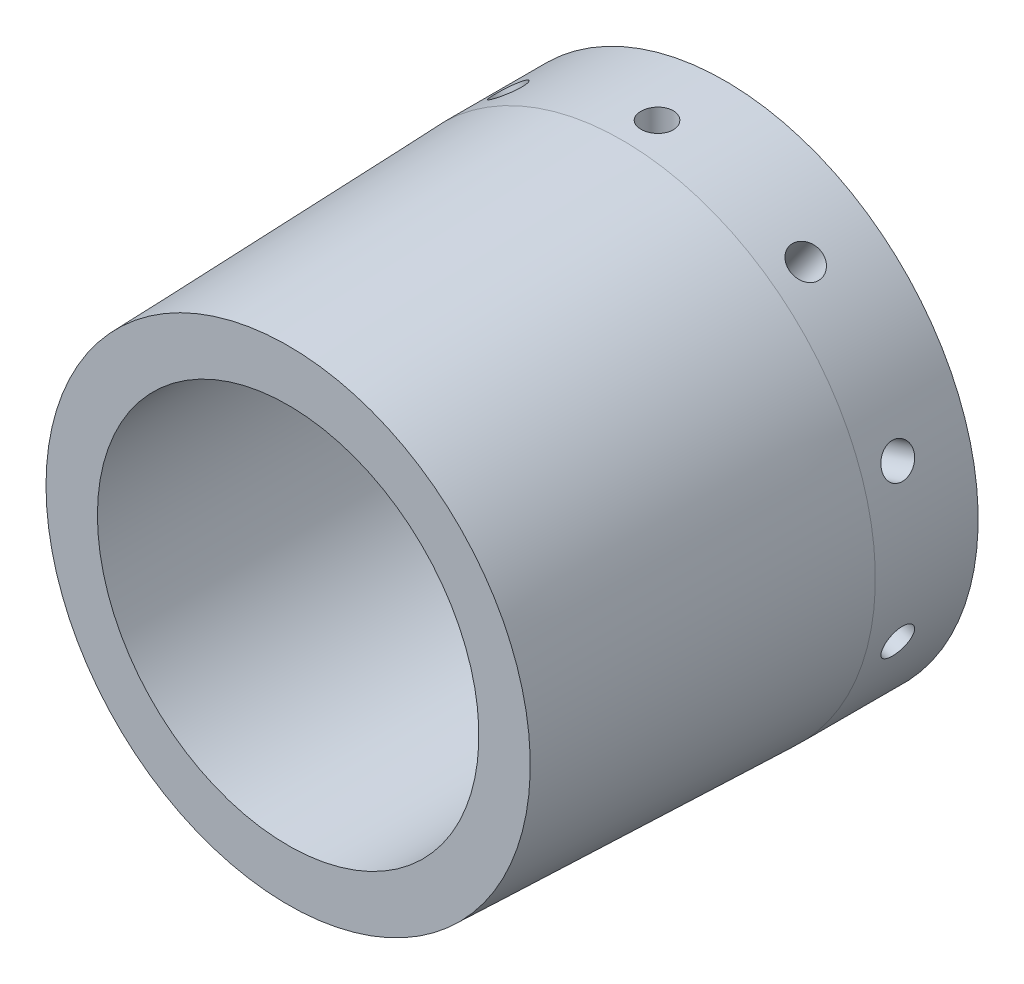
ISO-10303-21;
HEADER;
FILE_DESCRIPTION(('STEP AP214'),'2;1');
FILE_NAME('part.step','',(''),(''),'','','');
FILE_SCHEMA(('AUTOMOTIVE_DESIGN { 1 0 10303 214 1 1 1 1 }'));
ENDSEC;
DATA;
#1=APPLICATION_CONTEXT('core data for automotive mechanical design processes');
#2=APPLICATION_PROTOCOL_DEFINITION('international standard','automotive_design',2000,#1);
#3=PRODUCT_CONTEXT('',#1,'mechanical');
#4=PRODUCT('Part','Part','',(#3));
#5=PRODUCT_RELATED_PRODUCT_CATEGORY('part','',(#4));
#6=PRODUCT_DEFINITION_FORMATION('','',#4);
#7=PRODUCT_DEFINITION_CONTEXT('part definition',#1,'design');
#8=PRODUCT_DEFINITION('design','',#6,#7);
#9=PRODUCT_DEFINITION_SHAPE('','',#8);
#10=(LENGTH_UNIT() NAMED_UNIT(*) SI_UNIT(.MILLI.,.METRE.));
#11=(NAMED_UNIT(*) PLANE_ANGLE_UNIT() SI_UNIT($,.RADIAN.));
#12=(NAMED_UNIT(*) SI_UNIT($,.STERADIAN.) SOLID_ANGLE_UNIT());
#13=UNCERTAINTY_MEASURE_WITH_UNIT(LENGTH_MEASURE(1.E-05),#10,'distance_accuracy_value','');
#14=(GEOMETRIC_REPRESENTATION_CONTEXT(3) GLOBAL_UNCERTAINTY_ASSIGNED_CONTEXT((#13)) GLOBAL_UNIT_ASSIGNED_CONTEXT((#10,
#11,#12)) REPRESENTATION_CONTEXT('',''));
#15=CARTESIAN_POINT('',(0.,0.,0.));
#16=DIRECTION('',(0.,0.,1.));
#17=DIRECTION('',(1.,0.,0.));
#18=AXIS2_PLACEMENT_3D('',#15,#16,#17);
#19=CARTESIAN_POINT('',(28.5115,0.,0.));
#20=DIRECTION('',(0.,0.,-1.));
#21=DIRECTION('',(-1.,0.,0.));
#22=AXIS2_PLACEMENT_3D('',#19,#20,#21);
#23=CYLINDRICAL_SURFACE('',#22,28.5115);
#24=CARTESIAN_POINT('',(9.8608288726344,21.5652057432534,10.16));
#25=CARTESIAN_POINT('',(9.86083285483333,21.5652103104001,10.2952786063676));
#26=CARTESIAN_POINT('',(9.86948920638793,21.5727050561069,10.4306491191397));
#27=CARTESIAN_POINT('',(9.90394070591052,21.6024273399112,10.6976440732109));
#28=CARTESIAN_POINT('',(9.92975523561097,21.6246715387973,10.829264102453));
#29=CARTESIAN_POINT('',(9.99791168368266,21.6830505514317,11.0848524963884));
#30=CARTESIAN_POINT('',(10.0402441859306,21.7191774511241,11.2088251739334));
#31=CARTESIAN_POINT('',(10.1404330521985,21.8039862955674,11.4456687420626));
#32=CARTESIAN_POINT('',(10.1982861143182,21.852665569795,11.5585419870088));
#33=CARTESIAN_POINT('',(10.3283050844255,21.9609701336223,11.7703103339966));
#34=CARTESIAN_POINT('',(10.4005042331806,22.0206208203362,11.8691720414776));
#35=CARTESIAN_POINT('',(10.5573880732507,22.1487185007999,12.049824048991));
#36=CARTESIAN_POINT('',(10.6420733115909,22.2171658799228,12.1316136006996));
#37=CARTESIAN_POINT('',(10.8219586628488,22.3606573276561,12.2759110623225));
#38=CARTESIAN_POINT('',(10.9171742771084,22.4357110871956,12.3383900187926));
#39=CARTESIAN_POINT('',(11.1155565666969,22.5898771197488,12.4421075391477));
#40=CARTESIAN_POINT('',(11.2187230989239,22.6689893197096,12.4833464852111));
#41=CARTESIAN_POINT('',(11.4299801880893,22.8285958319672,12.543317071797));
#42=CARTESIAN_POINT('',(11.5380582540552,22.9090863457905,12.5621028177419));
#43=CARTESIAN_POINT('',(11.7563659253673,23.0692313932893,12.5768010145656));
#44=CARTESIAN_POINT('',(11.8665954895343,23.1488859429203,12.5727139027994));
#45=CARTESIAN_POINT('',(12.0857609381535,23.3049089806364,12.5418266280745));
#46=CARTESIAN_POINT('',(12.1946994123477,23.381285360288,12.5150846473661));
#47=CARTESIAN_POINT('',(12.4083761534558,23.5289590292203,12.439737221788));
#48=CARTESIAN_POINT('',(12.5131143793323,23.6002562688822,12.3911315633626));
#49=CARTESIAN_POINT('',(12.715380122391,23.7361139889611,12.2733717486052));
#50=CARTESIAN_POINT('',(12.8128983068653,23.8006657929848,12.2041915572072));
#51=CARTESIAN_POINT('',(12.9975925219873,23.9214653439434,12.0472653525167));
#52=CARTESIAN_POINT('',(13.0847683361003,23.9777129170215,11.959518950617));
#53=CARTESIAN_POINT('',(13.246307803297,24.080879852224,11.7676232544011));
#54=CARTESIAN_POINT('',(13.3206304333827,24.1277694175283,11.6634233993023));
#55=CARTESIAN_POINT('',(13.4537411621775,24.2110659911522,11.4417547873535));
#56=CARTESIAN_POINT('',(13.5125292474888,24.247472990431,11.3242860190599));
#57=CARTESIAN_POINT('',(13.6126468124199,24.3091192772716,11.0793782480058));
#58=CARTESIAN_POINT('',(13.6539740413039,24.3343571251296,10.9519379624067));
#59=CARTESIAN_POINT('',(13.717771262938,24.3731948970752,10.6907218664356));
#60=CARTESIAN_POINT('',(13.740241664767,24.3867950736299,10.5569461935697));
#61=CARTESIAN_POINT('',(13.76552196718,24.4020897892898,10.2873004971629));
#62=CARTESIAN_POINT('',(13.7683925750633,24.4038210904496,10.151438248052));
#63=CARTESIAN_POINT('',(13.7545366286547,24.3954448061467,9.8810861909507));
#64=CARTESIAN_POINT('',(13.7378102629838,24.3853373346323,9.74659636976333));
#65=CARTESIAN_POINT('',(13.6853680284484,24.3534878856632,9.48301009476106));
#66=CARTESIAN_POINT('',(13.6496804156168,24.33176321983,9.35390592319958));
#67=CARTESIAN_POINT('',(13.5605256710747,24.2770821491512,9.10451661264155));
#68=CARTESIAN_POINT('',(13.5070582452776,24.244125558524,8.98423161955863));
#69=CARTESIAN_POINT('',(13.3839445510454,24.1674977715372,8.75557158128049));
#70=CARTESIAN_POINT('',(13.3142589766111,24.1238005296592,8.64722642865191));
#71=CARTESIAN_POINT('',(13.1610240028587,24.0265838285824,8.44582378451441));
#72=CARTESIAN_POINT('',(13.0774743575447,23.9730641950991,8.35276656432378));
#73=CARTESIAN_POINT('',(12.8989130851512,23.8571603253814,8.18433976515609));
#74=CARTESIAN_POINT('',(12.8038726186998,23.79475371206,8.10901614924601));
#75=CARTESIAN_POINT('',(12.6054506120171,23.6625741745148,7.97851015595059));
#76=CARTESIAN_POINT('',(12.5020691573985,23.5928013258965,7.92332757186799));
#77=CARTESIAN_POINT('',(12.2902498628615,23.4476677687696,7.83474893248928));
#78=CARTESIAN_POINT('',(12.1818188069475,23.3723144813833,7.80132450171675));
#79=CARTESIAN_POINT('',(11.9630015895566,23.217897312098,7.7571182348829));
#80=CARTESIAN_POINT('',(11.8526154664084,23.1388335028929,7.74633595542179));
#81=CARTESIAN_POINT('',(11.6334335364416,22.9794432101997,7.74772530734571));
#82=CARTESIAN_POINT('',(11.524633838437,22.8991214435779,7.75982532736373));
#83=CARTESIAN_POINT('',(11.3113130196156,22.7393264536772,7.80648641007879));
#84=CARTESIAN_POINT('',(11.2067919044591,22.659853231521,7.84104750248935));
#85=CARTESIAN_POINT('',(11.0048509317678,22.5042026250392,7.93163134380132));
#86=CARTESIAN_POINT('',(10.9074306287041,22.4280250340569,7.98765274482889));
#87=CARTESIAN_POINT('',(10.7222077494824,22.281397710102,8.11955880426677));
#88=CARTESIAN_POINT('',(10.6344050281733,22.2109478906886,8.19544316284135));
#89=CARTESIAN_POINT('',(10.4703595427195,22.0779095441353,8.36518988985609));
#90=CARTESIAN_POINT('',(10.3941520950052,22.0153451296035,8.45910528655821));
#91=CARTESIAN_POINT('',(10.2554511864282,21.900466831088,8.66215152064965));
#92=CARTESIAN_POINT('',(10.1929610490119,21.8481554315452,8.77128603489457));
#93=CARTESIAN_POINT('',(10.0831046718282,21.7555754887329,9.00189085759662));
#94=CARTESIAN_POINT('',(10.0357677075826,21.7153302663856,9.12338445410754));
#95=CARTESIAN_POINT('',(9.95754469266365,21.6485344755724,9.37500692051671));
#96=CARTESIAN_POINT('',(9.92663975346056,21.6219681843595,9.50512568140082));
#97=CARTESIAN_POINT('',(9.88984663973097,21.5902755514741,9.72334161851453));
#98=CARTESIAN_POINT('',(9.87897714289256,21.5808900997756,9.81003590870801));
#99=CARTESIAN_POINT('',(9.86446697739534,21.5683537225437,9.98447390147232));
#100=CARTESIAN_POINT('',(9.86082628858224,21.5652027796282,10.0722176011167));
#101=CARTESIAN_POINT('',(9.8608288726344,21.5652057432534,10.16));
#102=B_SPLINE_CURVE_WITH_KNOTS('',3,(#24,#25,#26,#27,#28,#29,#30,#31,#32,#33,#34,#35,#36,#37,
#38,#39,#40,#41,#42,#43,#44,#45,#46,#47,#48,#49,#50,#51,#52,#53,#54,#55,#56,#57,#58,#59,#60,#61,
#62,#63,#64,#65,#66,#67,#68,#69,#70,#71,#72,#73,#74,#75,#76,#77,#78,#79,#80,#81,#82,#83,#84,#85,
#86,#87,#88,#89,#90,#91,#92,#93,#94,#95,#96,#97,#98,#99,#100,#101),.UNSPECIFIED.,.T.,.F.,(4,2,2,
2,2,2,2,2,2,2,2,2,2,2,2,2,2,2,2,2,2,2,2,2,2,2,2,2,2,2,2,2,2,2,2,2,2,2,4),(0.,0.40551530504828,
0.811489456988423,1.21723251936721,1.62288933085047,2.02949727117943,2.4361230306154,
2.84335554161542,3.25058072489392,3.65682262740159,4.06305676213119,4.46825075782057,
4.87344871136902,5.27916160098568,5.68488298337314,6.09187630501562,6.49886997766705,
6.90591609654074,7.31295338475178,7.71872936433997,8.12450143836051,8.52967052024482,
8.93484630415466,9.34101448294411,9.74718986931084,10.1544066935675,10.5616193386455,
10.9682998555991,11.3749724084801,11.7803743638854,12.1857768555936,12.5911538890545,
12.9965248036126,13.4031066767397,13.80978694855,14.2172482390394,14.6242401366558,
14.8873800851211,15.1505192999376),.UNSPECIFIED.);
#103=CARTESIAN_POINT('',(9.8608288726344,21.5652057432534,10.16));
#104=VERTEX_POINT('',#103);
#105=EDGE_CURVE('E102',#104,#104,#102,.T.);
#106=ORIENTED_EDGE('',*,*,#105,.T.);
#107=EDGE_LOOP('',(#106));
#108=FACE_BOUND('',#107,.T.);
#109=CARTESIAN_POINT('',(0.747080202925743,6.48402849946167,10.16));
#110=CARTESIAN_POINT('',(0.74708074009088,6.48403453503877,10.2952786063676));
#111=CARTESIAN_POINT('',(0.749678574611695,6.49518598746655,10.4306491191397));
#112=CARTESIAN_POINT('',(0.760080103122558,6.53948190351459,10.6976440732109));
#113=CARTESIAN_POINT('',(0.767889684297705,6.5726512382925,10.829264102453));
#114=CARTESIAN_POINT('',(0.788715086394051,6.65994220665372,11.0848524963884));
#115=CARTESIAN_POINT('',(0.801727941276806,6.71405190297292,11.2088251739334));
#116=CARTESIAN_POINT('',(0.832933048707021,6.841553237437,11.4456687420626));
#117=CARTESIAN_POINT('',(0.851124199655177,6.91494077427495,11.5585419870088));
#118=CARTESIAN_POINT('',(0.892651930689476,7.0789842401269,11.7703103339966));
#119=CARTESIAN_POINT('',(0.916000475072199,7.16968025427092,11.8691720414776));
#120=CARTESIAN_POINT('',(0.967628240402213,7.36552746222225,12.049824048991));
#121=CARTESIAN_POINT('',(0.995907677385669,7.47067928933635,12.1316136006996));
#122=CARTESIAN_POINT('',(1.05709582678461,7.6925002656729,12.2759110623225));
#123=CARTESIAN_POINT('',(1.09001138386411,7.80918636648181,12.3383900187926));
#124=CARTESIAN_POINT('',(1.15988950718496,8.05051549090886,12.4421075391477));
#125=CARTESIAN_POINT('',(1.19685200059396,8.17515837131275,12.4833464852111));
#126=CARTESIAN_POINT('',(1.27394822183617,8.42845655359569,12.543317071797));
#127=CARTESIAN_POINT('',(1.31407407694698,8.55710144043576,12.5621028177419));
#128=CARTESIAN_POINT('',(1.39655779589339,8.81497953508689,12.5768010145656));
#129=CARTESIAN_POINT('',(1.43891561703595,8.94421273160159,12.5727139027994));
#130=CARTESIAN_POINT('',(1.52451614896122,9.19926023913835,12.5418266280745));
#131=CARTESIAN_POINT('',(1.56775631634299,9.32508245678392,12.5150846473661));
#132=CARTESIAN_POINT('',(1.65382402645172,9.57014900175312,12.439737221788));
#133=CARTESIAN_POINT('',(1.69665156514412,9.68939326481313,12.3911315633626));
#134=CARTESIAN_POINT('',(1.78043282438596,9.91819328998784,12.2733717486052));
#135=CARTESIAN_POINT('',(1.82138409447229,10.0277365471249,12.2041915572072));
#136=CARTESIAN_POINT('',(1.89980065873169,10.2340259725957,12.0472653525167));
#137=CARTESIAN_POINT('',(1.93726587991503,10.3307718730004,11.959518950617));
#138=CARTESIAN_POINT('',(2.00731405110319,10.5091861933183,11.7676232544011));
#139=CARTESIAN_POINT('',(2.03988132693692,10.5908063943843,11.6634233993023));
#140=CARTESIAN_POINT('',(2.09860967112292,10.7364352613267,11.4417547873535));
#141=CARTESIAN_POINT('',(2.12477073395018,10.8004439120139,11.3242860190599));
#142=CARTESIAN_POINT('',(2.16953276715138,10.90916443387,11.0793782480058));
#143=CARTESIAN_POINT('',(2.18813276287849,10.9538738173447,10.9519379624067));
#144=CARTESIAN_POINT('',(2.21691752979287,11.0227933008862,10.6907218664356));
#145=CARTESIAN_POINT('',(2.22710248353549,11.0470038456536,10.5569461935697));
#146=CARTESIAN_POINT('',(2.23856466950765,11.0742369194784,10.2873004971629));
#147=CARTESIAN_POINT('',(2.23986940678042,11.077324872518,10.151438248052));
#148=CARTESIAN_POINT('',(2.23358316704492,11.0624039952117,9.8810861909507));
#149=CARTESIAN_POINT('',(2.22599227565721,11.0443953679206,9.74659636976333));
#150=CARTESIAN_POINT('',(2.20228625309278,10.9878038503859,9.48301009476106));
#151=CARTESIAN_POINT('',(2.18618380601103,10.9492515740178,9.35390592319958));
#152=CARTESIAN_POINT('',(2.14619682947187,10.8526098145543,9.10451661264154));
#153=CARTESIAN_POINT('',(2.12231217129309,10.7945200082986,8.98423161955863));
#154=CARTESIAN_POINT('',(2.06775178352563,10.6601624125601,8.75557158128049));
#155=CARTESIAN_POINT('',(2.03705956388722,10.5838504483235,8.64722642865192));
#156=CARTESIAN_POINT('',(1.97023240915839,10.4151312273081,8.44582378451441));
#157=CARTESIAN_POINT('',(1.934097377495,10.3227236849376,8.35276656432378));
#158=CARTESIAN_POINT('',(1.85776485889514,10.1239998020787,8.18433976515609));
#159=CARTESIAN_POINT('',(1.81755719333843,10.0176484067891,8.10901614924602));
#160=CARTESIAN_POINT('',(1.73472360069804,9.79408338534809,7.9785101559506));
#161=CARTESIAN_POINT('',(1.6920976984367,9.67686987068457,7.923327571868));
#162=CARTESIAN_POINT('',(1.60603965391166,9.43495009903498,7.83474893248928));
#163=CARTESIAN_POINT('',(1.56260863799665,9.3102538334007,7.80132450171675));
#164=CARTESIAN_POINT('',(1.47634592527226,9.05671018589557,7.7571182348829));
#165=CARTESIAN_POINT('',(1.433514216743,8.92786288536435,7.74633595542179));
#166=CARTESIAN_POINT('',(1.34987957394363,8.6700815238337,7.74772530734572));
#167=CARTESIAN_POINT('',(1.3090707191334,8.54114899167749,7.75982532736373));
#168=CARTESIAN_POINT('',(1.23041568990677,8.28648529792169,7.80648641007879));
#169=CARTESIAN_POINT('',(1.19256951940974,8.16075414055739,7.84104750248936));
#170=CARTESIAN_POINT('',(1.12068497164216,7.9161322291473,7.93163134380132));
#171=CARTESIAN_POINT('',(1.0866463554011,7.79724104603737,7.98765274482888));
#172=CARTESIAN_POINT('',(1.02298327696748,7.56974577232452,8.11955880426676));
#173=CARTESIAN_POINT('',(0.993358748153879,7.46114152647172,8.19544316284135));
#174=CARTESIAN_POINT('',(0.938841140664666,7.25708772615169,8.36518988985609));
#175=CARTESIAN_POINT('',(0.913962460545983,7.16167843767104,8.45910528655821));
#176=CARTESIAN_POINT('',(0.869274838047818,6.98721359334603,8.66215152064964));
#177=CARTESIAN_POINT('',(0.849467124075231,6.90816200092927,8.77128603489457));
#178=CARTESIAN_POINT('',(0.815008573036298,6.76869129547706,9.00189085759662));
#179=CARTESIAN_POINT('',(0.800367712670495,6.70830825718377,9.12338445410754));
#180=CARTESIAN_POINT('',(0.776345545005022,6.60829099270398,9.37500692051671));
#181=CARTESIAN_POINT('',(0.76695819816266,6.56863294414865,9.50512568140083));
#182=CARTESIAN_POINT('',(0.755820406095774,6.52136661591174,9.72334161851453));
#183=CARTESIAN_POINT('',(0.752543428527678,6.50738469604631,9.81003590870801));
#184=CARTESIAN_POINT('',(0.748173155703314,6.48871369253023,9.98447390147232));
#185=CARTESIAN_POINT('',(0.747079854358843,6.48402458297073,10.0722176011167));
#186=CARTESIAN_POINT('',(0.747080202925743,6.48402849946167,10.16));
#187=B_SPLINE_CURVE_WITH_KNOTS('',3,(#109,#110,#111,#112,#113,#114,#115,#116,#117,#118,#119,
#120,#121,#122,#123,#124,#125,#126,#127,#128,#129,#130,#131,#132,#133,#134,#135,#136,#137,#138,
#139,#140,#141,#142,#143,#144,#145,#146,#147,#148,#149,#150,#151,#152,#153,#154,#155,#156,#157,
#158,#159,#160,#161,#162,#163,#164,#165,#166,#167,#168,#169,#170,#171,#172,#173,#174,#175,#176,
#177,#178,#179,#180,#181,#182,#183,#184,#185,#186),.UNSPECIFIED.,.T.,.F.,(4,2,2,2,2,2,2,2,2,2,2,
2,2,2,2,2,2,2,2,2,2,2,2,2,2,2,2,2,2,2,2,2,2,2,2,2,2,2,4),(0.,0.40551530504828,0.811489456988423,
1.21723251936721,1.62288933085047,2.02949727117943,2.4361230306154,2.84335554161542,
3.25058072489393,3.6568226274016,4.06305676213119,4.46825075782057,4.87344871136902,
5.27916160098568,5.68488298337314,6.09187630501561,6.49886997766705,6.90591609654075,
7.31295338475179,7.71872936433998,8.12450143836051,8.52967052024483,8.93484630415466,
9.34101448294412,9.74718986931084,10.1544066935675,10.5616193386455,10.9682998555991,
11.3749724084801,11.7803743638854,12.1857768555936,12.5911538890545,12.9965248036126,
13.4031066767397,13.80978694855,14.2172482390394,14.6242401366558,14.8873800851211,
15.1505192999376),.UNSPECIFIED.);
#188=CARTESIAN_POINT('',(0.747080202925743,6.48402849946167,10.16));
#189=VERTEX_POINT('',#188);
#190=EDGE_CURVE('E93',#189,#189,#187,.T.);
#191=ORIENTED_EDGE('',*,*,#190,.T.);
#192=EDGE_LOOP('',(#191));
#193=FACE_BOUND('',#192,.T.);
#194=CARTESIAN_POINT('',(2.23839621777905,-11.0738272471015,10.16));
#195=CARTESIAN_POINT('',(2.23839310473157,-11.0738220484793,10.2952786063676));
#196=CARTESIAN_POINT('',(2.2339401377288,-11.063273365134,10.4306491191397));
#197=CARTESIAN_POINT('',(2.21631866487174,-11.0213233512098,10.6976440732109));
#198=CARTESIAN_POINT('',(2.20314030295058,-10.989898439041,10.829264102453));
#199=CARTESIAN_POINT('',(2.16868006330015,-10.907037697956,11.0848524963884));
#200=CARTESIAN_POINT('',(2.14740280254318,-10.855613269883,11.2088251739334));
#201=CARTESIAN_POINT('',(2.09770486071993,-10.7341206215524,11.4456687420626));
#202=CARTESIAN_POINT('',(2.06928569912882,-10.6640563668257,11.5585419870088));
#203=CARTESIAN_POINT('',(2.00646000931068,-10.5069330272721,11.7703103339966));
#204=CARTESIAN_POINT('',(1.97203959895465,-10.4198344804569,11.8691720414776));
#205=CARTESIAN_POINT('',(1.89869123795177,-10.2310447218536,12.0498240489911));
#206=CARTESIAN_POINT('',(1.85976308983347,-10.1293528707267,12.1316136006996));
#207=CARTESIAN_POINT('',(1.77888224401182,-9.91393043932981,12.2759110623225));
#208=CARTESIAN_POINT('',(1.73692511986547,-9.80018212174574,12.3383900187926));
#209=CARTESIAN_POINT('',(1.6516080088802,-9.56386942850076,12.4421075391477));
#210=CARTESIAN_POINT('',(1.60824804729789,-9.4413052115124,12.4833464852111));
#211=CARTESIAN_POINT('',(1.52173526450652,-9.19106665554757,12.543317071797));
#212=CARTESIAN_POINT('',(1.47858219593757,-9.06340536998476,12.5621028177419));
#213=CARTESIAN_POINT('',(1.39373598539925,-8.80629489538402,12.5768010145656));
#214=CARTESIAN_POINT('',(1.35204281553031,-8.67684574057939,12.5727139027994));
#215=CARTESIAN_POINT('',(1.27138193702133,-8.42019324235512,12.5418266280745));
#216=CARTESIAN_POINT('',(1.23240752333,-8.29298499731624,12.5150846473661));
#217=CARTESIAN_POINT('',(1.15799126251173,-8.04413266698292,12.439737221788));
#218=CARTESIAN_POINT('',(1.12254944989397,-7.92248863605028,12.3911315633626));
#219=CARTESIAN_POINT('',(1.05584463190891,-7.68814013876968,12.2733717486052));
#220=CARTESIAN_POINT('',(1.02458699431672,-7.57544722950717,12.2041915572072));
#221=CARTESIAN_POINT('',(0.966773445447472,-7.36246347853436,12.0472653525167));
#222=CARTESIAN_POINT('',(0.940217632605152,-7.26217289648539,11.959518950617));
#223=CARTESIAN_POINT('',(0.892018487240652,-7.07665939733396,11.7676232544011));
#224=CARTESIAN_POINT('',(0.870390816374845,-6.99148470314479,11.6634233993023));
#225=CARTESIAN_POINT('',(0.832304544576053,-6.83914882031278,11.4417547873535));
#226=CARTESIAN_POINT('',(0.815845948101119,-6.77198764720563,11.3242860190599));
#227=CARTESIAN_POINT('',(0.788154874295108,-6.65772043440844,11.0793782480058));
#228=CARTESIAN_POINT('',(0.776923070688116,-6.61061698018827,10.9519379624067));
#229=CARTESIAN_POINT('',(0.759700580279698,-6.53794068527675,10.6907218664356));
#230=CARTESIAN_POINT('',(0.753709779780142,-6.51236737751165,10.5569461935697));
#231=CARTESIAN_POINT('',(0.746975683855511,-6.48359805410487,10.2873004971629));
#232=CARTESIAN_POINT('',(0.746216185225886,-6.48033294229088,10.151438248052));
#233=CARTESIAN_POINT('',(0.749900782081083,-6.49609914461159,9.8810861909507));
#234=CARTESIAN_POINT('',(0.754344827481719,-6.51513024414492,9.74659636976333));
#235=CARTESIAN_POINT('',(0.768429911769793,-6.57484779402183,9.48301009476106));
#236=CARTESIAN_POINT('',(0.778063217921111,-6.61550202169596,9.35390592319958));
#237=CARTESIAN_POINT('',(0.802517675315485,-6.71719060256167,9.10451661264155));
#238=CARTESIAN_POINT('',(0.817338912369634,-6.77822529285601,8.98423161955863));
#239=CARTESIAN_POINT('',(0.852172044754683,-6.91899266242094,8.7555715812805));
#240=CARTESIAN_POINT('',(0.87219656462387,-6.99877077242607,8.64722642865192));
#241=CARTESIAN_POINT('',(0.917302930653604,-7.17454750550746,8.44582378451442));
#242=CARTESIAN_POINT('',(0.942384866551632,-7.27054641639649,8.35276656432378));
#243=CARTESIAN_POINT('',(0.997437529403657,-7.47618454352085,8.1843397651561));
#244=CARTESIAN_POINT('',(1.02742062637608,-7.58585810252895,8.10901614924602));
#245=CARTESIAN_POINT('',(1.09181506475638,-7.81541436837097,7.9785101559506));
#246=CARTESIAN_POINT('',(1.12622636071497,-7.93529697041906,7.923327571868));
#247=CARTESIAN_POINT('',(1.19880081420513,-8.18159782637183,7.83474893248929));
#248=CARTESIAN_POINT('',(1.23695901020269,-8.30800733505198,7.80132450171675));
#249=CARTESIAN_POINT('',(1.31620022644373,-8.56383240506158,7.7571182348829));
#250=CARTESIAN_POINT('',(1.35728318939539,-8.69324790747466,7.7463359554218));
#251=CARTESIAN_POINT('',(1.44114142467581,-8.95095661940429,7.74772530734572));
#252=CARTESIAN_POINT('',(1.4839110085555,-9.07925207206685,7.75982532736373));
#253=CARTESIAN_POINT('',(1.56996531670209,-9.33151159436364,7.8064864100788));
#254=CARTESIAN_POINT('',(1.61325004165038,-9.45547565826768,7.84104750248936));
#255=CARTESIAN_POINT('',(1.69887937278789,-9.69563161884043,7.93163134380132));
#256=CARTESIAN_POINT('',(1.74122403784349,-9.81182400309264,7.98765274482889));
#257=CARTESIAN_POINT('',(1.82343789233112,-10.0332917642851,8.11955880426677));
#258=CARTESIAN_POINT('',(1.8633071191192,-10.1385673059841,8.19544316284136));
#259=CARTESIAN_POINT('',(1.9391412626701,-10.3356949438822,8.3651898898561));
#260=CARTESIAN_POINT('',(1.97509416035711,-10.4275060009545,8.45910528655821));
#261=CARTESIAN_POINT('',(2.04148897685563,-10.5949177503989,8.66215152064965));
#262=CARTESIAN_POINT('',(2.0719295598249,-10.6705145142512,8.77128603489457));
#263=CARTESIAN_POINT('',(2.1260308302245,-10.8036029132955,9.00189085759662));
#264=CARTESIAN_POINT('',(2.1496783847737,-10.8610594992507,9.12338445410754));
#265=CARTESIAN_POINT('',(2.18903271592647,-10.9560950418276,9.37500692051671));
#266=CARTESIAN_POINT('',(2.20474860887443,-10.9936968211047,9.50512568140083));
#267=CARTESIAN_POINT('',(2.22352039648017,-11.0384827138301,9.72334161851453));
#268=CARTESIAN_POINT('',(2.22908763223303,-11.0517204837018,9.81003590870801));
#269=CARTESIAN_POINT('',(2.23652654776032,-11.069394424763,9.98447390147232));
#270=CARTESIAN_POINT('',(2.23839823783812,-11.0738306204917,10.0722176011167));
#271=CARTESIAN_POINT('',(2.23839621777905,-11.0738272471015,10.16));
#272=B_SPLINE_CURVE_WITH_KNOTS('',3,(#194,#195,#196,#197,#198,#199,#200,#201,#202,#203,#204,
#205,#206,#207,#208,#209,#210,#211,#212,#213,#214,#215,#216,#217,#218,#219,#220,#221,#222,#223,
#224,#225,#226,#227,#228,#229,#230,#231,#232,#233,#234,#235,#236,#237,#238,#239,#240,#241,#242,
#243,#244,#245,#246,#247,#248,#249,#250,#251,#252,#253,#254,#255,#256,#257,#258,#259,#260,#261,
#262,#263,#264,#265,#266,#267,#268,#269,#270,#271),.UNSPECIFIED.,.T.,.F.,(4,2,2,2,2,2,2,2,2,2,2,
2,2,2,2,2,2,2,2,2,2,2,2,2,2,2,2,2,2,2,2,2,2,2,2,2,2,2,4),(0.,0.405515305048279,
0.811489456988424,1.21723251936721,1.62288933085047,2.02949727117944,2.4361230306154,
2.84335554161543,3.25058072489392,3.65682262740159,4.06305676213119,4.46825075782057,
4.87344871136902,5.27916160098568,5.68488298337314,6.09187630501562,6.49886997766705,
6.90591609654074,7.31295338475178,7.71872936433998,8.12450143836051,8.52967052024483,
8.93484630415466,9.34101448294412,9.74718986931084,10.1544066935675,10.5616193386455,
10.9682998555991,11.3749724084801,11.7803743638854,12.1857768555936,12.5911538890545,
12.9965248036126,13.4031066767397,13.80978694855,14.2172482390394,14.6242401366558,
14.8873800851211,15.1505192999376),.UNSPECIFIED.);
#273=CARTESIAN_POINT('',(2.23839621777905,-11.0738272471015,10.16));
#274=VERTEX_POINT('',#273);
#275=EDGE_CURVE('E101',#274,#274,#272,.T.);
#276=ORIENTED_EDGE('',*,*,#275,.T.);
#277=EDGE_LOOP('',(#276));
#278=FACE_BOUND('',#277,.T.);
#279=CARTESIAN_POINT('',(13.7651448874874,-24.4018573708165,10.16));
#280=CARTESIAN_POINT('',(13.7651393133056,-24.4018549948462,10.2952786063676));
#281=CARTESIAN_POINT('',(13.7553364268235,-24.3959383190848,10.4306491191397));
#282=CARTESIAN_POINT('',(13.7164227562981,-24.3723576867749,10.6976440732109));
#283=CARTESIAN_POINT('',(13.6872901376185,-24.3546804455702,10.829264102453));
#284=CARTESIAN_POINT('',(13.6107068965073,-24.307899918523,11.0848524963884));
#285=CARTESIAN_POINT('',(13.5632667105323,-24.278803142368,11.2088251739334));
#286=CARTESIAN_POINT('',(13.4516486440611,-24.2097252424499,11.4456687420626));
#287=CARTESIAN_POINT('',(13.3874743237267,-24.1697464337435,11.5585419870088));
#288=CARTESIAN_POINT('',(13.2442924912,-24.079558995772,11.7703103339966));
#289=CARTESIAN_POINT('',(13.1652505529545,-24.0293266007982,11.8691720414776));
#290=CARTESIAN_POINT('',(12.9949426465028,-23.9197055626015,12.049824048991));
#291=CARTESIAN_POINT('',(12.9036761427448,-23.8603165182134,12.1316136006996));
#292=CARTESIAN_POINT('',(12.7116200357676,-23.7335766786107,12.2759110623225));
#293=CARTESIAN_POINT('',(12.6108164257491,-23.6662141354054,12.3383900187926));
#294=CARTESIAN_POINT('',(12.4028923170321,-23.5251812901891,12.4421075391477));
#295=CARTESIAN_POINT('',(12.2957719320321,-23.4515111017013,12.4833464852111));
#296=CARTESIAN_POINT('',(12.0786950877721,-23.2999147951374,12.543317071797));
#297=CARTESIAN_POINT('',(11.9687461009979,-23.2219993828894,12.5621028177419));
#298=CARTESIAN_POINT('',(11.7489783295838,-23.0638639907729,12.5768010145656));
#299=CARTESIAN_POINT('',(11.6391595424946,-22.9836440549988,12.5727139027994));
#300=CARTESIAN_POINT('',(11.4230469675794,-22.8234190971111,12.5418266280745));
#301=CARTESIAN_POINT('',(11.3167448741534,-22.7434140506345,12.5150846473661));
#302=CARTESIAN_POINT('',(11.1102691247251,-22.5858290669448,12.439737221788));
#303=CARTESIAN_POINT('',(11.0100955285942,-22.5082491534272,12.3911315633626));
#304=CARTESIAN_POINT('',(10.8183836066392,-22.3578653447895,12.2733717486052));
#305=CARTESIAN_POINT('',(10.7268564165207,-22.2850676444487,12.2041915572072));
#306=CARTESIAN_POINT('',(10.5548955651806,-22.146742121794,12.0472653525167));
#307=CARTESIAN_POINT('',(10.4744621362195,-22.081214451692,11.959518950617));
#308=CARTESIAN_POINT('',(10.3264261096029,-21.9594616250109,11.7676232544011));
#309=CARTESIAN_POINT('',(10.2588645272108,-21.9032662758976,11.6634233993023));
#310=CARTESIAN_POINT('',(10.1385113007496,-21.8024105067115,11.4417547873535));
#311=CARTESIAN_POINT('',(10.0857196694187,-21.757750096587,11.3242860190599));
#312=CARTESIAN_POINT('',(9.99615253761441,-21.6815823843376,11.0793782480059));
#313=CARTESIAN_POINT('',(9.95937910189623,-21.6500767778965,10.9519379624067));
#314=CARTESIAN_POINT('',(9.90272776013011,-21.6014035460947,10.6907218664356));
#315=CARTESIAN_POINT('',(9.88284948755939,-21.5842356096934,10.5569461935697));
#316=CARTESIAN_POINT('',(9.86049130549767,-21.5649189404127,10.2873004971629));
#317=CARTESIAN_POINT('',(9.85795767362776,-21.5627238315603,10.151438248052));
#318=CARTESIAN_POINT('',(9.8702057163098,-21.5733132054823,9.88108619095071));
#319=CARTESIAN_POINT('',(9.8849872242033,-21.5860975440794,9.74659636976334));
#320=CARTESIAN_POINT('',(9.93148339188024,-21.6261310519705,9.48301009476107));
#321=CARTESIAN_POINT('',(9.96317285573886,-21.6533586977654,9.35390592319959));
#322=CARTESIAN_POINT('',(10.0427279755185,-21.7212525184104,9.10451661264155));
#323=CARTESIAN_POINT('',(10.0905938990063,-21.7619189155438,8.98423161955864));
#324=CARTESIAN_POINT('',(10.2015154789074,-21.8553277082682,8.75557158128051));
#325=CARTESIAN_POINT('',(10.2646080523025,-21.9080994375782,8.64722642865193));
#326=CARTESIAN_POINT('',(10.4044188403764,-22.0237929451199,8.44582378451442));
#327=CARTESIAN_POINT('',(10.4811372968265,-22.0867149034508,8.35276656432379));
#328=CARTESIAN_POINT('',(10.6465468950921,-22.220720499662,8.18433976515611));
#329=CARTESIAN_POINT('',(10.7352682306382,-22.2918246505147,8.10901614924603));
#330=CARTESIAN_POINT('',(10.9222942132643,-22.4396894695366,7.97851015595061));
#331=CARTESIAN_POINT('',(11.0205987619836,-22.5164500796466,7.923327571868));
#332=CARTESIAN_POINT('',(11.2240847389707,-22.6730534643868,7.83474893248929));
#333=CARTESIAN_POINT('',(11.3292570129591,-22.7528920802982,7.80132450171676));
#334=CARTESIAN_POINT('',(11.5437347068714,-22.9132820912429,7.75711823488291));
#335=CARTESIAN_POINT('',(11.653040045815,-22.9938334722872,7.7463359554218));
#336=CARTESIAN_POINT('',(11.8723601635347,-23.1530335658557,7.74772530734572));
#337=CARTESIAN_POINT('',(11.9823716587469,-23.2316874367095,7.75982532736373));
#338=CARTESIAN_POINT('',(12.2002654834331,-23.3851882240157,7.8064864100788));
#339=CARTESIAN_POINT('',(12.3081478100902,-23.4600351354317,7.84104750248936));
#340=CARTESIAN_POINT('',(12.5185835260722,-23.6039937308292,7.93163134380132));
#341=CARTESIAN_POINT('',(12.6211372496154,-23.6731057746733,7.98765274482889));
#342=CARTESIAN_POINT('',(12.8178251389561,-23.8039528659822,8.11955880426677));
#343=CARTESIAN_POINT('',(12.911959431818,-23.8656880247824,8.19544316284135));
#344=CARTESIAN_POINT('',(13.0891792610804,-23.9805934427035,8.36518988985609));
#345=CARTESIAN_POINT('',(13.1722309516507,-24.0337375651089,8.4591052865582));
#346=CARTESIAN_POINT('',(13.3243476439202,-24.130150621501,8.66215152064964));
#347=CARTESIAN_POINT('',(13.3934092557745,-24.1734171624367,8.77128603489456));
#348=CARTESIAN_POINT('',(13.5154055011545,-24.2492880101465,9.00189085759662));
#349=CARTESIAN_POINT('',(13.5683089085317,-24.2818716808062,9.12338445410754));
#350=CARTESIAN_POINT('',(13.6560077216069,-24.3356251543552,9.37500692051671));
#351=CARTESIAN_POINT('',(13.6908239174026,-24.3568080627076,9.50512568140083));
#352=CARTESIAN_POINT('',(13.7323350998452,-24.3820068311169,9.72334161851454));
#353=CARTESIAN_POINT('',(13.7446200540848,-24.3894440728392,9.81003590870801));
#354=CARTESIAN_POINT('',(13.7610267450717,-24.3993701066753,9.98447390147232));
#355=CARTESIAN_POINT('',(13.7651485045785,-24.4018589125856,10.0722176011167));
#356=CARTESIAN_POINT('',(13.7651448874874,-24.4018573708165,10.16));
#357=B_SPLINE_CURVE_WITH_KNOTS('',3,(#279,#280,#281,#282,#283,#284,#285,#286,#287,#288,#289,
#290,#291,#292,#293,#294,#295,#296,#297,#298,#299,#300,#301,#302,#303,#304,#305,#306,#307,#308,
#309,#310,#311,#312,#313,#314,#315,#316,#317,#318,#319,#320,#321,#322,#323,#324,#325,#326,#327,
#328,#329,#330,#331,#332,#333,#334,#335,#336,#337,#338,#339,#340,#341,#342,#343,#344,#345,#346,
#347,#348,#349,#350,#351,#352,#353,#354,#355,#356),.UNSPECIFIED.,.T.,.F.,(4,2,2,2,2,2,2,2,2,2,2,
2,2,2,2,2,2,2,2,2,2,2,2,2,2,2,2,2,2,2,2,2,2,2,2,2,2,2,4),(0.,0.40551530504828,0.811489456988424,
1.21723251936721,1.62288933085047,2.02949727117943,2.43612303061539,2.84335554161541,
3.25058072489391,3.65682262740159,4.06305676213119,4.46825075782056,4.87344871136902,
5.27916160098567,5.68488298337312,6.0918763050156,6.49886997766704,6.90591609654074,
7.31295338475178,7.71872936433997,8.1245014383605,8.52967052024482,8.93484630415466,
9.34101448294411,9.74718986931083,10.1544066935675,10.5616193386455,10.9682998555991,
11.3749724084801,11.7803743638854,12.1857768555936,12.5911538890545,12.9965248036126,
13.4031066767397,13.80978694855,14.2172482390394,14.6242401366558,14.8873800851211,
15.1505192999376),.UNSPECIFIED.);
#358=CARTESIAN_POINT('',(13.7651448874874,-24.4018573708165,10.16));
#359=VERTEX_POINT('',#358);
#360=EDGE_CURVE('E235',#359,#359,#357,.T.);
#361=ORIENTED_EDGE('',*,*,#360,.T.);
#362=EDGE_LOOP('',(#361));
#363=FACE_BOUND('',#362,.T.);
#364=CARTESIAN_POINT('',(28.5115,-28.5115,7.74700000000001));
#365=CARTESIAN_POINT('',(28.6467795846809,-28.5114986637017,7.7470059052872));
#366=CARTESIAN_POINT('',(28.7821510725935,-28.5105269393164,7.75841450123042));
#367=CARTESIAN_POINT('',(29.0491480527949,-28.5067439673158,7.80375736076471));
#368=CARTESIAN_POINT('',(29.1807691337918,-28.5039306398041,7.83771709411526));
#369=CARTESIAN_POINT('',(29.4363597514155,-28.4967823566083,7.9271726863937));
#370=CARTESIAN_POINT('',(29.5603335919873,-28.4924482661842,7.98265630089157));
#371=CARTESIAN_POINT('',(29.7971791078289,-28.4827444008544,8.11356263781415));
#372=CARTESIAN_POINT('',(29.910053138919,-28.4773748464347,8.18898111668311));
#373=CARTESIAN_POINT('',(30.1218205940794,-28.4661867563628,8.35782991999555));
#374=CARTESIAN_POINT('',(30.2206808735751,-28.4603672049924,8.45130175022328));
#375=CARTESIAN_POINT('',(30.4013301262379,-28.4489435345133,8.6535161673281));
#376=CARTESIAN_POINT('',(30.4831183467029,-28.4433394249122,8.76225942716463));
#377=CARTESIAN_POINT('',(30.6274144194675,-28.4329702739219,8.99213110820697));
#378=CARTESIAN_POINT('',(30.6898930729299,-28.4282065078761,9.11327792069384));
#379=CARTESIAN_POINT('',(30.7936099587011,-28.4200691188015,9.36438967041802));
#380=CARTESIAN_POINT('',(30.8348485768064,-28.4166954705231,9.49435444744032));
#381=CARTESIAN_POINT('',(30.8948184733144,-28.4117288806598,9.75908032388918));
#382=CARTESIAN_POINT('',(30.9136038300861,-28.4101316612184,9.89382909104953));
#383=CARTESIAN_POINT('',(30.9283010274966,-28.4088852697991,10.1645758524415));
#384=CARTESIAN_POINT('',(30.9242133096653,-28.4092360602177,10.3005738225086));
#385=CARTESIAN_POINT('',(30.8933250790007,-28.4118421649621,10.5695877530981));
#386=CARTESIAN_POINT('',(30.8665833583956,-28.4140925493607,10.7026105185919));
#387=CARTESIAN_POINT('',(30.791237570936,-28.4202365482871,10.9622727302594));
#388=CARTESIAN_POINT('',(30.7426332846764,-28.4241301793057,11.0889121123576));
#389=CARTESIAN_POINT('',(30.6248763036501,-28.4331276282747,11.3323999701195));
#390=CARTESIAN_POINT('',(30.5556972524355,-28.4382329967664,11.4492356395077));
#391=CARTESIAN_POINT('',(30.3987734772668,-28.4490772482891,11.6696594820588));
#392=CARTESIAN_POINT('',(30.3110283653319,-28.454816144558,11.7732473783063));
#393=CARTESIAN_POINT('',(30.1191335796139,-28.4663027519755,11.9645770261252));
#394=CARTESIAN_POINT('',(30.014933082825,-28.4720504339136,12.0522678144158));
#395=CARTESIAN_POINT('',(29.7932626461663,-28.4828897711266,12.2089199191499));
#396=CARTESIAN_POINT('',(29.6757926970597,-28.487981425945,12.2778812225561));
#397=CARTESIAN_POINT('',(29.4308846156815,-28.4969360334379,12.3951137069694));
#398=CARTESIAN_POINT('',(29.3034453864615,-28.5007988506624,12.4433826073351));
#399=CARTESIAN_POINT('',(29.0422315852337,-28.5068590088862,12.5178243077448));
#400=CARTESIAN_POINT('',(28.9084571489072,-28.5090563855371,12.5439975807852));
#401=CARTESIAN_POINT('',(28.6388120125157,-28.5115335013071,12.5734411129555));
#402=CARTESIAN_POINT('',(28.5029490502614,-28.5118191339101,12.5767817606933));
#403=CARTESIAN_POINT('',(28.2325954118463,-28.5104563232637,12.5606496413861));
#404=CARTESIAN_POINT('',(28.0981047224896,-28.5088078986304,12.5411770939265));
#405=CARTESIAN_POINT('',(27.8345142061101,-28.5037661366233,12.4800296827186));
#406=CARTESIAN_POINT('',(27.705406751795,-28.5003753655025,12.4383874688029));
#407=CARTESIAN_POINT('',(27.456011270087,-28.4922297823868,12.3341161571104));
#408=CARTESIAN_POINT('',(27.3357233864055,-28.4874749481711,12.2714867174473));
#409=CARTESIAN_POINT('',(27.1070614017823,-28.4771194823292,12.1268420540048));
#410=CARTESIAN_POINT('',(26.998716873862,-28.4715168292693,12.0447802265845));
#411=CARTESIAN_POINT('',(26.7973156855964,-28.4601018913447,11.8636675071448));
#412=CARTESIAN_POINT('',(26.7042592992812,-28.4542896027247,11.7646163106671));
#413=CARTESIAN_POINT('',(26.5358342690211,-28.4430930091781,11.55203099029));
#414=CARTESIAN_POINT('',(26.4605115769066,-28.4377098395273,11.4384603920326));
#415=CARTESIAN_POINT('',(26.3300072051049,-28.4279971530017,11.2002415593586));
#416=CARTESIAN_POINT('',(26.2748253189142,-28.4236676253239,11.0755934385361));
#417=CARTESIAN_POINT('',(26.1862471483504,-28.4165588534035,10.818920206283));
#418=CARTESIAN_POINT('',(26.1528227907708,-28.4137776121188,10.6869048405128));
#419=CARTESIAN_POINT('',(26.1086170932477,-28.4100736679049,10.4191112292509));
#420=CARTESIAN_POINT('',(26.0978353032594,-28.409150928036,10.2833330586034));
#421=CARTESIAN_POINT('',(26.0992260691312,-28.4092690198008,10.0123247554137));
#422=CARTESIAN_POINT('',(26.1113264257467,-28.4103036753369,9.87709424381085));
#423=CARTESIAN_POINT('',(26.1579873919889,-28.4142068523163,9.61059350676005));
#424=CARTESIAN_POINT('',(26.1925480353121,-28.4170753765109,9.47932328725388));
#425=CARTESIAN_POINT('',(26.2831301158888,-28.4243214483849,9.22446509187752));
#426=CARTESIAN_POINT('',(26.3391501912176,-28.4286989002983,9.10087662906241));
#427=CARTESIAN_POINT('',(26.471052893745,-28.4384697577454,8.86484680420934));
#428=CARTESIAN_POINT('',(26.5469352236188,-28.4438631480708,8.75240527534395));
#429=CARTESIAN_POINT('',(26.7166797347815,-28.455078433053,8.54149157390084));
#430=CARTESIAN_POINT('',(26.8105954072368,-28.4609015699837,8.44306251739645));
#431=CARTESIAN_POINT('',(27.0136428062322,-28.4723088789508,8.26332446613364));
#432=CARTESIAN_POINT('',(27.1227782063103,-28.4778929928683,8.18201961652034));
#433=CARTESIAN_POINT('',(27.3533837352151,-28.4882034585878,8.03872532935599));
#434=CARTESIAN_POINT('',(27.4748769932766,-28.49292815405,7.97677302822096));
#435=CARTESIAN_POINT('',(27.7264987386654,-28.5009681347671,7.87422696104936));
#436=CARTESIAN_POINT('',(27.8566171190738,-28.504285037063,7.83360867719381));
#437=CARTESIAN_POINT('',(28.074834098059,-28.5082854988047,7.78521285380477));
#438=CARTESIAN_POINT('',(28.1615298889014,-28.5094854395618,7.7709021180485));
#439=CARTESIAN_POINT('',(28.3359708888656,-28.5110931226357,7.75179378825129));
#440=CARTESIAN_POINT('',(28.4237160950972,-28.5115008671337,7.74699616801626));
#441=CARTESIAN_POINT('',(28.5115,-28.5115,7.74700000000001));
#442=B_SPLINE_CURVE_WITH_KNOTS('',3,(#364,#365,#366,#367,#368,#369,#370,#371,#372,#373,#374,
#375,#376,#377,#378,#379,#380,#381,#382,#383,#384,#385,#386,#387,#388,#389,#390,#391,#392,#393,
#394,#395,#396,#397,#398,#399,#400,#401,#402,#403,#404,#405,#406,#407,#408,#409,#410,#411,#412,
#413,#414,#415,#416,#417,#418,#419,#420,#421,#422,#423,#424,#425,#426,#427,#428,#429,#430,#431,
#432,#433,#434,#435,#436,#437,#438,#439,#440,#441),.UNSPECIFIED.,.T.,.F.,(4,2,2,2,2,2,2,2,2,2,2,
2,2,2,2,2,2,2,2,2,2,2,2,2,2,2,2,2,2,2,2,2,2,2,2,2,2,2,4),(0.,0.405518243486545,
0.811495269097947,1.21724168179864,1.62290179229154,2.02950588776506,2.43612790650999,
2.84336182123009,3.25058833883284,3.65683206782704,4.06306795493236,4.46825278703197,
4.87344168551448,5.27915188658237,5.68487056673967,6.09186775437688,6.49886522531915,
6.90590754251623,7.31294114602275,7.71871937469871,8.12449369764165,8.52967207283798,
8.93485704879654,9.34102377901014,9.74719778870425,10.1544129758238,10.5616239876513,
10.9683085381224,11.3749850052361,11.7803804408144,12.1857764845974,12.5911468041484,
12.996511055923,13.4030968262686,13.8097809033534,14.2172406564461,14.6242311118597,
14.887375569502,15.1505193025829),.UNSPECIFIED.);
#443=CARTESIAN_POINT('',(28.5115,-28.5115,7.74700000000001));
#444=VERTEX_POINT('',#443);
#445=EDGE_CURVE('E241',#444,#444,#442,.T.);
#446=ORIENTED_EDGE('',*,*,#445,.T.);
#447=EDGE_LOOP('',(#446));
#448=FACE_BOUND('',#447,.T.);
#449=CARTESIAN_POINT('',(47.1621711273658,-21.5652057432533,10.16));
#450=CARTESIAN_POINT('',(47.1621671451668,-21.5652103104,10.2952786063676));
#451=CARTESIAN_POINT('',(47.1535107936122,-21.5727050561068,10.4306491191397));
#452=CARTESIAN_POINT('',(47.1190592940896,-21.6024273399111,10.6976440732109));
#453=CARTESIAN_POINT('',(47.0932447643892,-21.6246715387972,10.829264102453));
#454=CARTESIAN_POINT('',(47.0250883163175,-21.6830505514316,11.0848524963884));
#455=CARTESIAN_POINT('',(46.9827558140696,-21.719177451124,11.2088251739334));
#456=CARTESIAN_POINT('',(46.8825669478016,-21.8039862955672,11.4456687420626));
#457=CARTESIAN_POINT('',(46.8247138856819,-21.8526655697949,11.5585419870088));
#458=CARTESIAN_POINT('',(46.6946949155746,-21.9609701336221,11.7703103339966));
#459=CARTESIAN_POINT('',(46.6224957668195,-22.0206208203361,11.8691720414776));
#460=CARTESIAN_POINT('',(46.4656119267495,-22.1487185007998,12.0498240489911));
#461=CARTESIAN_POINT('',(46.3809266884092,-22.2171658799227,12.1316136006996));
#462=CARTESIAN_POINT('',(46.2010413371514,-22.360657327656,12.2759110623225));
#463=CARTESIAN_POINT('',(46.1058257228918,-22.4357110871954,12.3383900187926));
#464=CARTESIAN_POINT('',(45.9074434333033,-22.5898771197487,12.4421075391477));
#465=CARTESIAN_POINT('',(45.8042769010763,-22.6689893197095,12.4833464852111));
#466=CARTESIAN_POINT('',(45.5930198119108,-22.828595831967,12.543317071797));
#467=CARTESIAN_POINT('',(45.484941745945,-22.9090863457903,12.5621028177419));
#468=CARTESIAN_POINT('',(45.2666340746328,-23.0692313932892,12.5768010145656));
#469=CARTESIAN_POINT('',(45.1564045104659,-23.1488859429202,12.5727139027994));
#470=CARTESIAN_POINT('',(44.9372390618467,-23.3049089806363,12.5418266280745));
#471=CARTESIAN_POINT('',(44.8283005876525,-23.3812853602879,12.5150846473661));
#472=CARTESIAN_POINT('',(44.6146238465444,-23.5289590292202,12.439737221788));
#473=CARTESIAN_POINT('',(44.5098856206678,-23.6002562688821,12.3911315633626));
#474=CARTESIAN_POINT('',(44.3076198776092,-23.736113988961,12.2733717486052));
#475=CARTESIAN_POINT('',(44.2101016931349,-23.8006657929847,12.2041915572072));
#476=CARTESIAN_POINT('',(44.0254074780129,-23.9214653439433,12.0472653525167));
#477=CARTESIAN_POINT('',(43.9382316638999,-23.9777129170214,11.959518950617));
#478=CARTESIAN_POINT('',(43.7766921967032,-24.0808798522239,11.7676232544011));
#479=CARTESIAN_POINT('',(43.7023695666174,-24.1277694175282,11.6634233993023));
#480=CARTESIAN_POINT('',(43.5692588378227,-24.2110659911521,11.4417547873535));
#481=CARTESIAN_POINT('',(43.5104707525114,-24.2474729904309,11.3242860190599));
#482=CARTESIAN_POINT('',(43.4103531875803,-24.3091192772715,11.0793782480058));
#483=CARTESIAN_POINT('',(43.3690259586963,-24.3343571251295,10.9519379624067));
#484=CARTESIAN_POINT('',(43.3052287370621,-24.3731948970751,10.6907218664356));
#485=CARTESIAN_POINT('',(43.2827583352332,-24.3867950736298,10.5569461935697));
#486=CARTESIAN_POINT('',(43.2574780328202,-24.4020897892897,10.2873004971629));
#487=CARTESIAN_POINT('',(43.2546074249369,-24.4038210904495,10.151438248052));
#488=CARTESIAN_POINT('',(43.2684633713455,-24.3954448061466,9.8810861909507));
#489=CARTESIAN_POINT('',(43.2851897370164,-24.3853373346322,9.74659636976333));
#490=CARTESIAN_POINT('',(43.3376319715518,-24.3534878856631,9.48301009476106));
#491=CARTESIAN_POINT('',(43.3733195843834,-24.3317632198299,9.35390592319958));
#492=CARTESIAN_POINT('',(43.4624743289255,-24.2770821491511,9.10451661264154));
#493=CARTESIAN_POINT('',(43.5159417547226,-24.2441255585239,8.98423161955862));
#494=CARTESIAN_POINT('',(43.6390554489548,-24.1674977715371,8.75557158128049));
#495=CARTESIAN_POINT('',(43.7087410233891,-24.1238005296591,8.64722642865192));
#496=CARTESIAN_POINT('',(43.8619759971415,-24.0265838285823,8.44582378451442));
#497=CARTESIAN_POINT('',(43.9455256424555,-23.973064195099,8.35276656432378));
#498=CARTESIAN_POINT('',(44.1240869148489,-23.8571603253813,8.18433976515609));
#499=CARTESIAN_POINT('',(44.2191273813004,-23.7947537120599,8.10901614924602));
#500=CARTESIAN_POINT('',(44.4175493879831,-23.6625741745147,7.9785101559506));
#501=CARTESIAN_POINT('',(44.5209308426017,-23.5928013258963,7.923327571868));
#502=CARTESIAN_POINT('',(44.7327501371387,-23.4476677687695,7.83474893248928));
#503=CARTESIAN_POINT('',(44.8411811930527,-23.3723144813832,7.80132450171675));
#504=CARTESIAN_POINT('',(45.0599984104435,-23.2178973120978,7.7571182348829));
#505=CARTESIAN_POINT('',(45.1703845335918,-23.1388335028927,7.74633595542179));
#506=CARTESIAN_POINT('',(45.3895664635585,-22.9794432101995,7.74772530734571));
#507=CARTESIAN_POINT('',(45.4983661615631,-22.8991214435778,7.75982532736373));
#508=CARTESIAN_POINT('',(45.7116869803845,-22.7393264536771,7.8064864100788));
#509=CARTESIAN_POINT('',(45.816208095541,-22.6598532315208,7.84104750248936));
#510=CARTESIAN_POINT('',(46.0181490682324,-22.5042026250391,7.93163134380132));
#511=CARTESIAN_POINT('',(46.1155693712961,-22.4280250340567,7.98765274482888));
#512=CARTESIAN_POINT('',(46.3007922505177,-22.2813977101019,8.11955880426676));
#513=CARTESIAN_POINT('',(46.3885949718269,-22.2109478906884,8.19544316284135));
#514=CARTESIAN_POINT('',(46.5526404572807,-22.0779095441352,8.36518988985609));
#515=CARTESIAN_POINT('',(46.628847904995,-22.0153451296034,8.45910528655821));
#516=CARTESIAN_POINT('',(46.7675488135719,-21.9004668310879,8.66215152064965));
#517=CARTESIAN_POINT('',(46.8300389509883,-21.848155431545,8.77128603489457));
#518=CARTESIAN_POINT('',(46.9398953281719,-21.7555754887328,9.00189085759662));
#519=CARTESIAN_POINT('',(46.9872322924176,-21.7153302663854,9.12338445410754));
#520=CARTESIAN_POINT('',(47.0654553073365,-21.6485344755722,9.37500692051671));
#521=CARTESIAN_POINT('',(47.0963602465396,-21.6219681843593,9.50512568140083));
#522=CARTESIAN_POINT('',(47.1331533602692,-21.590275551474,9.72334161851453));
#523=CARTESIAN_POINT('',(47.1440228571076,-21.5808900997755,9.81003590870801));
#524=CARTESIAN_POINT('',(47.1585330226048,-21.5683537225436,9.98447390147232));
#525=CARTESIAN_POINT('',(47.1621737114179,-21.5652027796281,10.0722176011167));
#526=CARTESIAN_POINT('',(47.1621711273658,-21.5652057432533,10.16));
#527=B_SPLINE_CURVE_WITH_KNOTS('',3,(#449,#450,#451,#452,#453,#454,#455,#456,#457,#458,#459,
#460,#461,#462,#463,#464,#465,#466,#467,#468,#469,#470,#471,#472,#473,#474,#475,#476,#477,#478,
#479,#480,#481,#482,#483,#484,#485,#486,#487,#488,#489,#490,#491,#492,#493,#494,#495,#496,#497,
#498,#499,#500,#501,#502,#503,#504,#505,#506,#507,#508,#509,#510,#511,#512,#513,#514,#515,#516,
#517,#518,#519,#520,#521,#522,#523,#524,#525,#526),.UNSPECIFIED.,.T.,.F.,(4,2,2,2,2,2,2,2,2,2,2,
2,2,2,2,2,2,2,2,2,2,2,2,2,2,2,2,2,2,2,2,2,2,2,2,2,2,2,4),(0.,0.405515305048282,
0.811489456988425,1.21723251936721,1.62288933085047,2.02949727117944,2.43612303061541,
2.84335554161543,3.25058072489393,3.6568226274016,4.06305676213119,4.46825075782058,
4.87344871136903,5.27916160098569,5.68488298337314,6.09187630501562,6.49886997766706,
6.90591609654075,7.31295338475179,7.71872936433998,8.12450143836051,8.52967052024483,
8.93484630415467,9.34101448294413,9.74718986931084,10.1544066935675,10.5616193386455,
10.9682998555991,11.3749724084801,11.7803743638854,12.1857768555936,12.5911538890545,
12.9965248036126,13.4031066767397,13.80978694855,14.2172482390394,14.6242401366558,
14.8873800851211,15.1505192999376),.UNSPECIFIED.);
#528=CARTESIAN_POINT('',(47.1621711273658,-21.5652057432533,10.16));
#529=VERTEX_POINT('',#528);
#530=EDGE_CURVE('E187',#529,#529,#527,.T.);
#531=ORIENTED_EDGE('',*,*,#530,.T.);
#532=EDGE_LOOP('',(#531));
#533=FACE_BOUND('',#532,.T.);
#534=CARTESIAN_POINT('',(56.2759197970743,-6.48402849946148,10.16));
#535=CARTESIAN_POINT('',(56.2759192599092,-6.48403453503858,10.2952786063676));
#536=CARTESIAN_POINT('',(56.2733214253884,-6.49518598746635,10.4306491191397));
#537=CARTESIAN_POINT('',(56.2629198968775,-6.53948190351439,10.6976440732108));
#538=CARTESIAN_POINT('',(56.2551103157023,-6.5726512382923,10.829264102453));
#539=CARTESIAN_POINT('',(56.234284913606,-6.65994220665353,11.0848524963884));
#540=CARTESIAN_POINT('',(56.2212720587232,-6.71405190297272,11.2088251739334));
#541=CARTESIAN_POINT('',(56.190066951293,-6.84155323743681,11.4456687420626));
#542=CARTESIAN_POINT('',(56.1718758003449,-6.91494077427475,11.5585419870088));
#543=CARTESIAN_POINT('',(56.1303480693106,-7.0789842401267,11.7703103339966));
#544=CARTESIAN_POINT('',(56.1069995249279,-7.16968025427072,11.8691720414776));
#545=CARTESIAN_POINT('',(56.0553717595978,-7.36552746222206,12.049824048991));
#546=CARTESIAN_POINT('',(56.0270923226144,-7.47067928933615,12.1316136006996));
#547=CARTESIAN_POINT('',(55.9659041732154,-7.69250026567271,12.2759110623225));
#548=CARTESIAN_POINT('',(55.9329886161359,-7.80918636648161,12.3383900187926));
#549=CARTESIAN_POINT('',(55.8631104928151,-8.05051549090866,12.4421075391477));
#550=CARTESIAN_POINT('',(55.8261479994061,-8.17515837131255,12.4833464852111));
#551=CARTESIAN_POINT('',(55.7490517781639,-8.4284565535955,12.543317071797));
#552=CARTESIAN_POINT('',(55.7089259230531,-8.55710144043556,12.5621028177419));
#553=CARTESIAN_POINT('',(55.6264422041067,-8.81497953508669,12.5768010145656));
#554=CARTESIAN_POINT('',(55.5840843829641,-8.9442127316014,12.5727139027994));
#555=CARTESIAN_POINT('',(55.4984838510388,-9.19926023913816,12.5418266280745));
#556=CARTESIAN_POINT('',(55.4552436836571,-9.32508245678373,12.5150846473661));
#557=CARTESIAN_POINT('',(55.3691759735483,-9.57014900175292,12.439737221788));
#558=CARTESIAN_POINT('',(55.326348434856,-9.68939326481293,12.3911315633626));
#559=CARTESIAN_POINT('',(55.2425671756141,-9.91819328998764,12.2733717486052));
#560=CARTESIAN_POINT('',(55.2016159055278,-10.0277365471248,12.2041915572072));
#561=CARTESIAN_POINT('',(55.1231993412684,-10.2340259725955,12.0472653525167));
#562=CARTESIAN_POINT('',(55.085734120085,-10.3307718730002,11.959518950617));
#563=CARTESIAN_POINT('',(55.0156859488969,-10.5091861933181,11.7676232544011));
#564=CARTESIAN_POINT('',(54.9831186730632,-10.5908063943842,11.6634233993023));
#565=CARTESIAN_POINT('',(54.9243903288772,-10.7364352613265,11.4417547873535));
#566=CARTESIAN_POINT('',(54.8982292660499,-10.8004439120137,11.3242860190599));
#567=CARTESIAN_POINT('',(54.8534672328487,-10.9091644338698,11.0793782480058));
#568=CARTESIAN_POINT('',(54.8348672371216,-10.9538738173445,10.9519379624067));
#569=CARTESIAN_POINT('',(54.8060824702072,-11.022793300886,10.6907218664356));
#570=CARTESIAN_POINT('',(54.7958975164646,-11.0470038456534,10.5569461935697));
#571=CARTESIAN_POINT('',(54.7844353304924,-11.0742369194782,10.2873004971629));
#572=CARTESIAN_POINT('',(54.7831305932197,-11.0773248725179,10.151438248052));
#573=CARTESIAN_POINT('',(54.7894168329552,-11.0624039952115,9.8810861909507));
#574=CARTESIAN_POINT('',(54.7970077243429,-11.0443953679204,9.74659636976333));
#575=CARTESIAN_POINT('',(54.8207137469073,-10.9878038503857,9.48301009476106));
#576=CARTESIAN_POINT('',(54.8368161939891,-10.9492515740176,9.35390592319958));
#577=CARTESIAN_POINT('',(54.8768031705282,-10.8526098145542,9.10451661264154));
#578=CARTESIAN_POINT('',(54.900687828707,-10.7945200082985,8.98423161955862));
#579=CARTESIAN_POINT('',(54.9552482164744,-10.6601624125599,8.75557158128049));
#580=CARTESIAN_POINT('',(54.9859404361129,-10.5838504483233,8.64722642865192));
#581=CARTESIAN_POINT('',(55.0527675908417,-10.4151312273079,8.44582378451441));
#582=CARTESIAN_POINT('',(55.0889026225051,-10.3227236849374,8.35276656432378));
#583=CARTESIAN_POINT('',(55.1652351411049,-10.1239998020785,8.18433976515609));
#584=CARTESIAN_POINT('',(55.2054428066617,-10.0176484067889,8.10901614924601));
#585=CARTESIAN_POINT('',(55.288276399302,-9.7940833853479,7.9785101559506));
#586=CARTESIAN_POINT('',(55.3309023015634,-9.67686987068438,7.92332757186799));
#587=CARTESIAN_POINT('',(55.4169603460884,-9.43495009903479,7.83474893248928));
#588=CARTESIAN_POINT('',(55.4603913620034,-9.3102538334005,7.80132450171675));
#589=CARTESIAN_POINT('',(55.5466540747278,-9.05671018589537,7.7571182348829));
#590=CARTESIAN_POINT('',(55.5894857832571,-8.92786288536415,7.74633595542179));
#591=CARTESIAN_POINT('',(55.6731204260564,-8.6700815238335,7.74772530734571));
#592=CARTESIAN_POINT('',(55.7139292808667,-8.54114899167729,7.75982532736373));
#593=CARTESIAN_POINT('',(55.7925843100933,-8.28648529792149,7.80648641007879));
#594=CARTESIAN_POINT('',(55.8304304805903,-8.16075414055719,7.84104750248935));
#595=CARTESIAN_POINT('',(55.9023150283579,-7.91613222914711,7.93163134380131));
#596=CARTESIAN_POINT('',(55.936353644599,-7.79724104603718,7.98765274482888));
#597=CARTESIAN_POINT('',(56.0000167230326,-7.56974577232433,8.11955880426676));
#598=CARTESIAN_POINT('',(56.0296412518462,-7.46114152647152,8.19544316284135));
#599=CARTESIAN_POINT('',(56.0841588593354,-7.25708772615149,8.36518988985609));
#600=CARTESIAN_POINT('',(56.1090375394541,-7.16167843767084,8.4591052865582));
#601=CARTESIAN_POINT('',(56.1537251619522,-6.98721359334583,8.66215152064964));
#602=CARTESIAN_POINT('',(56.1735328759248,-6.90816200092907,8.77128603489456));
#603=CARTESIAN_POINT('',(56.2079914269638,-6.76869129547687,9.00189085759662));
#604=CARTESIAN_POINT('',(56.2226322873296,-6.70830825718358,9.12338445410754));
#605=CARTESIAN_POINT('',(56.246654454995,-6.60829099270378,9.37500692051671));
#606=CARTESIAN_POINT('',(56.2560418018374,-6.56863294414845,9.50512568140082));
#607=CARTESIAN_POINT('',(56.2671795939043,-6.52136661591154,9.72334161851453));
#608=CARTESIAN_POINT('',(56.2704565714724,-6.50738469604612,9.81003590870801));
#609=CARTESIAN_POINT('',(56.2748268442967,-6.48871369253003,9.98447390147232));
#610=CARTESIAN_POINT('',(56.2759201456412,-6.48402458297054,10.0722176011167));
#611=CARTESIAN_POINT('',(56.2759197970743,-6.48402849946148,10.16));
#612=B_SPLINE_CURVE_WITH_KNOTS('',3,(#534,#535,#536,#537,#538,#539,#540,#541,#542,#543,#544,
#545,#546,#547,#548,#549,#550,#551,#552,#553,#554,#555,#556,#557,#558,#559,#560,#561,#562,#563,
#564,#565,#566,#567,#568,#569,#570,#571,#572,#573,#574,#575,#576,#577,#578,#579,#580,#581,#582,
#583,#584,#585,#586,#587,#588,#589,#590,#591,#592,#593,#594,#595,#596,#597,#598,#599,#600,#601,
#602,#603,#604,#605,#606,#607,#608,#609,#610,#611),.UNSPECIFIED.,.T.,.F.,(4,2,2,2,2,2,2,2,2,2,2,
2,2,2,2,2,2,2,2,2,2,2,2,2,2,2,2,2,2,2,2,2,2,2,2,2,2,2,4),(0.,0.40551530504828,0.811489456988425,
1.21723251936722,1.62288933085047,2.02949727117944,2.43612303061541,2.84335554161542,
3.25058072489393,3.6568226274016,4.06305676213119,4.46825075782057,4.87344871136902,
5.27916160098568,5.68488298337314,6.09187630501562,6.49886997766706,6.90591609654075,
7.31295338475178,7.71872936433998,8.12450143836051,8.52967052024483,8.93484630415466,
9.34101448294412,9.74718986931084,10.1544066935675,10.5616193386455,10.9682998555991,
11.3749724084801,11.7803743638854,12.1857768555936,12.5911538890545,12.9965248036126,
13.4031066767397,13.80978694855,14.2172482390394,14.6242401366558,14.8873800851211,
15.1505192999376),.UNSPECIFIED.);
#613=CARTESIAN_POINT('',(56.2759197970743,-6.48402849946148,10.16));
#614=VERTEX_POINT('',#613);
#615=EDGE_CURVE('E180',#614,#614,#612,.T.);
#616=ORIENTED_EDGE('',*,*,#615,.T.);
#617=EDGE_LOOP('',(#616));
#618=FACE_BOUND('',#617,.T.);
#619=CARTESIAN_POINT('',(54.7846037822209,11.0738272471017,10.16));
#620=CARTESIAN_POINT('',(54.7846068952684,11.0738220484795,10.2952786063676));
#621=CARTESIAN_POINT('',(54.7890598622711,11.0632733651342,10.4306491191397));
#622=CARTESIAN_POINT('',(54.8066813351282,11.02132335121,10.6976440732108));
#623=CARTESIAN_POINT('',(54.8198596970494,10.9898984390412,10.829264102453));
#624=CARTESIAN_POINT('',(54.8543199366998,10.9070376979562,11.0848524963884));
#625=CARTESIAN_POINT('',(54.8755971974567,10.8556132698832,11.2088251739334));
#626=CARTESIAN_POINT('',(54.92529513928,10.7341206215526,11.4456687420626));
#627=CARTESIAN_POINT('',(54.9537143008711,10.6640563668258,11.5585419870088));
#628=CARTESIAN_POINT('',(55.0165399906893,10.5069330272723,11.7703103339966));
#629=CARTESIAN_POINT('',(55.0509604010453,10.4198344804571,11.8691720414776));
#630=CARTESIAN_POINT('',(55.1243087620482,10.2310447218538,12.049824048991));
#631=CARTESIAN_POINT('',(55.1632369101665,10.1293528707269,12.1316136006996));
#632=CARTESIAN_POINT('',(55.2441177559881,9.91393043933,12.2759110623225));
#633=CARTESIAN_POINT('',(55.2860748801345,9.80018212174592,12.3383900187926));
#634=CARTESIAN_POINT('',(55.3713919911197,9.56386942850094,12.4421075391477));
#635=CARTESIAN_POINT('',(55.414751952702,9.44130521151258,12.483346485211));
#636=CARTESIAN_POINT('',(55.5012647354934,9.19106665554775,12.543317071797));
#637=CARTESIAN_POINT('',(55.5444178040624,9.06340536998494,12.5621028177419));
#638=CARTESIAN_POINT('',(55.6292640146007,8.8062948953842,12.5768010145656));
#639=CARTESIAN_POINT('',(55.6709571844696,8.67684574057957,12.5727139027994));
#640=CARTESIAN_POINT('',(55.7516180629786,8.42019324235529,12.5418266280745));
#641=CARTESIAN_POINT('',(55.79059247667,8.29298499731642,12.5150846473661));
#642=CARTESIAN_POINT('',(55.8650087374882,8.0441326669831,12.439737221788));
#643=CARTESIAN_POINT('',(55.900450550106,7.92248863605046,12.3911315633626));
#644=CARTESIAN_POINT('',(55.967155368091,7.68814013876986,12.2733717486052));
#645=CARTESIAN_POINT('',(55.9984130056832,7.57544722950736,12.2041915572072));
#646=CARTESIAN_POINT('',(56.0562265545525,7.36246347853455,12.0472653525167));
#647=CARTESIAN_POINT('',(56.0827823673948,7.26217289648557,11.959518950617));
#648=CARTESIAN_POINT('',(56.1309815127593,7.07665939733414,11.7676232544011));
#649=CARTESIAN_POINT('',(56.1526091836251,6.99148470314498,11.6634233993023));
#650=CARTESIAN_POINT('',(56.1906954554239,6.83914882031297,11.4417547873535));
#651=CARTESIAN_POINT('',(56.2071540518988,6.77198764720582,11.3242860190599));
#652=CARTESIAN_POINT('',(56.2348451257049,6.65772043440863,11.0793782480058));
#653=CARTESIAN_POINT('',(56.2460769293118,6.61061698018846,10.9519379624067));
#654=CARTESIAN_POINT('',(56.2632994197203,6.53794068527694,10.6907218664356));
#655=CARTESIAN_POINT('',(56.2692902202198,6.51236737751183,10.5569461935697));
#656=CARTESIAN_POINT('',(56.2760243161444,6.48359805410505,10.2873004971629));
#657=CARTESIAN_POINT('',(56.2767838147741,6.48033294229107,10.151438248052));
#658=CARTESIAN_POINT('',(56.2730992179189,6.49609914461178,9.8810861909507));
#659=CARTESIAN_POINT('',(56.2686551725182,6.51513024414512,9.74659636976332));
#660=CARTESIAN_POINT('',(56.2545700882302,6.57484779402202,9.48301009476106));
#661=CARTESIAN_POINT('',(56.2449367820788,6.61550202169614,9.35390592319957));
#662=CARTESIAN_POINT('',(56.2204823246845,6.71719060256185,9.10451661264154));
#663=CARTESIAN_POINT('',(56.2056610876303,6.77822529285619,8.98423161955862));
#664=CARTESIAN_POINT('',(56.1708279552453,6.91899266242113,8.75557158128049));
#665=CARTESIAN_POINT('',(56.1508034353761,6.99877077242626,8.64722642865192));
#666=CARTESIAN_POINT('',(56.1056970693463,7.17454750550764,8.44582378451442));
#667=CARTESIAN_POINT('',(56.0806151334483,7.27054641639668,8.35276656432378));
#668=CARTESIAN_POINT('',(56.0255624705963,7.47618454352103,8.18433976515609));
#669=CARTESIAN_POINT('',(55.9955793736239,7.58585810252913,8.10901614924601));
#670=CARTESIAN_POINT('',(55.9311849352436,7.81541436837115,7.9785101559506));
#671=CARTESIAN_POINT('',(55.896773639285,7.93529697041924,7.92332757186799));
#672=CARTESIAN_POINT('',(55.8241991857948,8.18159782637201,7.83474893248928));
#673=CARTESIAN_POINT('',(55.7860409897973,8.30800733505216,7.80132450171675));
#674=CARTESIAN_POINT('',(55.7067997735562,8.56383240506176,7.75711823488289));
#675=CARTESIAN_POINT('',(55.6657168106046,8.69324790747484,7.74633595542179));
#676=CARTESIAN_POINT('',(55.5818585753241,8.95095661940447,7.74772530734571));
#677=CARTESIAN_POINT('',(55.5390889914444,9.07925207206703,7.75982532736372));
#678=CARTESIAN_POINT('',(55.4530346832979,9.33151159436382,7.80648641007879));
#679=CARTESIAN_POINT('',(55.4097499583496,9.45547565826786,7.84104750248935));
#680=CARTESIAN_POINT('',(55.324120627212,9.6956316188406,7.93163134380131));
#681=CARTESIAN_POINT('',(55.2817759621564,9.81182400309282,7.98765274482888));
#682=CARTESIAN_POINT('',(55.1995621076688,10.0332917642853,8.11955880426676));
#683=CARTESIAN_POINT('',(55.1596928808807,10.1385673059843,8.19544316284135));
#684=CARTESIAN_POINT('',(55.0838587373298,10.3356949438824,8.36518988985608));
#685=CARTESIAN_POINT('',(55.0479058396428,10.4275060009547,8.4591052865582));
#686=CARTESIAN_POINT('',(54.9815110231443,10.5949177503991,8.66215152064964));
#687=CARTESIAN_POINT('',(54.951070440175,10.6705145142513,8.77128603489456));
#688=CARTESIAN_POINT('',(54.8969691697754,10.8036029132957,9.00189085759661));
#689=CARTESIAN_POINT('',(54.8733216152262,10.8610594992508,9.12338445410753));
#690=CARTESIAN_POINT('',(54.8339672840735,10.9560950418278,9.3750069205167));
#691=CARTESIAN_POINT('',(54.8182513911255,10.9936968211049,9.50512568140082));
#692=CARTESIAN_POINT('',(54.7994796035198,11.0384827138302,9.72334161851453));
#693=CARTESIAN_POINT('',(54.7939123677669,11.051720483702,9.81003590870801));
#694=CARTESIAN_POINT('',(54.7864734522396,11.0693944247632,9.98447390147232));
#695=CARTESIAN_POINT('',(54.7846017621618,11.0738306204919,10.0722176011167));
#696=CARTESIAN_POINT('',(54.7846037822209,11.0738272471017,10.16));
#697=B_SPLINE_CURVE_WITH_KNOTS('',3,(#619,#620,#621,#622,#623,#624,#625,#626,#627,#628,#629,
#630,#631,#632,#633,#634,#635,#636,#637,#638,#639,#640,#641,#642,#643,#644,#645,#646,#647,#648,
#649,#650,#651,#652,#653,#654,#655,#656,#657,#658,#659,#660,#661,#662,#663,#664,#665,#666,#667,
#668,#669,#670,#671,#672,#673,#674,#675,#676,#677,#678,#679,#680,#681,#682,#683,#684,#685,#686,
#687,#688,#689,#690,#691,#692,#693,#694,#695,#696),.UNSPECIFIED.,.T.,.F.,(4,2,2,2,2,2,2,2,2,2,2,
2,2,2,2,2,2,2,2,2,2,2,2,2,2,2,2,2,2,2,2,2,2,2,2,2,2,2,4),(0.,0.40551530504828,0.811489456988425,
1.21723251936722,1.62288933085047,2.02949727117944,2.4361230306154,2.84335554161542,
3.25058072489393,3.6568226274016,4.0630567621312,4.46825075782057,4.87344871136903,
5.27916160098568,5.68488298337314,6.09187630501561,6.49886997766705,6.90591609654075,
7.31295338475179,7.71872936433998,8.12450143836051,8.52967052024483,8.93484630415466,
9.34101448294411,9.74718986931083,10.1544066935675,10.5616193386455,10.9682998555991,
11.3749724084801,11.7803743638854,12.1857768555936,12.5911538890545,12.9965248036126,
13.4031066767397,13.80978694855,14.2172482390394,14.6242401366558,14.8873800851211,
15.1505192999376),.UNSPECIFIED.);
#698=CARTESIAN_POINT('',(54.7846037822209,11.0738272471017,10.16));
#699=VERTEX_POINT('',#698);
#700=EDGE_CURVE('E173',#699,#699,#697,.T.);
#701=ORIENTED_EDGE('',*,*,#700,.T.);
#702=EDGE_LOOP('',(#701));
#703=FACE_BOUND('',#702,.T.);
#704=CARTESIAN_POINT('',(43.2578551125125,24.4018573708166,10.16));
#705=CARTESIAN_POINT('',(43.2578606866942,24.4018549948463,10.2952786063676));
#706=CARTESIAN_POINT('',(43.2676635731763,24.3959383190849,10.4306491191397));
#707=CARTESIAN_POINT('',(43.3065772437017,24.372357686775,10.6976440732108));
#708=CARTESIAN_POINT('',(43.3357098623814,24.3546804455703,10.829264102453));
#709=CARTESIAN_POINT('',(43.4122931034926,24.3078999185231,11.0848524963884));
#710=CARTESIAN_POINT('',(43.4597332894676,24.2788031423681,11.2088251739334));
#711=CARTESIAN_POINT('',(43.5713513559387,24.2097252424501,11.4456687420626));
#712=CARTESIAN_POINT('',(43.6355256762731,24.1697464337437,11.5585419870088));
#713=CARTESIAN_POINT('',(43.7787075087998,24.0795589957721,11.7703103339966));
#714=CARTESIAN_POINT('',(43.8577494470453,24.0293266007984,11.8691720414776));
#715=CARTESIAN_POINT('',(44.028057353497,23.9197055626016,12.049824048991));
#716=CARTESIAN_POINT('',(44.119323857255,23.8603165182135,12.1316136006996));
#717=CARTESIAN_POINT('',(44.3113799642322,23.7335766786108,12.2759110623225));
#718=CARTESIAN_POINT('',(44.4121835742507,23.6662141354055,12.3383900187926));
#719=CARTESIAN_POINT('',(44.6201076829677,23.5251812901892,12.4421075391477));
#720=CARTESIAN_POINT('',(44.7272280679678,23.4515111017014,12.4833464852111));
#721=CARTESIAN_POINT('',(44.9443049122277,23.2999147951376,12.543317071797));
#722=CARTESIAN_POINT('',(45.054253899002,23.2219993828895,12.5621028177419));
#723=CARTESIAN_POINT('',(45.274021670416,23.063863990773,12.5768010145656));
#724=CARTESIAN_POINT('',(45.3838404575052,22.9836440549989,12.5727139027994));
#725=CARTESIAN_POINT('',(45.5999530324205,22.8234190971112,12.5418266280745));
#726=CARTESIAN_POINT('',(45.7062551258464,22.7434140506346,12.5150846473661));
#727=CARTESIAN_POINT('',(45.9127308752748,22.5858290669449,12.439737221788));
#728=CARTESIAN_POINT('',(46.0129044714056,22.5082491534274,12.3911315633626));
#729=CARTESIAN_POINT('',(46.2046163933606,22.3578653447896,12.2733717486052));
#730=CARTESIAN_POINT('',(46.2961435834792,22.2850676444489,12.2041915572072));
#731=CARTESIAN_POINT('',(46.4681044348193,22.1467421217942,12.0472653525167));
#732=CARTESIAN_POINT('',(46.5485378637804,22.0812144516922,11.959518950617));
#733=CARTESIAN_POINT('',(46.696573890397,21.959461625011,11.7676232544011));
#734=CARTESIAN_POINT('',(46.7641354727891,21.9032662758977,11.6634233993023));
#735=CARTESIAN_POINT('',(46.8844886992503,21.8024105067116,11.4417547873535));
#736=CARTESIAN_POINT('',(46.9372803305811,21.7577500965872,11.3242860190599));
#737=CARTESIAN_POINT('',(47.0268474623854,21.6815823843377,11.0793782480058));
#738=CARTESIAN_POINT('',(47.0636208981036,21.6500767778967,10.9519379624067));
#739=CARTESIAN_POINT('',(47.1202722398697,21.6014035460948,10.6907218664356));
#740=CARTESIAN_POINT('',(47.1401505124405,21.5842356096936,10.5569461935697));
#741=CARTESIAN_POINT('',(47.1625086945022,21.5649189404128,10.2873004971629));
#742=CARTESIAN_POINT('',(47.1650423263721,21.5627238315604,10.151438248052));
#743=CARTESIAN_POINT('',(47.15279428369,21.5733132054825,9.8810861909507));
#744=CARTESIAN_POINT('',(47.1380127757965,21.5860975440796,9.74659636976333));
#745=CARTESIAN_POINT('',(47.0915166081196,21.6261310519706,9.48301009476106));
#746=CARTESIAN_POINT('',(47.059827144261,21.6533586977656,9.35390592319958));
#747=CARTESIAN_POINT('',(46.9802720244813,21.7212525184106,9.10451661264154));
#748=CARTESIAN_POINT('',(46.9324061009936,21.761918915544,8.98423161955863));
#749=CARTESIAN_POINT('',(46.8214845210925,21.8553277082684,8.7555715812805));
#750=CARTESIAN_POINT('',(46.7583919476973,21.9080994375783,8.64722642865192));
#751=CARTESIAN_POINT('',(46.6185811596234,22.0237929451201,8.44582378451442));
#752=CARTESIAN_POINT('',(46.5418627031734,22.086714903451,8.35276656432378));
#753=CARTESIAN_POINT('',(46.3764531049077,22.2207204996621,8.18433976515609));
#754=CARTESIAN_POINT('',(46.2877317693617,22.2918246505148,8.10901614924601));
#755=CARTESIAN_POINT('',(46.1007057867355,22.4396894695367,7.9785101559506));
#756=CARTESIAN_POINT('',(46.0024012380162,22.5164500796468,7.92332757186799));
#757=CARTESIAN_POINT('',(45.7989152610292,22.6730534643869,7.83474893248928));
#758=CARTESIAN_POINT('',(45.6937429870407,22.7528920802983,7.80132450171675));
#759=CARTESIAN_POINT('',(45.4792652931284,22.913282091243,7.7571182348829));
#760=CARTESIAN_POINT('',(45.3699599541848,22.9938334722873,7.74633595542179));
#761=CARTESIAN_POINT('',(45.1506398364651,23.1530335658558,7.74772530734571));
#762=CARTESIAN_POINT('',(45.0406283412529,23.2316874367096,7.75982532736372));
#763=CARTESIAN_POINT('',(44.8227345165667,23.3851882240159,7.80648641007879));
#764=CARTESIAN_POINT('',(44.7148521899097,23.4600351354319,7.84104750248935));
#765=CARTESIAN_POINT('',(44.5044164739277,23.6039937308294,7.93163134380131));
#766=CARTESIAN_POINT('',(44.4018627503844,23.6731057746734,7.98765274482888));
#767=CARTESIAN_POINT('',(44.2051748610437,23.8039528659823,8.11955880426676));
#768=CARTESIAN_POINT('',(44.1110405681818,23.8656880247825,8.19544316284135));
#769=CARTESIAN_POINT('',(43.9338207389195,23.9805934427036,8.36518988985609));
#770=CARTESIAN_POINT('',(43.8507690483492,24.033737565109,8.4591052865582));
#771=CARTESIAN_POINT('',(43.6986523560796,24.1301506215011,8.66215152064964));
#772=CARTESIAN_POINT('',(43.6295907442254,24.1734171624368,8.77128603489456));
#773=CARTESIAN_POINT('',(43.5075944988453,24.2492880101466,9.00189085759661));
#774=CARTESIAN_POINT('',(43.4546910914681,24.2818716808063,9.12338445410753));
#775=CARTESIAN_POINT('',(43.3669922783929,24.3356251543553,9.3750069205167));
#776=CARTESIAN_POINT('',(43.3321760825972,24.3568080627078,9.50512568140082));
#777=CARTESIAN_POINT('',(43.2906649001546,24.382006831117,9.72334161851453));
#778=CARTESIAN_POINT('',(43.278379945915,24.3894440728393,9.81003590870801));
#779=CARTESIAN_POINT('',(43.2619732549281,24.3993701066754,9.98447390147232));
#780=CARTESIAN_POINT('',(43.2578514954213,24.4018589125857,10.0722176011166));
#781=CARTESIAN_POINT('',(43.2578551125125,24.4018573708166,10.16));
#782=B_SPLINE_CURVE_WITH_KNOTS('',3,(#704,#705,#706,#707,#708,#709,#710,#711,#712,#713,#714,
#715,#716,#717,#718,#719,#720,#721,#722,#723,#724,#725,#726,#727,#728,#729,#730,#731,#732,#733,
#734,#735,#736,#737,#738,#739,#740,#741,#742,#743,#744,#745,#746,#747,#748,#749,#750,#751,#752,
#753,#754,#755,#756,#757,#758,#759,#760,#761,#762,#763,#764,#765,#766,#767,#768,#769,#770,#771,
#772,#773,#774,#775,#776,#777,#778,#779,#780,#781),.UNSPECIFIED.,.T.,.F.,(4,2,2,2,2,2,2,2,2,2,2,
2,2,2,2,2,2,2,2,2,2,2,2,2,2,2,2,2,2,2,2,2,2,2,2,2,2,2,4),(0.,0.405515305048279,
0.811489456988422,1.21723251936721,1.62288933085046,2.02949727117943,2.43612303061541,
2.84335554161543,3.25058072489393,3.6568226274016,4.06305676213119,4.46825075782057,
4.87344871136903,5.27916160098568,5.68488298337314,6.09187630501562,6.49886997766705,
6.90591609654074,7.31295338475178,7.71872936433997,8.12450143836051,8.52967052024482,
8.93484630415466,9.34101448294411,9.74718986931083,10.1544066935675,10.5616193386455,
10.9682998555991,11.3749724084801,11.7803743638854,12.1857768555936,12.5911538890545,
12.9965248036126,13.4031066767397,13.80978694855,14.2172482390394,14.6242401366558,
14.8873800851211,15.1505192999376),.UNSPECIFIED.);
#783=CARTESIAN_POINT('',(43.2578551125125,24.4018573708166,10.16));
#784=VERTEX_POINT('',#783);
#785=EDGE_CURVE('E114',#784,#784,#782,.T.);
#786=ORIENTED_EDGE('',*,*,#785,.T.);
#787=EDGE_LOOP('',(#786));
#788=FACE_BOUND('',#787,.T.);
#789=CARTESIAN_POINT('',(28.5115,28.5115,12.573));
#790=CARTESIAN_POINT('',(28.6467795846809,28.5114986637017,12.5729940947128));
#791=CARTESIAN_POINT('',(28.7821510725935,28.5105269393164,12.5615854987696));
#792=CARTESIAN_POINT('',(29.0491480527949,28.5067439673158,12.5162426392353));
#793=CARTESIAN_POINT('',(29.1807691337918,28.5039306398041,12.4822829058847));
#794=CARTESIAN_POINT('',(29.4363597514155,28.4967823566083,12.3928273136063));
#795=CARTESIAN_POINT('',(29.5603335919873,28.4924482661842,12.3373436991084));
#796=CARTESIAN_POINT('',(29.7971791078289,28.4827444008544,12.2064373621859));
#797=CARTESIAN_POINT('',(29.910053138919,28.4773748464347,12.1310188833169));
#798=CARTESIAN_POINT('',(30.1218205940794,28.4661867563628,11.9621700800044));
#799=CARTESIAN_POINT('',(30.2206808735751,28.4603672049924,11.8686982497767));
#800=CARTESIAN_POINT('',(30.4013301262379,28.4489435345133,11.6664838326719));
#801=CARTESIAN_POINT('',(30.4831183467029,28.4433394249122,11.5577405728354));
#802=CARTESIAN_POINT('',(30.6274144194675,28.4329702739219,11.327868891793));
#803=CARTESIAN_POINT('',(30.6898930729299,28.4282065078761,11.2067220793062));
#804=CARTESIAN_POINT('',(30.7936099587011,28.4200691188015,10.955610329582));
#805=CARTESIAN_POINT('',(30.8348485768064,28.4166954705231,10.8256455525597));
#806=CARTESIAN_POINT('',(30.8948184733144,28.4117288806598,10.5609196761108));
#807=CARTESIAN_POINT('',(30.9136038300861,28.4101316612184,10.4261709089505));
#808=CARTESIAN_POINT('',(30.9283010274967,28.4088852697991,10.1554241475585));
#809=CARTESIAN_POINT('',(30.9242133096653,28.4092360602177,10.0194261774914));
#810=CARTESIAN_POINT('',(30.8933250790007,28.4118421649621,9.75041224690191));
#811=CARTESIAN_POINT('',(30.8665833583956,28.4140925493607,9.61738948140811));
#812=CARTESIAN_POINT('',(30.791237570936,28.4202365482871,9.35772726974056));
#813=CARTESIAN_POINT('',(30.7426332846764,28.4241301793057,9.23108788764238));
#814=CARTESIAN_POINT('',(30.6248763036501,28.4331276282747,8.9876000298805));
#815=CARTESIAN_POINT('',(30.5556972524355,28.4382329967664,8.87076436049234));
#816=CARTESIAN_POINT('',(30.3987734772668,28.4490772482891,8.65034051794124));
#817=CARTESIAN_POINT('',(30.3110283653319,28.454816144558,8.54675262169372));
#818=CARTESIAN_POINT('',(30.1191335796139,28.4663027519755,8.3554229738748));
#819=CARTESIAN_POINT('',(30.014933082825,28.4720504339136,8.26773218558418));
#820=CARTESIAN_POINT('',(29.7932626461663,28.4828897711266,8.11108008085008));
#821=CARTESIAN_POINT('',(29.6757926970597,28.487981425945,8.04211877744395));
#822=CARTESIAN_POINT('',(29.4308846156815,28.4969360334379,7.92488629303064));
#823=CARTESIAN_POINT('',(29.3034453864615,28.5007988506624,7.87661739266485));
#824=CARTESIAN_POINT('',(29.0422315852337,28.5068590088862,7.80217569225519));
#825=CARTESIAN_POINT('',(28.9084571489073,28.5090563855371,7.77600241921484));
#826=CARTESIAN_POINT('',(28.6388120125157,28.5115335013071,7.74655888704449));
#827=CARTESIAN_POINT('',(28.5029490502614,28.5118191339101,7.7432182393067));
#828=CARTESIAN_POINT('',(28.2325954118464,28.5104563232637,7.75935035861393));
#829=CARTESIAN_POINT('',(28.0981047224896,28.5088078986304,7.77882290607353));
#830=CARTESIAN_POINT('',(27.8345142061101,28.5037661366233,7.8399703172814));
#831=CARTESIAN_POINT('',(27.7054067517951,28.5003753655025,7.8816125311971));
#832=CARTESIAN_POINT('',(27.456011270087,28.4922297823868,7.98588384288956));
#833=CARTESIAN_POINT('',(27.3357233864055,28.4874749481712,8.04851328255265));
#834=CARTESIAN_POINT('',(27.1070614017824,28.4771194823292,8.19315794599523));
#835=CARTESIAN_POINT('',(26.998716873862,28.4715168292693,8.27521977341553));
#836=CARTESIAN_POINT('',(26.7973156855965,28.4601018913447,8.45633249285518));
#837=CARTESIAN_POINT('',(26.7042592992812,28.4542896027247,8.5553836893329));
#838=CARTESIAN_POINT('',(26.5358342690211,28.4430930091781,8.76796900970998));
#839=CARTESIAN_POINT('',(26.4605115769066,28.4377098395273,8.88153960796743));
#840=CARTESIAN_POINT('',(26.3300072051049,28.4279971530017,9.1197584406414));
#841=CARTESIAN_POINT('',(26.2748253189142,28.4236676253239,9.24440656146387));
#842=CARTESIAN_POINT('',(26.1862471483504,28.4165588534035,9.50107979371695));
#843=CARTESIAN_POINT('',(26.1528227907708,28.4137776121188,9.63309515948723));
#844=CARTESIAN_POINT('',(26.1086170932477,28.4100736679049,9.90088877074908));
#845=CARTESIAN_POINT('',(26.0978353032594,28.409150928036,10.0366669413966));
#846=CARTESIAN_POINT('',(26.0992260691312,28.4092690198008,10.3076752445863));
#847=CARTESIAN_POINT('',(26.1113264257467,28.4103036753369,10.4429057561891));
#848=CARTESIAN_POINT('',(26.1579873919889,28.4142068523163,10.7094064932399));
#849=CARTESIAN_POINT('',(26.1925480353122,28.4170753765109,10.8406767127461));
#850=CARTESIAN_POINT('',(26.2831301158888,28.4243214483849,11.0955349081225));
#851=CARTESIAN_POINT('',(26.3391501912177,28.4286989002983,11.2191233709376));
#852=CARTESIAN_POINT('',(26.471052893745,28.4384697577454,11.4551531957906));
#853=CARTESIAN_POINT('',(26.5469352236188,28.4438631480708,11.567594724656));
#854=CARTESIAN_POINT('',(26.7166797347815,28.455078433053,11.7785084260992));
#855=CARTESIAN_POINT('',(26.8105954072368,28.4609015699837,11.8769374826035));
#856=CARTESIAN_POINT('',(27.0136428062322,28.4723088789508,12.0566755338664));
#857=CARTESIAN_POINT('',(27.1227782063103,28.4778929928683,12.1379803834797));
#858=CARTESIAN_POINT('',(27.3533837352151,28.4882034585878,12.281274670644));
#859=CARTESIAN_POINT('',(27.4748769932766,28.49292815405,12.343226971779));
#860=CARTESIAN_POINT('',(27.7264987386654,28.5009681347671,12.4457730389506));
#861=CARTESIAN_POINT('',(27.8566171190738,28.504285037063,12.4863913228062));
#862=CARTESIAN_POINT('',(28.074834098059,28.5082854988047,12.5347871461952));
#863=CARTESIAN_POINT('',(28.1615298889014,28.5094854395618,12.5490978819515));
#864=CARTESIAN_POINT('',(28.3359708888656,28.5110931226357,12.5682062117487));
#865=CARTESIAN_POINT('',(28.4237160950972,28.5115008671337,12.5730038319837));
#866=CARTESIAN_POINT('',(28.5115,28.5115,12.573));
#867=B_SPLINE_CURVE_WITH_KNOTS('',3,(#789,#790,#791,#792,#793,#794,#795,#796,#797,#798,#799,
#800,#801,#802,#803,#804,#805,#806,#807,#808,#809,#810,#811,#812,#813,#814,#815,#816,#817,#818,
#819,#820,#821,#822,#823,#824,#825,#826,#827,#828,#829,#830,#831,#832,#833,#834,#835,#836,#837,
#838,#839,#840,#841,#842,#843,#844,#845,#846,#847,#848,#849,#850,#851,#852,#853,#854,#855,#856,
#857,#858,#859,#860,#861,#862,#863,#864,#865,#866),.UNSPECIFIED.,.T.,.F.,(4,2,2,2,2,2,2,2,2,2,2,
2,2,2,2,2,2,2,2,2,2,2,2,2,2,2,2,2,2,2,2,2,2,2,2,2,2,2,4),(0.,0.405518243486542,
0.811495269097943,1.21724168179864,1.62290179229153,2.02950588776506,2.43612790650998,
2.84336182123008,3.25058833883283,3.65683206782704,4.06306795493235,4.46825278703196,
4.87344168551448,5.27915188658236,5.68487056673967,6.09186775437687,6.49886522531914,
6.90590754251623,7.31294114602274,7.71871937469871,8.12449369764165,8.52967207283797,
8.93485704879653,9.34102377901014,9.74719778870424,10.1544129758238,10.5616239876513,
10.9683085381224,11.3749850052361,11.7803804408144,12.1857764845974,12.5911468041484,
12.996511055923,13.4030968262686,13.8097809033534,14.2172406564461,14.6242311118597,
14.887375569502,15.1505193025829),.UNSPECIFIED.);
#868=CARTESIAN_POINT('',(28.5115,28.5115,12.573));
#869=VERTEX_POINT('',#868);
#870=EDGE_CURVE('E269',#869,#869,#867,.T.);
#871=ORIENTED_EDGE('',*,*,#870,.T.);
#872=EDGE_LOOP('',(#871));
#873=FACE_BOUND('',#872,.T.);
#874=CARTESIAN_POINT('',(28.5115,0.,0.));
#875=DIRECTION('',(0.,0.,-1.));
#876=DIRECTION('',(-1.,0.,0.));
#877=AXIS2_PLACEMENT_3D('',#874,#875,#876);
#878=CIRCLE('',#877,28.5115);
#879=CARTESIAN_POINT('',(0.,0.,0.));
#880=VERTEX_POINT('',#879);
#881=EDGE_CURVE('E273',#880,#880,#878,.T.);
#882=ORIENTED_EDGE('',*,*,#881,.T.);
#883=EDGE_LOOP('',(#882));
#884=FACE_BOUND('',#883,.T.);
#885=CARTESIAN_POINT('',(28.5115,0.,65.300225));
#886=DIRECTION('',(0.,0.,-1.));
#887=DIRECTION('',(-1.,0.,0.));
#888=AXIS2_PLACEMENT_3D('',#885,#886,#887);
#889=CIRCLE('',#888,28.5115);
#890=CARTESIAN_POINT('',(0.,0.,65.300225));
#891=VERTEX_POINT('',#890);
#892=EDGE_CURVE('E276',#891,#891,#889,.T.);
#893=ORIENTED_EDGE('',*,*,#892,.F.);
#894=EDGE_LOOP('',(#893));
#895=FACE_BOUND('',#894,.T.);
#896=ADVANCED_FACE('F45',(#108,#193,#278,#363,#448,#533,#618,#703,#788,#873,#884,#895),#23,.F.);
#897=CARTESIAN_POINT('',(0.,0.,65.300225));
#898=DIRECTION('',(0.,0.,1.));
#899=DIRECTION('',(1.,0.,0.));
#900=AXIS2_PLACEMENT_3D('',#897,#898,#899);
#901=PLANE('',#900);
#902=ORIENTED_EDGE('',*,*,#892,.T.);
#903=EDGE_LOOP('',(#902));
#904=FACE_BOUND('',#903,.T.);
#905=CARTESIAN_POINT('',(28.5115,0.,65.300225));
#906=DIRECTION('',(0.,0.,-1.));
#907=DIRECTION('',(-1.,0.,0.));
#908=AXIS2_PLACEMENT_3D('',#905,#906,#907);
#909=CIRCLE('',#908,36.195);
#910=CARTESIAN_POINT('',(-7.68349999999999,0.,65.300225));
#911=VERTEX_POINT('',#910);
#912=EDGE_CURVE('E279',#911,#911,#909,.T.);
#913=ORIENTED_EDGE('',*,*,#912,.F.);
#914=EDGE_LOOP('',(#913));
#915=FACE_BOUND('',#914,.T.);
#916=ADVANCED_FACE('F257',(#904,#915),#901,.T.);
#917=CARTESIAN_POINT('',(28.5115,0.,15.367));
#918=DIRECTION('',(0.,0.,-1.));
#919=DIRECTION('',(-1.,0.,0.));
#920=AXIS2_PLACEMENT_3D('',#917,#918,#919);
#921=CONICAL_SURFACE('',#920,37.846,0.0330521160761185);
#922=ORIENTED_EDGE('',*,*,#912,.T.);
#923=EDGE_LOOP('',(#922));
#924=FACE_BOUND('',#923,.T.);
#925=CARTESIAN_POINT('',(28.5115,0.,15.367));
#926=DIRECTION('',(0.,0.,-1.));
#927=DIRECTION('',(-1.,0.,0.));
#928=AXIS2_PLACEMENT_3D('',#925,#926,#927);
#929=CIRCLE('',#928,37.846);
#930=CARTESIAN_POINT('',(-9.33449999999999,0.,15.367));
#931=VERTEX_POINT('',#930);
#932=EDGE_CURVE('E284',#931,#931,#929,.T.);
#933=ORIENTED_EDGE('',*,*,#932,.F.);
#934=EDGE_LOOP('',(#933));
#935=FACE_BOUND('',#934,.T.);
#936=ADVANCED_FACE('F310',(#924,#935),#921,.T.);
#937=CARTESIAN_POINT('',(28.5115,0.,0.));
#938=DIRECTION('',(0.,0.,-1.));
#939=DIRECTION('',(-1.,0.,0.));
#940=AXIS2_PLACEMENT_3D('',#937,#938,#939);
#941=CYLINDRICAL_SURFACE('',#940,37.846);
#942=CARTESIAN_POINT('',(4.35928246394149,29.1374347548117,10.16));
#943=CARTESIAN_POINT('',(4.35928667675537,29.1374390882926,10.295391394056));
#944=CARTESIAN_POINT('',(4.36809971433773,29.1447504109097,10.4308774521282));
#945=CARTESIAN_POINT('',(4.40316558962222,29.173762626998,10.6981080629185));
#946=CARTESIAN_POINT('',(4.42943869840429,29.1954802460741,10.8298480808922));
#947=CARTESIAN_POINT('',(4.49877283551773,29.2525324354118,11.0856770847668));
#948=CARTESIAN_POINT('',(4.54182496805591,29.2878597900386,11.2097700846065));
#949=CARTESIAN_POINT('',(4.64364272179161,29.3708937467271,11.4468305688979));
#950=CARTESIAN_POINT('',(4.7024047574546,29.4185975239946,11.5598005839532));
#951=CARTESIAN_POINT('',(4.83427530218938,29.52483537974,11.7716166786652));
#952=CARTESIAN_POINT('',(4.90740343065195,29.5833842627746,11.8704431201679));
#953=CARTESIAN_POINT('',(5.06610884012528,29.7093182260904,12.0509986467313));
#954=CARTESIAN_POINT('',(5.15168664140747,29.7767036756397,12.1327270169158));
#955=CARTESIAN_POINT('',(5.33315835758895,29.9181787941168,12.2768267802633));
#956=CARTESIAN_POINT('',(5.42906083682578,29.9922740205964,12.3391819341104));
#957=CARTESIAN_POINT('',(5.62858159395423,30.1447758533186,12.4426612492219));
#958=CARTESIAN_POINT('',(5.73219978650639,30.2231824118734,12.4837856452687));
#959=CARTESIAN_POINT('',(5.94418464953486,30.3817952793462,12.5435816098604));
#960=CARTESIAN_POINT('',(6.05254460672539,30.4619989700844,12.5622839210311));
#961=CARTESIAN_POINT('',(6.27112043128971,30.6219458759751,12.576799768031));
#962=CARTESIAN_POINT('',(6.38133627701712,30.7016890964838,12.5726135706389));
#963=CARTESIAN_POINT('',(6.60031252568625,30.8583486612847,12.5414965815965));
#964=CARTESIAN_POINT('',(6.7090748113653,30.9352689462,12.5145988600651));
#965=CARTESIAN_POINT('',(6.92214154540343,31.0843406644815,12.4388736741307));
#966=CARTESIAN_POINT('',(7.02644596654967,31.1564920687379,12.3900460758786));
#967=CARTESIAN_POINT('',(7.22757874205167,31.2942374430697,12.2718097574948));
#968=CARTESIAN_POINT('',(7.32440159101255,31.3598265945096,12.2023860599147));
#969=CARTESIAN_POINT('',(7.50756806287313,31.4828008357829,12.0449391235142));
#970=CARTESIAN_POINT('',(7.59391156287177,31.5401858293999,11.9569156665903));
#971=CARTESIAN_POINT('',(7.75361590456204,31.6455234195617,11.7645811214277));
#972=CARTESIAN_POINT('',(7.82695336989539,31.6934590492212,11.6602413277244));
#973=CARTESIAN_POINT('',(7.95816465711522,31.7787077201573,11.4383364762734));
#974=CARTESIAN_POINT('',(8.01603847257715,31.8160207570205,11.3207714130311));
#975=CARTESIAN_POINT('',(8.11448765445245,31.8792258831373,11.0757348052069));
#976=CARTESIAN_POINT('',(8.15506199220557,31.9051172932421,10.9482626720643));
#977=CARTESIAN_POINT('',(8.217599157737,31.9449321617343,10.6870388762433));
#978=CARTESIAN_POINT('',(8.23956221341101,31.9588557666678,10.5532872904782));
#979=CARTESIAN_POINT('',(8.26414092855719,31.9744332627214,10.2835533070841));
#980=CARTESIAN_POINT('',(8.26679056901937,31.9761087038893,10.1475752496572));
#981=CARTESIAN_POINT('',(8.25274601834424,31.9672124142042,9.87702673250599));
#982=CARTESIAN_POINT('',(8.23605193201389,31.9566407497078,9.74245626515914));
#983=CARTESIAN_POINT('',(8.18388459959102,31.9234821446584,9.47865654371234));
#984=CARTESIAN_POINT('',(8.14842697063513,31.9009051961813,9.34942294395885));
#985=CARTESIAN_POINT('',(8.05988244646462,31.8442114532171,9.09983127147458));
#986=CARTESIAN_POINT('',(8.00679538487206,31.8100945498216,8.97947328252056));
#987=CARTESIAN_POINT('',(7.88459086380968,31.7309883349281,8.75086492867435));
#988=CARTESIAN_POINT('',(7.8154511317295,31.685983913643,8.64263169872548));
#989=CARTESIAN_POINT('',(7.66334694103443,31.5861122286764,8.44151784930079));
#990=CARTESIAN_POINT('',(7.58038234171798,31.531244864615,8.3486373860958));
#991=CARTESIAN_POINT('',(7.40305611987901,31.4128106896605,8.18072988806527));
#992=CARTESIAN_POINT('',(7.3086782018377,31.349231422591,8.10572884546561));
#993=CARTESIAN_POINT('',(7.11149201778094,31.2149576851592,7.97588708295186));
#994=CARTESIAN_POINT('',(7.00868380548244,31.1442632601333,7.92104623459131));
#995=CARTESIAN_POINT('',(6.79779431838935,30.9975994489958,7.83312677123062));
#996=CARTESIAN_POINT('',(6.68971709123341,30.9216340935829,7.80003172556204));
#997=CARTESIAN_POINT('',(6.47139448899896,30.7664004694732,7.75648954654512));
#998=CARTESIAN_POINT('',(6.36114913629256,30.6871322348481,7.74604217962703));
#999=CARTESIAN_POINT('',(6.14186107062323,30.527648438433,7.74809420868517));
#1000=CARTESIAN_POINT('',(6.03281657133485,30.4474348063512,7.76055293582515));
#1001=CARTESIAN_POINT('',(5.81878845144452,30.2882543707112,7.80797914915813));
#1002=CARTESIAN_POINT('',(5.71380483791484,30.2092875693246,7.84294667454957));
#1003=CARTESIAN_POINT('',(5.51076626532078,30.0549868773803,7.93438864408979));
#1004=CARTESIAN_POINT('',(5.41271124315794,29.9796529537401,7.99086289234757));
#1005=CARTESIAN_POINT('',(5.22613491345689,29.8349701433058,8.12370962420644));
#1006=CARTESIAN_POINT('',(5.1376133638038,29.7656211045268,8.20008160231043));
#1007=CARTESIAN_POINT('',(4.97225355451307,29.6350254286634,8.3707063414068));
#1008=CARTESIAN_POINT('',(4.89543491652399,29.573792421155,8.4649885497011));
#1009=CARTESIAN_POINT('',(4.75559201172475,29.4615785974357,8.66871699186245));
#1010=CARTESIAN_POINT('',(4.69257112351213,29.4106002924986,8.77816692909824));
#1011=CARTESIAN_POINT('',(4.5818561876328,29.3205896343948,9.00925353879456));
#1012=CARTESIAN_POINT('',(4.53418176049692,29.2815725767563,9.13090555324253));
#1013=CARTESIAN_POINT('',(4.45549712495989,29.2169652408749,9.38274359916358));
#1014=CARTESIAN_POINT('',(4.42446741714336,29.1913592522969,9.51291944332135));
#1015=CARTESIAN_POINT('',(4.38788282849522,29.1611235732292,9.72990855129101));
#1016=CARTESIAN_POINT('',(4.37716993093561,29.1522540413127,9.81531953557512));
#1017=CARTESIAN_POINT('',(4.36286840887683,29.140408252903,9.98714081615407));
#1018=CARTESIAN_POINT('',(4.35927977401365,29.1374319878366,10.073551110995));
#1019=CARTESIAN_POINT('',(4.35928246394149,29.1374347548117,10.16));
#1020=B_SPLINE_CURVE_WITH_KNOTS('',3,(#942,#943,#944,#945,#946,#947,#948,#949,#950,#951,#952,
#953,#954,#955,#956,#957,#958,#959,#960,#961,#962,#963,#964,#965,#966,#967,#968,#969,#970,#971,
#972,#973,#974,#975,#976,#977,#978,#979,#980,#981,#982,#983,#984,#985,#986,#987,#988,#989,#990,
#991,#992,#993,#994,#995,#996,#997,#998,#999,#1000,#1001,#1002,#1003,#1004,#1005,#1006,#1007,
#1008,#1009,#1010,#1011,#1012,#1013,#1014,#1015,#1016,#1017,#1018,#1019),.UNSPECIFIED.,.T.,.F.,
(4,2,2,2,2,2,2,2,2,2,2,2,2,2,2,2,2,2,2,2,2,2,2,2,2,2,2,2,2,2,2,2,2,2,2,2,2,2,4),(0.,
0.405858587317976,0.812189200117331,1.21830467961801,1.62432754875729,2.03090881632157,
2.43750707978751,2.84444525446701,3.25137892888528,3.65775402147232,4.064124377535,
4.46990403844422,4.87568617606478,5.28176412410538,5.68784683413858,6.09465217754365,
6.50145768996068,6.90828738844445,7.31511210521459,7.72122086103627,8.12732741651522,
8.5330964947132,8.93886940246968,9.34520870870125,9.75155215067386,10.1584827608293,
10.5654107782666,10.9720309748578,11.3786469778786,11.7845417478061,12.19043722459,
12.5963290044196,13.0022104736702,13.4087651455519,13.8154192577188,14.2225912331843,
14.6292851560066,14.8884306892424,15.1475758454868),.UNSPECIFIED.);
#1021=CARTESIAN_POINT('',(4.35928246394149,29.1374347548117,10.16));
#1022=VERTEX_POINT('',#1021);
#1023=EDGE_CURVE('E10',#1022,#1022,#1020,.T.);
#1024=ORIENTED_EDGE('',*,*,#1023,.F.);
#1025=EDGE_LOOP('',(#1024));
#1026=FACE_BOUND('',#1025,.T.);
#1027=CARTESIAN_POINT('',(-8.15460887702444,9.37636261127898,10.16));
#1028=CARTESIAN_POINT('',(-8.15460801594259,9.37636859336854,10.295391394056));
#1029=CARTESIAN_POINT('',(-8.15177560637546,9.38746375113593,10.4308774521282));
#1030=CARTESIAN_POINT('',(-8.14045967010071,9.43154633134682,10.6981080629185));
#1031=CARTESIAN_POINT('',(-8.13196957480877,9.4645592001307,10.8298480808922));
#1032=CARTESIAN_POINT('',(-8.10941151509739,9.55146897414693,11.0856770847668));
#1033=CARTESIAN_POINT('',(-8.09534650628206,9.60535481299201,11.2097700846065));
#1034=CARTESIAN_POINT('',(-8.06178034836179,9.73237766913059,11.4468305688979));
#1035=CARTESIAN_POINT('',(-8.04228043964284,9.80551029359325,11.5598005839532));
#1036=CARTESIAN_POINT('',(-7.99803997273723,9.96897008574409,11.7716166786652));
#1037=CARTESIAN_POINT('',(-7.97329224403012,10.0593207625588,11.870443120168));
#1038=CARTESIAN_POINT('',(-7.91891899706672,10.2544881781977,12.0509986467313));
#1039=CARTESIAN_POINT('',(-7.88929327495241,10.3593055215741,12.1327270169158));
#1040=CARTESIAN_POINT('',(-7.82563656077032,10.5804276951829,12.2768267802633));
#1041=CARTESIAN_POINT('',(-7.79160190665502,10.6967420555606,12.3391819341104));
#1042=CARTESIAN_POINT('',(-7.71982455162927,10.9373939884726,12.442661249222));
#1043=CARTESIAN_POINT('',(-7.68208189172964,11.0617314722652,12.4837856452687));
#1044=CARTESIAN_POINT('',(-7.6038128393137,11.3146535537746,12.5435816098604));
#1045=CARTESIAN_POINT('',(-7.56329033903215,11.443232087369,12.5622839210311));
#1046=CARTESIAN_POINT('',(-7.48047321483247,11.7011074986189,12.576799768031));
#1047=CARTESIAN_POINT('',(-7.43817861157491,11.8304043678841,12.5726135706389));
#1048=CARTESIAN_POINT('',(-7.35310528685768,12.0858556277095,12.5414965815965));
#1049=CARTESIAN_POINT('',(-7.31032735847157,12.2120143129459,12.5145988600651));
#1050=CARTESIAN_POINT('',(-7.22557490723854,12.4578533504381,12.4388736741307));
#1051=CARTESIAN_POINT('',(-7.18360038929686,12.5775336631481,12.3900460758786));
#1052=CARTESIAN_POINT('',(-7.1018452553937,12.8071948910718,12.2718097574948));
#1053=CARTESIAN_POINT('',(-7.0620662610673,12.9171686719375,12.2023860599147));
#1054=CARTESIAN_POINT('',(-6.98616391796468,13.124319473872,12.0449391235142));
#1055=CARTESIAN_POINT('',(-6.95004061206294,13.2214963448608,11.9569156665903));
#1056=CARTESIAN_POINT('',(-6.88275296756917,13.4005881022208,11.7645811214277));
#1057=CARTESIAN_POINT('',(-6.85159756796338,13.4824755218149,11.6602413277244));
#1058=CARTESIAN_POINT('',(-6.79555331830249,13.6285672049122,11.4383364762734));
#1059=CARTESIAN_POINT('',(-6.7706644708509,13.6927714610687,11.3207714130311));
#1060=CARTESIAN_POINT('',(-6.72816845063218,13.8017724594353,11.0757348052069));
#1061=CARTESIAN_POINT('',(-6.71056171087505,13.8465680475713,10.9482626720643));
#1062=CARTESIAN_POINT('',(-6.68337067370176,13.9155373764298,10.6870388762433));
#1063=CARTESIAN_POINT('',(-6.67378627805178,13.9397113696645,10.5532872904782));
#1064=CARTESIAN_POINT('',(-6.66305790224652,13.9667608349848,10.2835533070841));
#1065=CARTESIAN_POINT('',(-6.66189909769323,13.9696737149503,10.1475752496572));
#1066=CARTESIAN_POINT('',(-6.66803226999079,13.9542212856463,9.87702673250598));
#1067=CARTESIAN_POINT('',(-6.67532420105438,13.9358560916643,9.74245626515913));
#1068=CARTESIAN_POINT('',(-6.69803832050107,13.87836702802,9.47865654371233));
#1069=CARTESIAN_POINT('',(-6.71345374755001,13.8392604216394,9.34942294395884));
#1070=CARTESIAN_POINT('',(-6.75176402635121,13.741349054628,9.09983127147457));
#1071=CARTESIAN_POINT('',(-6.77465894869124,13.6825441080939,8.97947328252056));
#1072=CARTESIAN_POINT('',(-6.82702701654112,13.5467158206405,8.75086492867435));
#1073=CARTESIAN_POINT('',(-6.85650929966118,13.4696671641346,8.64263169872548));
#1074=CARTESIAN_POINT('',(-6.92086107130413,13.2994646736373,8.44151784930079));
#1075=CARTESIAN_POINT('',(-6.9557306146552,13.2063106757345,8.3486373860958));
#1076=CARTESIAN_POINT('',(-7.02957668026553,13.0062656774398,8.18072988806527));
#1077=CARTESIAN_POINT('',(-7.06855906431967,12.899355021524,8.1057288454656));
#1078=CARTESIAN_POINT('',(-7.14916191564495,12.674822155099,7.97588708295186));
#1079=CARTESIAN_POINT('',(-7.19078236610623,12.5572000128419,7.92104623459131));
#1080=CARTESIAN_POINT('',(-7.2751887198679,12.314588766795,7.83312677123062));
#1081=CARTESIAN_POINT('',(-7.31797371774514,12.1896053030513,7.80003172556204));
#1082=CARTESIAN_POINT('',(-7.40335637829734,11.9356918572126,7.75648954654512));
#1083=CARTESIAN_POINT('',(-7.44595404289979,11.8067619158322,7.74604217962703));
#1084=CARTESIAN_POINT('',(-7.52961959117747,11.5488425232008,7.74809420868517));
#1085=CARTESIAN_POINT('',(-7.57069005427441,11.4198535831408,7.76055293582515));
#1086=CARTESIAN_POINT('',(-7.65027852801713,11.1652713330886,7.80797914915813));
#1087=CARTESIAN_POINT('',(-7.68879653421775,11.0396780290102,7.84294667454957));
#1088=CARTESIAN_POINT('',(-7.76236251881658,10.7955030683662,7.9343886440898));
#1089=CARTESIAN_POINT('',(-7.7974105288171,10.6769213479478,7.99086289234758));
#1090=CARTESIAN_POINT('',(-7.86331152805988,10.4502036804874,8.12370962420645));
#1091=CARTESIAN_POINT('',(-7.89416462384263,10.3420674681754,8.20008160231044));
#1092=CARTESIAN_POINT('',(-7.95118130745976,10.1392172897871,8.37070634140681));
#1093=CARTESIAN_POINT('',(-7.97733703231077,10.044525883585,8.46498854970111));
#1094=CARTESIAN_POINT('',(-8.02451468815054,9.87154539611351,8.66871699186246));
#1095=CARTESIAN_POINT('',(-8.04553536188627,9.79326033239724,8.77816692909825));
#1096=CARTESIAN_POINT('',(-8.08219868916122,9.65536357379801,9.00925353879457));
#1097=CARTESIAN_POINT('',(-8.09783445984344,9.59577578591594,9.13090555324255));
#1098=CARTESIAN_POINT('',(-8.12351642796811,9.49725768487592,9.38274359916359));
#1099=CARTESIAN_POINT('',(-8.13356916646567,9.45830320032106,9.51291944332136));
#1100=CARTESIAN_POINT('',(-8.14539463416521,9.41233814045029,9.72990855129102));
#1101=CARTESIAN_POINT('',(-8.14884817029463,9.3988656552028,9.81531953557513));
#1102=CARTESIAN_POINT('',(-8.15345556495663,9.3808759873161,9.98714081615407));
#1103=CARTESIAN_POINT('',(-8.15460942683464,9.37635879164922,10.073551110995));
#1104=CARTESIAN_POINT('',(-8.15460887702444,9.37636261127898,10.16));
#1105=B_SPLINE_CURVE_WITH_KNOTS('',3,(#1027,#1028,#1029,#1030,#1031,#1032,#1033,#1034,#1035,
#1036,#1037,#1038,#1039,#1040,#1041,#1042,#1043,#1044,#1045,#1046,#1047,#1048,#1049,#1050,#1051,
#1052,#1053,#1054,#1055,#1056,#1057,#1058,#1059,#1060,#1061,#1062,#1063,#1064,#1065,#1066,#1067,
#1068,#1069,#1070,#1071,#1072,#1073,#1074,#1075,#1076,#1077,#1078,#1079,#1080,#1081,#1082,#1083,
#1084,#1085,#1086,#1087,#1088,#1089,#1090,#1091,#1092,#1093,#1094,#1095,#1096,#1097,#1098,#1099,
#1100,#1101,#1102,#1103,#1104),.UNSPECIFIED.,.T.,.F.,(4,2,2,2,2,2,2,2,2,2,2,2,2,2,2,2,2,2,2,2,2,
2,2,2,2,2,2,2,2,2,2,2,2,2,2,2,2,2,4),(0.,0.405858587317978,0.812189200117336,1.21830467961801,
1.62432754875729,2.03090881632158,2.43750707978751,2.84444525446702,3.25137892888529,
3.65775402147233,4.06412437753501,4.46990403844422,4.87568617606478,5.28176412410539,
5.68784683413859,6.09465217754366,6.50145768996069,6.90828738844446,7.31511210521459,
7.72122086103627,8.12732741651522,8.53309649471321,8.93886940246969,9.34520870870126,
9.75155215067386,10.1584827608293,10.5654107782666,10.9720309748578,11.3786469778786,
11.7845417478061,12.19043722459,12.5963290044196,13.0022104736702,13.4087651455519,
13.8154192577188,14.2225912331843,14.6292851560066,14.8884306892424,15.1475758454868),.UNSPECIFIED.);
#1106=CARTESIAN_POINT('',(-8.15460887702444,9.37636261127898,10.16));
#1107=VERTEX_POINT('',#1106);
#1108=EDGE_CURVE('E57',#1107,#1107,#1105,.T.);
#1109=ORIENTED_EDGE('',*,*,#1108,.F.);
#1110=EDGE_LOOP('',(#1109));
#1111=FACE_BOUND('',#1110,.T.);
#1112=CARTESIAN_POINT('',(-6.6632928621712,-13.9661613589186,10.16));
#1113=CARTESIAN_POINT('',(-6.66329568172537,-13.9661560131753,10.295391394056));
#1114=CARTESIAN_POINT('',(-6.66752578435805,-13.9555149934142,10.4308774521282));
#1115=CARTESIAN_POINT('',(-6.68428209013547,-13.9132000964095,10.6981080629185));
#1116=CARTESIAN_POINT('',(-6.69681793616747,-13.8815017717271,10.8298480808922));
#1117=CARTESIAN_POINT('',(-6.72965236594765,-13.797930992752,11.0856770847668));
#1118=CARTESIAN_POINT('',(-6.74994683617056,-13.7460692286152,11.2097700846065));
#1119=CARTESIAN_POINT('',(-6.79745340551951,-13.6235758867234,11.4468305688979));
#1120=CARTESIAN_POINT('',(-6.82466392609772,-13.5529485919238,11.5598005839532));
#1121=CARTESIAN_POINT('',(-6.88495189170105,-13.3947029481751,11.7716166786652));
#1122=CARTESIAN_POINT('',(-6.91803735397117,-13.3070613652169,11.870443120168));
#1123=CARTESIAN_POINT('',(-6.98876500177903,-13.1172078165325,12.0509986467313));
#1124=CARTESIAN_POINT('',(-7.026407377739,-13.0149952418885,12.1327270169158));
#1125=CARTESIAN_POINT('',(-7.10488036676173,-12.7986871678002,12.2768267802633));
#1126=CARTESIAN_POINT('',(-7.14571361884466,-12.6845818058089,12.3391819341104));
#1127=CARTESIAN_POINT('',(-7.22909617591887,-12.4477006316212,12.442661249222));
#1128=CARTESIAN_POINT('',(-7.2716454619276,-12.3249249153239,12.4837856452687));
#1129=CARTESIAN_POINT('',(-7.35698833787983,-12.0743012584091,12.5435816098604));
#1130=CARTESIAN_POINT('',(-7.39978151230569,-11.9464605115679,12.5622839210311));
#1131=CARTESIAN_POINT('',(-7.48435641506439,-11.6891562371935,12.576799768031));
#1132=CARTESIAN_POINT('',(-7.52613815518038,-11.5596927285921,12.5726135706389));
#1133=CARTESIAN_POINT('',(-7.60746287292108,-11.3030234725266,12.5414965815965));
#1134=CARTESIAN_POINT('',(-7.6470090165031,-11.1758147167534,12.5145988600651));
#1135=CARTESIAN_POINT('',(-7.72294340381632,-10.927110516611,12.4388736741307));
#1136=CARTESIAN_POINT('',(-7.75933162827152,-10.8056151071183,12.3900460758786));
#1137=CARTESIAN_POINT('',(-7.82818181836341,-10.5717608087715,12.2718097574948));
#1138=CARTESIAN_POINT('',(-7.86064090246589,-10.4594086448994,12.2023860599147));
#1139=CARTESIAN_POINT('',(-7.92099480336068,-10.2472058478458,12.0449391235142));
#1140=CARTESIAN_POINT('',(-7.94888956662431,-10.1473553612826,11.9569156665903));
#1141=CARTESIAN_POINT('',(-7.99972021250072,-9.96291640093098,11.7645811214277));
#1142=CARTESIAN_POINT('',(-8.02264718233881,-9.87835540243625,11.6602413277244));
#1143=CARTESIAN_POINT('',(-8.06317696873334,-9.72722276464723,11.4383364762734));
#1144=CARTESIAN_POINT('',(-8.08077978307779,-9.66065113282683,11.3207714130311));
#1145=CARTESIAN_POINT('',(-8.11046895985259,-9.54748893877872,11.0757348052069));
#1146=CARTESIAN_POINT('',(-8.12255499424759,-9.50089956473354,10.9482626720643));
#1147=CARTESIAN_POINT('',(-8.14109613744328,-9.42911971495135,10.6870388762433));
#1148=CARTESIAN_POINT('',(-8.147551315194,-9.40392897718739,10.5532872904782));
#1149=CARTESIAN_POINT('',(-8.1547711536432,-9.37573951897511,10.2835533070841));
#1150=CARTESIAN_POINT('',(-8.15554580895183,-9.37270182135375,10.1475752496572));
#1151=CARTESIAN_POINT('',(-8.151424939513,-9.38880808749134,9.87702673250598));
#1152=CARTESIAN_POINT('',(-8.14652944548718,-9.40795193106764,9.74245626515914));
#1153=CARTESIAN_POINT('',(-8.13111433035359,-9.46781258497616,9.47865654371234));
#1154=CARTESIAN_POINT('',(-8.12059938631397,-9.5085114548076,9.34942294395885));
#1155=CARTESIAN_POINT('',(-8.09404219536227,-9.61024163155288,9.09983127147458));
#1156=CARTESIAN_POINT('',(-8.07799989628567,-9.67127313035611,8.97947328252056));
#1157=CARTESIAN_POINT('',(-8.04052868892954,-9.81194170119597,8.75086492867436));
#1158=CARTESIAN_POINT('',(-8.01909229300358,-9.89160462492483,8.64263169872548));
#1159=CARTESIAN_POINT('',(-7.97111145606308,-10.0671263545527,8.44151784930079));
#1160=CARTESIAN_POINT('',(-7.94456696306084,-10.162985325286,8.3486373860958));
#1161=CARTESIAN_POINT('',(-7.88672618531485,-10.3682307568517,8.18072988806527));
#1162=CARTESIAN_POINT('',(-7.85542308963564,-10.4776365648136,8.10572884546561));
#1163=CARTESIAN_POINT('',(-7.78865505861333,-10.7066646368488,7.97588708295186));
#1164=CARTESIAN_POINT('',(-7.75319014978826,-10.8262868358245,7.92104623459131));
#1165=CARTESIAN_POINT('',(-7.678873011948,-11.0721762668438,7.83312677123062));
#1166=CARTESIAN_POINT('',(-7.64002336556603,-11.1984384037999,7.80003172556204));
#1167=CARTESIAN_POINT('',(-7.55985281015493,-11.4540453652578,7.75648954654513));
#1168=CARTESIAN_POINT('',(-7.51853192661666,-11.5833901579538,7.74604217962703));
#1169=CARTESIAN_POINT('',(-7.43461756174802,-11.841228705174,7.74809420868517));
#1170=CARTESIAN_POINT('',(-7.39202646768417,-11.9697235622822,7.76055293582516));
#1171=CARTESIAN_POINT('',(-7.30677520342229,-12.2224658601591,7.80797914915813));
#1172=CARTESIAN_POINT('',(-7.2641150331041,-12.3467132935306,7.84294667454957));
#1173=CARTESIAN_POINT('',(-7.18010872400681,-12.58749598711,7.9343886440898));
#1174=CARTESIAN_POINT('',(-7.13876257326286,-12.7040313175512,7.99086289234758));
#1175=CARTESIAN_POINT('',(-7.0588163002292,-12.926185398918,8.12370962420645));
#1176=CARTESIAN_POINT('',(-7.02021610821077,-13.0318044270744,8.20008160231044));
#1177=CARTESIAN_POINT('',(-6.94711123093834,-13.2294272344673,8.37070634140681));
#1178=CARTESIAN_POINT('',(-6.91261344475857,-13.3214081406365,8.46498854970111));
#1179=CARTESIAN_POINT('',(-6.84910559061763,-13.4890826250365,8.66871699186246));
#1180=CARTESIAN_POINT('',(-6.82009686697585,-13.5647722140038,8.77816692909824));
#1181=CARTESIAN_POINT('',(-6.76870444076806,-13.697883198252,9.00925353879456));
#1182=CARTESIAN_POINT('',(-6.74632922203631,-13.7552812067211,9.13090555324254));
#1183=CARTESIAN_POINT('',(-6.70919888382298,-13.8500795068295,9.38274359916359));
#1184=CARTESIAN_POINT('',(-6.69443484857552,-13.8875031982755,9.51291944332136));
#1185=CARTESIAN_POINT('',(-6.67698426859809,-13.9316405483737,9.72990855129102));
#1186=CARTESIAN_POINT('',(-6.67185930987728,-13.9445699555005,9.81531953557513));
#1187=CARTESIAN_POINT('',(-6.66501270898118,-13.9618320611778,9.98714081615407));
#1188=CARTESIAN_POINT('',(-6.66329106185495,-13.9661647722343,10.073551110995));
#1189=CARTESIAN_POINT('',(-6.6632928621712,-13.9661613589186,10.16));
#1190=B_SPLINE_CURVE_WITH_KNOTS('',3,(#1112,#1113,#1114,#1115,#1116,#1117,#1118,#1119,#1120,
#1121,#1122,#1123,#1124,#1125,#1126,#1127,#1128,#1129,#1130,#1131,#1132,#1133,#1134,#1135,#1136,
#1137,#1138,#1139,#1140,#1141,#1142,#1143,#1144,#1145,#1146,#1147,#1148,#1149,#1150,#1151,#1152,
#1153,#1154,#1155,#1156,#1157,#1158,#1159,#1160,#1161,#1162,#1163,#1164,#1165,#1166,#1167,#1168,
#1169,#1170,#1171,#1172,#1173,#1174,#1175,#1176,#1177,#1178,#1179,#1180,#1181,#1182,#1183,#1184,
#1185,#1186,#1187,#1188,#1189),.UNSPECIFIED.,.T.,.F.,(4,2,2,2,2,2,2,2,2,2,2,2,2,2,2,2,2,2,2,2,2,
2,2,2,2,2,2,2,2,2,2,2,2,2,2,2,2,2,4),(0.,0.405858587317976,0.812189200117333,1.21830467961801,
1.62432754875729,2.03090881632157,2.43750707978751,2.84444525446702,3.2513789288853,
3.65775402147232,4.064124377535,4.46990403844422,4.87568617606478,5.2817641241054,
5.68784683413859,6.09465217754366,6.50145768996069,6.90828738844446,7.31511210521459,
7.72122086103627,8.12732741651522,8.5330964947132,8.93886940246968,9.34520870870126,
9.75155215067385,10.1584827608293,10.5654107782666,10.9720309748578,11.3786469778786,
11.7845417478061,12.19043722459,12.5963290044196,13.0022104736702,13.4087651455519,
13.8154192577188,14.2225912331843,14.6292851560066,14.8884306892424,15.1475758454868),.UNSPECIFIED.);
#1191=CARTESIAN_POINT('',(-6.6632928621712,-13.9661613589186,10.16));
#1192=VERTEX_POINT('',#1191);
#1193=EDGE_CURVE('E62',#1192,#1192,#1190,.T.);
#1194=ORIENTED_EDGE('',*,*,#1193,.F.);
#1195=EDGE_LOOP('',(#1194));
#1196=FACE_BOUND('',#1195,.T.);
#1197=CARTESIAN_POINT('',(8.26359847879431,-31.9740863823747,10.16));
#1198=CARTESIAN_POINT('',(8.26359305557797,-31.9740837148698,10.295391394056));
#1199=CARTESIAN_POINT('',(8.25391619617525,-31.9679613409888,10.4308774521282));
#1200=CARTESIAN_POINT('',(8.21548798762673,-31.9435769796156,10.6981080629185));
#1201=CARTESIAN_POINT('',(8.1867144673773,-31.925300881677,10.8298480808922));
#1202=CARTESIAN_POINT('',(8.11102918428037,-31.8769902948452,11.0856770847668));
#1203=CARTESIAN_POINT('',(8.06412703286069,-31.8469620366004,11.2097700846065));
#1204=CARTESIAN_POINT('',(7.95369363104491,-31.7757865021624,11.4468305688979));
#1205=CARTESIAN_POINT('',(7.89016617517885,-31.7346417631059,11.5598005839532));
#1206=CARTESIAN_POINT('',(7.74837773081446,-31.6420547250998,11.7716166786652));
#1207=CARTESIAN_POINT('',(7.6700965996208,-31.5905983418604,11.870443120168));
#1208=CARTESIAN_POINT('',(7.50128361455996,-31.478576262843,12.0509986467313));
#1209=CARTESIAN_POINT('',(7.41075124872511,-31.4180101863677,12.1327270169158));
#1210=CARTESIAN_POINT('',(7.22012257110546,-31.2891385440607,12.2768267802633));
#1211=CARTESIAN_POINT('',(7.12001832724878,-31.2208265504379,12.3391819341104));
#1212=CARTESIAN_POINT('',(6.91332516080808,-31.0781966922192,12.442661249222));
#1213=CARTESIAN_POINT('',(6.80673630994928,-31.0038788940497,12.4837856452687));
#1214=CARTESIAN_POINT('',(6.59037958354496,-30.8512833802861,12.5435816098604));
#1215=CARTESIAN_POINT('',(6.48061627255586,-30.7730112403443,12.5622839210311));
#1216=CARTESIAN_POINT('',(6.26095408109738,-30.6145595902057,12.576799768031));
#1217=CARTESIAN_POINT('',(6.15105520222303,-30.5343801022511,12.5726135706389));
#1218=CARTESIAN_POINT('',(5.93439572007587,-30.3745317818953,12.5414965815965));
#1219=CARTESIAN_POINT('',(5.82763078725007,-30.2948623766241,12.5145988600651));
#1220=CARTESIAN_POINT('',(5.62001391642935,-30.1382895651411,12.4388736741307));
#1221=CARTESIAN_POINT('',(5.51916201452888,-30.0613861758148,12.3900460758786));
#1222=CARTESIAN_POINT('',(5.32600493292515,-29.9126632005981,12.2718097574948));
#1223=CARTESIAN_POINT('',(5.23370603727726,-29.8408473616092,12.2023860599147));
#1224=CARTESIAN_POINT('',(5.06014903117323,-29.7046468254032,12.0449391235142));
#1225=CARTESIAN_POINT('',(4.97889105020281,-29.6402622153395,11.9569156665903));
#1226=CARTESIAN_POINT('',(4.82935769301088,-29.5209254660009,11.7645811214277));
#1227=CARTESIAN_POINT('',(4.76110567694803,-29.4659903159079,11.6602413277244));
#1228=CARTESIAN_POINT('',(4.63948285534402,-29.3675442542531,11.4383364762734));
#1229=CARTESIAN_POINT('',(4.58611205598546,-29.3240333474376,11.3207714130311));
#1230=CARTESIAN_POINT('',(4.49557793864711,-29.2499340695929,11.0757348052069));
#1231=CARTESIAN_POINT('',(4.45841558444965,-29.2193464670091,10.9482626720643));
#1232=CARTESIAN_POINT('',(4.40122434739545,-29.1721735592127,10.6870388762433));
#1233=CARTESIAN_POINT('',(4.38119525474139,-29.1555880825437,10.5532872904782));
#1234=CARTESIAN_POINT('',(4.35878493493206,-29.1370260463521,10.2835533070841));
#1235=CARTESIAN_POINT('',(4.35637271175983,-29.1350238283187,10.1475752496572));
#1236=CARTESIAN_POINT('',(4.36917359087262,-29.1456318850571,9.87702673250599));
#1237=CARTESIAN_POINT('',(4.38438659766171,-29.1582420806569,9.74245626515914));
#1238=CARTESIAN_POINT('',(4.43204289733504,-29.1976095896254,9.47865654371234));
#1239=CARTESIAN_POINT('',(4.46447186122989,-29.2243551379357,9.34942294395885));
#1240=CARTESIAN_POINT('',(4.54575257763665,-29.2910466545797,9.09983127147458));
#1241=CARTESIAN_POINT('',(4.59460448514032,-29.3309927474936,8.97947328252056));
#1242=CARTESIAN_POINT('',(4.7076022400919,-29.422770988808,8.75086492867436));
#1243=CARTESIAN_POINT('',(4.77176934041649,-29.4746196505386,8.64263169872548));
#1244=CARTESIAN_POINT('',(4.91375573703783,-29.5884172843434,8.4415178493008));
#1245=CARTESIAN_POINT('',(4.99157517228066,-29.6503663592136,8.3486373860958));
#1246=CARTESIAN_POINT('',(5.15900958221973,-29.7824154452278,8.18072988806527));
#1247=CARTESIAN_POINT('',(5.24864143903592,-29.852527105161,8.10572884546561));
#1248=CARTESIAN_POINT('',(5.4372772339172,-29.9985694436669,7.97588708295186));
#1249=CARTESIAN_POINT('',(5.53628111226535,-30.0745000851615,7.92104623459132));
#1250=CARTESIAN_POINT('',(5.74093512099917,-30.2297462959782,7.83312677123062));
#1251=CARTESIAN_POINT('',(5.84658016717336,-30.3090592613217,7.80003172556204));
#1252=CARTESIAN_POINT('',(6.06168151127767,-30.4687265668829,7.75648954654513));
#1253=CARTESIAN_POINT('',(6.17113776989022,-30.5490808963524,7.74604217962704));
#1254=CARTESIAN_POINT('',(6.39057961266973,-30.7083530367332,7.74809420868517));
#1255=CARTESIAN_POINT('',(6.50056391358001,-30.7872731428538,7.76055293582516));
#1256=CARTESIAN_POINT('',(6.71809183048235,-30.9416365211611,7.80797914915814));
#1257=CARTESIAN_POINT('',(6.82563544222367,-31.0170797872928,7.84294667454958));
#1258=CARTESIAN_POINT('',(7.03512649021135,-31.1624994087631,7.9343886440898));
#1259=CARTESIAN_POINT('',(7.13707397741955,-31.2324758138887,7.99086289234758));
#1260=CARTESIAN_POINT('',(7.33233076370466,-31.3652110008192,8.12370962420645));
#1261=CARTESIAN_POINT('',(7.42564028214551,-31.4279699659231,8.20008160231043));
#1262=CARTESIAN_POINT('',(7.60094314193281,-31.5448802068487,8.3707063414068));
#1263=CARTESIAN_POINT('',(7.68291745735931,-31.5990170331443,8.4649885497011));
#1264=CARTESIAN_POINT('',(7.8328529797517,-31.6973395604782,8.66871699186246));
#1265=CARTESIAN_POINT('',(7.90081075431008,-31.7415228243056,8.77816692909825));
#1266=CARTESIAN_POINT('',(8.02062877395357,-31.8190041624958,9.00925353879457));
#1267=CARTESIAN_POINT('',(8.07246840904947,-31.8522883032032,9.13090555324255));
#1268=CARTESIAN_POINT('',(8.15822852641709,-31.9071570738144,9.38274359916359));
#1269=CARTESIAN_POINT('',(8.19216997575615,-31.9287553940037,9.51291944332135));
#1270=CARTESIAN_POINT('',(8.23223107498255,-31.9542060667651,9.72990855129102));
#1271=CARTESIAN_POINT('',(8.24397696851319,-31.9616538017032,9.81531953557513));
#1272=CARTESIAN_POINT('',(8.25966239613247,-31.9715948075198,9.98714081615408));
#1273=CARTESIAN_POINT('',(8.26360194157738,-31.9740880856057,10.073551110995));
#1274=CARTESIAN_POINT('',(8.26359847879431,-31.9740863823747,10.16));
#1275=B_SPLINE_CURVE_WITH_KNOTS('',3,(#1197,#1198,#1199,#1200,#1201,#1202,#1203,#1204,#1205,
#1206,#1207,#1208,#1209,#1210,#1211,#1212,#1213,#1214,#1215,#1216,#1217,#1218,#1219,#1220,#1221,
#1222,#1223,#1224,#1225,#1226,#1227,#1228,#1229,#1230,#1231,#1232,#1233,#1234,#1235,#1236,#1237,
#1238,#1239,#1240,#1241,#1242,#1243,#1244,#1245,#1246,#1247,#1248,#1249,#1250,#1251,#1252,#1253,
#1254,#1255,#1256,#1257,#1258,#1259,#1260,#1261,#1262,#1263,#1264,#1265,#1266,#1267,#1268,#1269,
#1270,#1271,#1272,#1273,#1274),.UNSPECIFIED.,.T.,.F.,(4,2,2,2,2,2,2,2,2,2,2,2,2,2,2,2,2,2,2,2,2,
2,2,2,2,2,2,2,2,2,2,2,2,2,2,2,2,2,4),(0.,0.405858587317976,0.812189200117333,1.21830467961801,
1.62432754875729,2.03090881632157,2.43750707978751,2.84444525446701,3.25137892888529,
3.65775402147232,4.06412437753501,4.46990403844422,4.87568617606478,5.28176412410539,
5.68784683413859,6.09465217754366,6.5014576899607,6.90828738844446,7.31511210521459,
7.72122086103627,8.12732741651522,8.53309649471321,8.93886940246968,9.34520870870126,
9.75155215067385,10.1584827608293,10.5654107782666,10.9720309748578,11.3786469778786,
11.7845417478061,12.19043722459,12.5963290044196,13.0022104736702,13.4087651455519,
13.8154192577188,14.2225912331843,14.6292851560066,14.8884306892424,15.1475758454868),.UNSPECIFIED.);
#1276=CARTESIAN_POINT('',(8.26359847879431,-31.9740863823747,10.16));
#1277=VERTEX_POINT('',#1276);
#1278=EDGE_CURVE('E67',#1277,#1277,#1275,.T.);
#1279=ORIENTED_EDGE('',*,*,#1278,.F.);
#1280=EDGE_LOOP('',(#1279));
#1281=FACE_BOUND('',#1280,.T.);
#1282=CARTESIAN_POINT('',(28.5115,-37.846,7.74700000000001));
#1283=CARTESIAN_POINT('',(28.6468917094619,-37.8459989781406,7.74700595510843));
#1284=CARTESIAN_POINT('',(28.7823780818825,-37.8452656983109,7.75843339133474));
#1285=CARTESIAN_POINT('',(29.0496093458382,-37.8424109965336,7.80385545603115));
#1286=CARTESIAN_POINT('',(29.1813497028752,-37.8402879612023,7.83787631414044));
#1287=CARTESIAN_POINT('',(29.4371794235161,-37.8348939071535,7.92750374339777));
#1288=CARTESIAN_POINT('',(29.5612727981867,-37.8316234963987,7.9830988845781));
#1289=CARTESIAN_POINT('',(29.7983339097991,-37.8243024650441,8.11427810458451));
#1290=CARTESIAN_POINT('',(29.9113041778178,-37.8202520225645,8.18985762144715));
#1291=CARTESIAN_POINT('',(30.1231199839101,-37.8118191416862,8.35898863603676));
#1292=CARTESIAN_POINT('',(30.2219459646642,-37.8074362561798,8.45256460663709));
#1293=CARTESIAN_POINT('',(30.4025006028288,-37.798836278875,8.6549817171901));
#1294=CARTESIAN_POINT('',(30.4842285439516,-37.7946191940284,8.76382349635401));
#1295=CARTESIAN_POINT('',(30.6283278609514,-37.7868229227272,8.99379393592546));
#1296=CARTESIAN_POINT('',(30.6906829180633,-37.7832442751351,9.11493284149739));
#1297=CARTESIAN_POINT('',(30.7941620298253,-37.7771342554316,9.36598704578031));
#1298=CARTESIAN_POINT('',(30.8352863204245,-37.7746028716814,9.49590224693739));
#1299=CARTESIAN_POINT('',(30.8950820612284,-37.7708771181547,9.7606322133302));
#1300=CARTESIAN_POINT('',(30.9137842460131,-37.7696809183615,9.89544001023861));
#1301=CARTESIAN_POINT('',(30.9282997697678,-37.7687549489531,10.1662863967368));
#1302=CARTESIAN_POINT('',(30.9241133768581,-37.76902516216,10.3023249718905));
#1303=CARTESIAN_POINT('',(30.8929960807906,-37.7709998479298,10.5715617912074));
#1304=CARTESIAN_POINT('',(30.8660984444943,-37.7727022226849,10.7047638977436));
#1305=CARTESIAN_POINT('',(30.7903737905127,-37.7773460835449,10.9647586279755));
#1306=CARTESIAN_POINT('',(30.7415466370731,-37.7802875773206,11.0915512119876));
#1307=CARTESIAN_POINT('',(30.6233112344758,-37.7870806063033,11.335234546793));
#1308=CARTESIAN_POINT('',(30.5538879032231,-37.790932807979,11.4521179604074));
#1309=CARTESIAN_POINT('',(30.3964417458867,-37.7991124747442,11.6725848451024));
#1310=CARTESIAN_POINT('',(30.3084187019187,-37.803439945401,11.7761681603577));
#1311=CARTESIAN_POINT('',(30.1160844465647,-37.8120917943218,11.967288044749));
#1312=CARTESIAN_POINT('',(30.0117444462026,-37.8164161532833,12.0547956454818));
#1313=CARTESIAN_POINT('',(29.7898390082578,-37.8245670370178,12.2110566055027));
#1314=CARTESIAN_POINT('',(29.6722735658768,-37.8283935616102,12.2798099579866));
#1315=CARTESIAN_POINT('',(29.427236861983,-37.8351179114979,12.3966083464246));
#1316=CARTESIAN_POINT('',(29.2997650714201,-37.8380156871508,12.4446522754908));
#1317=CARTESIAN_POINT('',(29.0385420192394,-37.8425553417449,12.5186486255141));
#1318=CARTESIAN_POINT('',(28.9047908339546,-37.8441972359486,12.5446013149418));
#1319=CARTESIAN_POINT('',(28.6350570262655,-37.8460381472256,12.5736425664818));
#1320=CARTESIAN_POINT('',(28.4990787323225,-37.846239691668,12.576771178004));
#1321=CARTESIAN_POINT('',(28.2285296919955,-37.8451839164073,12.5601801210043));
#1322=CARTESIAN_POINT('',(28.0939589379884,-37.8439266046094,12.5404605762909));
#1323=CARTESIAN_POINT('',(27.8301578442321,-37.8400962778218,12.4787661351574));
#1324=CARTESIAN_POINT('',(27.7009231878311,-37.8375243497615,12.4368096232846));
#1325=CARTESIAN_POINT('',(27.4513295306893,-37.8313541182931,12.3318509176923));
#1326=CARTESIAN_POINT('',(27.3309706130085,-37.8277558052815,12.2688485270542));
#1327=CARTESIAN_POINT('',(27.1023616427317,-37.8199307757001,12.1234845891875));
#1328=CARTESIAN_POINT('',(26.994128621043,-37.8157031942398,12.0410963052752));
#1329=CARTESIAN_POINT('',(26.7930152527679,-37.8070982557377,11.8593381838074));
#1330=CARTESIAN_POINT('',(26.7001350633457,-37.8027208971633,11.7599681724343));
#1331=CARTESIAN_POINT('',(26.5322281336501,-37.7943024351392,11.5468945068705));
#1332=CARTESIAN_POINT('',(26.4572273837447,-37.7902618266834,11.4331703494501));
#1333=CARTESIAN_POINT('',(26.3273861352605,-37.7829804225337,11.194719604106));
#1334=CARTESIAN_POINT('',(26.2725455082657,-37.7797396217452,11.0699930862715));
#1335=CARTESIAN_POINT('',(26.184626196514,-37.7744268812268,10.8131729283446));
#1336=CARTESIAN_POINT('',(26.1515311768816,-37.7723540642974,10.6810848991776));
#1337=CARTESIAN_POINT('',(26.1079891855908,-37.7696086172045,10.4132133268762));
#1338=CARTESIAN_POINT('',(26.0975419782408,-37.7689359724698,10.2774298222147));
#1339=CARTESIAN_POINT('',(26.0995944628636,-37.7690670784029,10.0062801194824));
#1340=CARTESIAN_POINT('',(26.1120532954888,-37.7698682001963,9.87091360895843));
#1341=CARTESIAN_POINT('',(26.1594794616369,-37.7728509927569,9.60419880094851));
#1342=CARTESIAN_POINT('',(26.1944468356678,-37.7750326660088,9.47285051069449));
#1343=CARTESIAN_POINT('',(26.2858882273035,-37.7805300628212,9.21789466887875));
#1344=CARTESIAN_POINT('',(26.3423620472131,-37.7838457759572,9.09428704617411));
#1345=CARTESIAN_POINT('',(26.4752076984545,-37.7912375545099,8.85830247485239));
#1346=CARTESIAN_POINT('',(26.5515790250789,-37.7953136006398,8.7459252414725));
#1347=CARTESIAN_POINT('',(26.7222030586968,-37.8037752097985,8.53538407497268));
#1348=CARTESIAN_POINT('',(26.8164853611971,-37.8081612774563,8.43724414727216));
#1349=CARTESIAN_POINT('',(27.0202141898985,-37.8167443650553,8.2581502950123));
#1350=CARTESIAN_POINT('',(27.1296644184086,-37.8209413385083,8.17720057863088));
#1351=CARTESIAN_POINT('',(27.3607512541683,-37.8286778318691,8.0347229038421));
#1352=CARTESIAN_POINT('',(27.4824031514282,-37.8322165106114,7.97321972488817));
#1353=CARTESIAN_POINT('',(27.7342409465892,-37.8382264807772,7.87158704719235));
#1354=CARTESIAN_POINT('',(27.8644166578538,-37.840699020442,7.83143254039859));
#1355=CARTESIAN_POINT('',(28.0814060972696,-37.8436508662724,7.78406254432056));
#1356=CARTESIAN_POINT('',(28.1668175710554,-37.8445278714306,7.77018208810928));
#1357=CARTESIAN_POINT('',(28.3386398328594,-37.8457027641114,7.75164892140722));
#1358=CARTESIAN_POINT('',(28.4250506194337,-37.8460006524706,7.74699619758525));
#1359=CARTESIAN_POINT('',(28.5115,-37.846,7.74700000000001));
#1360=B_SPLINE_CURVE_WITH_KNOTS('',3,(#1282,#1283,#1284,#1285,#1286,#1287,#1288,#1289,#1290,
#1291,#1292,#1293,#1294,#1295,#1296,#1297,#1298,#1299,#1300,#1301,#1302,#1303,#1304,#1305,#1306,
#1307,#1308,#1309,#1310,#1311,#1312,#1313,#1314,#1315,#1316,#1317,#1318,#1319,#1320,#1321,#1322,
#1323,#1324,#1325,#1326,#1327,#1328,#1329,#1330,#1331,#1332,#1333,#1334,#1335,#1336,#1337,#1338,
#1339,#1340,#1341,#1342,#1343,#1344,#1345,#1346,#1347,#1348,#1349,#1350,#1351,#1352,#1353,#1354,
#1355,#1356,#1357,#1358,#1359),.UNSPECIFIED.,.T.,.F.,(4,2,2,2,2,2,2,2,2,2,2,2,2,2,2,2,2,2,2,2,2,
2,2,2,2,2,2,2,2,2,2,2,2,2,2,2,2,2,4),(0.,0.405859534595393,0.812191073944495,1.21830763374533,
1.62433156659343,2.03091159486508,2.43750865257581,2.84444728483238,3.25138139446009,
3.6577570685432,4.06412798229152,4.46990468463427,4.8756838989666,5.28176099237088,
5.6878428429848,6.09464942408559,6.50145615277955,6.90828462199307,7.31510814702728,
7.72121764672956,8.1273249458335,8.53309701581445,8.93887288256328,9.34521170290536,
9.75155468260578,10.1584847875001,10.5654123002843,10.9720337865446,11.3786510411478,
11.7845436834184,12.1904370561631,12.5963266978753,13.0022060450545,13.408761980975,
13.8154173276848,14.222588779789,14.6292822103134,14.8884292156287,15.1475758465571),.UNSPECIFIED.);
#1361=CARTESIAN_POINT('',(28.5115,-37.846,7.74700000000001));
#1362=VERTEX_POINT('',#1361);
#1363=EDGE_CURVE('E215',#1362,#1362,#1360,.T.);
#1364=ORIENTED_EDGE('',*,*,#1363,.F.);
#1365=EDGE_LOOP('',(#1364));
#1366=FACE_BOUND('',#1365,.T.);
#1367=CARTESIAN_POINT('',(52.6637175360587,-29.1374347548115,10.16));
#1368=CARTESIAN_POINT('',(52.6637133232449,-29.1374390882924,10.295391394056));
#1369=CARTESIAN_POINT('',(52.6549002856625,-29.1447504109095,10.4308774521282));
#1370=CARTESIAN_POINT('',(52.619834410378,-29.1737626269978,10.6981080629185));
#1371=CARTESIAN_POINT('',(52.5935613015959,-29.1954802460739,10.8298480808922));
#1372=CARTESIAN_POINT('',(52.5242271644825,-29.2525324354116,11.0856770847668));
#1373=CARTESIAN_POINT('',(52.4811750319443,-29.2878597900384,11.2097700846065));
#1374=CARTESIAN_POINT('',(52.3793572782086,-29.3708937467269,11.4468305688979));
#1375=CARTESIAN_POINT('',(52.3205952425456,-29.4185975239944,11.5598005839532));
#1376=CARTESIAN_POINT('',(52.1887246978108,-29.5248353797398,11.7716166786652));
#1377=CARTESIAN_POINT('',(52.1155965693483,-29.5833842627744,11.8704431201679));
#1378=CARTESIAN_POINT('',(51.9568911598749,-29.7093182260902,12.0509986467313));
#1379=CARTESIAN_POINT('',(51.8713133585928,-29.7767036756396,12.1327270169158));
#1380=CARTESIAN_POINT('',(51.6898416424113,-29.9181787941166,12.2768267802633));
#1381=CARTESIAN_POINT('',(51.5939391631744,-29.9922740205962,12.3391819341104));
#1382=CARTESIAN_POINT('',(51.394418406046,-30.1447758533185,12.4426612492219));
#1383=CARTESIAN_POINT('',(51.2908002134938,-30.2231824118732,12.4837856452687));
#1384=CARTESIAN_POINT('',(51.0788153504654,-30.381795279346,12.5435816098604));
#1385=CARTESIAN_POINT('',(50.9704553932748,-30.4619989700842,12.5622839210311));
#1386=CARTESIAN_POINT('',(50.7518795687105,-30.6219458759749,12.576799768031));
#1387=CARTESIAN_POINT('',(50.6416637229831,-30.7016890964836,12.5726135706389));
#1388=CARTESIAN_POINT('',(50.422687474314,-30.8583486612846,12.5414965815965));
#1389=CARTESIAN_POINT('',(50.3139251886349,-30.9352689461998,12.5145988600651));
#1390=CARTESIAN_POINT('',(50.1008584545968,-31.0843406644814,12.4388736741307));
#1391=CARTESIAN_POINT('',(49.9965540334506,-31.1564920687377,12.3900460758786));
#1392=CARTESIAN_POINT('',(49.7954212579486,-31.2942374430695,12.2718097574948));
#1393=CARTESIAN_POINT('',(49.6985984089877,-31.3598265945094,12.2023860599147));
#1394=CARTESIAN_POINT('',(49.5154319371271,-31.4828008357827,12.0449391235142));
#1395=CARTESIAN_POINT('',(49.4290884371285,-31.5401858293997,11.9569156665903));
#1396=CARTESIAN_POINT('',(49.2693840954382,-31.6455234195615,11.7645811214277));
#1397=CARTESIAN_POINT('',(49.1960466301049,-31.6934590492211,11.6602413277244));
#1398=CARTESIAN_POINT('',(49.064835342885,-31.7787077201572,11.4383364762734));
#1399=CARTESIAN_POINT('',(49.0069615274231,-31.8160207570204,11.3207714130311));
#1400=CARTESIAN_POINT('',(48.9085123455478,-31.8792258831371,11.0757348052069));
#1401=CARTESIAN_POINT('',(48.8679380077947,-31.9051172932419,10.9482626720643));
#1402=CARTESIAN_POINT('',(48.8054008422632,-31.9449321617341,10.6870388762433));
#1403=CARTESIAN_POINT('',(48.7834377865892,-31.9588557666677,10.5532872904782));
#1404=CARTESIAN_POINT('',(48.758859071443,-31.9744332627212,10.2835533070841));
#1405=CARTESIAN_POINT('',(48.7562094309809,-31.9761087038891,10.1475752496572));
#1406=CARTESIAN_POINT('',(48.770253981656,-31.9672124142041,9.87702673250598));
#1407=CARTESIAN_POINT('',(48.7869480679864,-31.9566407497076,9.74245626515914));
#1408=CARTESIAN_POINT('',(48.8391154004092,-31.9234821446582,9.47865654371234));
#1409=CARTESIAN_POINT('',(48.8745730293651,-31.9009051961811,9.34942294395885));
#1410=CARTESIAN_POINT('',(48.9631175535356,-31.844211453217,9.09983127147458));
#1411=CARTESIAN_POINT('',(49.0162046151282,-31.8100945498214,8.97947328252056));
#1412=CARTESIAN_POINT('',(49.1384091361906,-31.730988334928,8.75086492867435));
#1413=CARTESIAN_POINT('',(49.2075488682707,-31.6859839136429,8.64263169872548));
#1414=CARTESIAN_POINT('',(49.3596530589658,-31.5861122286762,8.44151784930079));
#1415=CARTESIAN_POINT('',(49.4426176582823,-31.5312448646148,8.3486373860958));
#1416=CARTESIAN_POINT('',(49.6199438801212,-31.4128106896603,8.18072988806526));
#1417=CARTESIAN_POINT('',(49.7143217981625,-31.3492314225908,8.1057288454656));
#1418=CARTESIAN_POINT('',(49.9115079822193,-31.214957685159,7.97588708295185));
#1419=CARTESIAN_POINT('',(50.0143161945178,-31.1442632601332,7.92104623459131));
#1420=CARTESIAN_POINT('',(50.2252056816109,-30.9975994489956,7.83312677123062));
#1421=CARTESIAN_POINT('',(50.3332829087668,-30.9216340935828,7.80003172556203));
#1422=CARTESIAN_POINT('',(50.5516055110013,-30.766400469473,7.75648954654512));
#1423=CARTESIAN_POINT('',(50.6618508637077,-30.6871322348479,7.74604217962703));
#1424=CARTESIAN_POINT('',(50.881138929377,-30.5276484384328,7.74809420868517));
#1425=CARTESIAN_POINT('',(50.9901834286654,-30.447434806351,7.76055293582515));
#1426=CARTESIAN_POINT('',(51.2042115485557,-30.288254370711,7.80797914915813));
#1427=CARTESIAN_POINT('',(51.3091951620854,-30.2092875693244,7.84294667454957));
#1428=CARTESIAN_POINT('',(51.5122337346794,-30.0549868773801,7.93438864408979));
#1429=CARTESIAN_POINT('',(51.6102887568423,-29.9796529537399,7.99086289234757));
#1430=CARTESIAN_POINT('',(51.7968650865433,-29.8349701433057,8.12370962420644));
#1431=CARTESIAN_POINT('',(51.8853866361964,-29.7656211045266,8.20008160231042));
#1432=CARTESIAN_POINT('',(52.0507464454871,-29.6350254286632,8.3707063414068));
#1433=CARTESIAN_POINT('',(52.1275650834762,-29.5737924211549,8.4649885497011));
#1434=CARTESIAN_POINT('',(52.2674079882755,-29.4615785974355,8.66871699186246));
#1435=CARTESIAN_POINT('',(52.3304288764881,-29.4106002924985,8.77816692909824));
#1436=CARTESIAN_POINT('',(52.4411438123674,-29.3205896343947,9.00925353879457));
#1437=CARTESIAN_POINT('',(52.4888182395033,-29.2815725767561,9.13090555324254));
#1438=CARTESIAN_POINT('',(52.5675028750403,-29.2169652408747,9.38274359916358));
#1439=CARTESIAN_POINT('',(52.5985325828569,-29.1913592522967,9.51291944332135));
#1440=CARTESIAN_POINT('',(52.635117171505,-29.161123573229,9.72990855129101));
#1441=CARTESIAN_POINT('',(52.6458300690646,-29.1522540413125,9.81531953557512));
#1442=CARTESIAN_POINT('',(52.6601315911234,-29.1404082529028,9.98714081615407));
#1443=CARTESIAN_POINT('',(52.6637202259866,-29.1374319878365,10.073551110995));
#1444=CARTESIAN_POINT('',(52.6637175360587,-29.1374347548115,10.16));
#1445=B_SPLINE_CURVE_WITH_KNOTS('',3,(#1367,#1368,#1369,#1370,#1371,#1372,#1373,#1374,#1375,
#1376,#1377,#1378,#1379,#1380,#1381,#1382,#1383,#1384,#1385,#1386,#1387,#1388,#1389,#1390,#1391,
#1392,#1393,#1394,#1395,#1396,#1397,#1398,#1399,#1400,#1401,#1402,#1403,#1404,#1405,#1406,#1407,
#1408,#1409,#1410,#1411,#1412,#1413,#1414,#1415,#1416,#1417,#1418,#1419,#1420,#1421,#1422,#1423,
#1424,#1425,#1426,#1427,#1428,#1429,#1430,#1431,#1432,#1433,#1434,#1435,#1436,#1437,#1438,#1439,
#1440,#1441,#1442,#1443,#1444),.UNSPECIFIED.,.T.,.F.,(4,2,2,2,2,2,2,2,2,2,2,2,2,2,2,2,2,2,2,2,2,
2,2,2,2,2,2,2,2,2,2,2,2,2,2,2,2,2,4),(0.,0.405858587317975,0.812189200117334,1.21830467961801,
1.62432754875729,2.03090881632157,2.4375070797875,2.84444525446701,3.2513789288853,
3.65775402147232,4.064124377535,4.46990403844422,4.87568617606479,5.28176412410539,
5.68784683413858,6.09465217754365,6.5014576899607,6.90828738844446,7.31511210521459,
7.72122086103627,8.12732741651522,8.53309649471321,8.93886940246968,9.34520870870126,
9.75155215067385,10.1584827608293,10.5654107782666,10.9720309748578,11.3786469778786,
11.7845417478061,12.19043722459,12.5963290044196,13.0022104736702,13.4087651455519,
13.8154192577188,14.2225912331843,14.6292851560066,14.8884306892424,15.1475758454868),.UNSPECIFIED.);
#1446=CARTESIAN_POINT('',(52.6637175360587,-29.1374347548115,10.16));
#1447=VERTEX_POINT('',#1446);
#1448=EDGE_CURVE('E208',#1447,#1447,#1445,.T.);
#1449=ORIENTED_EDGE('',*,*,#1448,.F.);
#1450=EDGE_LOOP('',(#1449));
#1451=FACE_BOUND('',#1450,.T.);
#1452=CARTESIAN_POINT('',(65.1776088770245,-9.37636261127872,10.16));
#1453=CARTESIAN_POINT('',(65.1776080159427,-9.37636859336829,10.295391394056));
#1454=CARTESIAN_POINT('',(65.1747756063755,-9.38746375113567,10.4308774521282));
#1455=CARTESIAN_POINT('',(65.1634596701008,-9.43154633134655,10.6981080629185));
#1456=CARTESIAN_POINT('',(65.1549695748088,-9.46455920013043,10.8298480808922));
#1457=CARTESIAN_POINT('',(65.1324115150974,-9.55146897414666,11.0856770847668));
#1458=CARTESIAN_POINT('',(65.1183465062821,-9.60535481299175,11.2097700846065));
#1459=CARTESIAN_POINT('',(65.0847803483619,-9.73237766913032,11.4468305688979));
#1460=CARTESIAN_POINT('',(65.0652804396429,-9.80551029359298,11.5598005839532));
#1461=CARTESIAN_POINT('',(65.0210399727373,-9.96897008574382,11.7716166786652));
#1462=CARTESIAN_POINT('',(64.9962922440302,-10.0593207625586,11.8704431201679));
#1463=CARTESIAN_POINT('',(64.9419189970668,-10.2544881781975,12.0509986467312));
#1464=CARTESIAN_POINT('',(64.9122932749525,-10.3593055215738,12.1327270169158));
#1465=CARTESIAN_POINT('',(64.8486365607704,-10.5804276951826,12.2768267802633));
#1466=CARTESIAN_POINT('',(64.8146019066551,-10.6967420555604,12.3391819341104));
#1467=CARTESIAN_POINT('',(64.7428245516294,-10.9373939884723,12.4426612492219));
#1468=CARTESIAN_POINT('',(64.7050818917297,-11.0617314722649,12.4837856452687));
#1469=CARTESIAN_POINT('',(64.6268128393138,-11.3146535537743,12.5435816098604));
#1470=CARTESIAN_POINT('',(64.5862903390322,-11.4432320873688,12.5622839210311));
#1471=CARTESIAN_POINT('',(64.5034732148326,-11.7011074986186,12.576799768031));
#1472=CARTESIAN_POINT('',(64.461178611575,-11.8304043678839,12.5726135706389));
#1473=CARTESIAN_POINT('',(64.3761052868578,-12.0858556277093,12.5414965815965));
#1474=CARTESIAN_POINT('',(64.3333273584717,-12.2120143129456,12.5145988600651));
#1475=CARTESIAN_POINT('',(64.2485749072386,-12.4578533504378,12.4388736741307));
#1476=CARTESIAN_POINT('',(64.206600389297,-12.5775336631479,12.3900460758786));
#1477=CARTESIAN_POINT('',(64.1248452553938,-12.8071948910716,12.2718097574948));
#1478=CARTESIAN_POINT('',(64.0850662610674,-12.9171686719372,12.2023860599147));
#1479=CARTESIAN_POINT('',(64.0091639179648,-13.1243194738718,12.0449391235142));
#1480=CARTESIAN_POINT('',(63.973040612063,-13.2214963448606,11.9569156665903));
#1481=CARTESIAN_POINT('',(63.9057529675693,-13.4005881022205,11.7645811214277));
#1482=CARTESIAN_POINT('',(63.8745975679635,-13.4824755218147,11.6602413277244));
#1483=CARTESIAN_POINT('',(63.8185533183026,-13.628567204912,11.4383364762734));
#1484=CARTESIAN_POINT('',(63.793664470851,-13.6927714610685,11.3207714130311));
#1485=CARTESIAN_POINT('',(63.7511684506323,-13.8017724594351,11.0757348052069));
#1486=CARTESIAN_POINT('',(63.7335617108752,-13.846568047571,10.9482626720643));
#1487=CARTESIAN_POINT('',(63.7063706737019,-13.9155373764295,10.6870388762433));
#1488=CARTESIAN_POINT('',(63.6967862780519,-13.9397113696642,10.5532872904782));
#1489=CARTESIAN_POINT('',(63.6860579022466,-13.9667608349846,10.2835533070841));
#1490=CARTESIAN_POINT('',(63.6848990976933,-13.96967371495,10.1475752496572));
#1491=CARTESIAN_POINT('',(63.6910322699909,-13.954221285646,9.87702673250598));
#1492=CARTESIAN_POINT('',(63.6983242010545,-13.9358560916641,9.74245626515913));
#1493=CARTESIAN_POINT('',(63.7210383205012,-13.8783670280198,9.47865654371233));
#1494=CARTESIAN_POINT('',(63.7364537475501,-13.8392604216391,9.34942294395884));
#1495=CARTESIAN_POINT('',(63.7747640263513,-13.7413490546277,9.09983127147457));
#1496=CARTESIAN_POINT('',(63.7976589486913,-13.6825441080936,8.97947328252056));
#1497=CARTESIAN_POINT('',(63.8500270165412,-13.5467158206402,8.75086492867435));
#1498=CARTESIAN_POINT('',(63.8795092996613,-13.4696671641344,8.64263169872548));
#1499=CARTESIAN_POINT('',(63.9438610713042,-13.2994646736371,8.44151784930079));
#1500=CARTESIAN_POINT('',(63.9787306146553,-13.2063106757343,8.3486373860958));
#1501=CARTESIAN_POINT('',(64.0525766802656,-13.0062656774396,8.18072988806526));
#1502=CARTESIAN_POINT('',(64.0915590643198,-12.8993550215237,8.1057288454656));
#1503=CARTESIAN_POINT('',(64.172161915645,-12.6748221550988,7.97588708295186));
#1504=CARTESIAN_POINT('',(64.2137823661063,-12.5572000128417,7.92104623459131));
#1505=CARTESIAN_POINT('',(64.298188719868,-12.3145887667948,7.83312677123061));
#1506=CARTESIAN_POINT('',(64.3409737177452,-12.1896053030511,7.80003172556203));
#1507=CARTESIAN_POINT('',(64.4263563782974,-11.9356918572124,7.75648954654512));
#1508=CARTESIAN_POINT('',(64.4689540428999,-11.806761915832,7.74604217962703));
#1509=CARTESIAN_POINT('',(64.5526195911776,-11.5488425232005,7.74809420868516));
#1510=CARTESIAN_POINT('',(64.5936900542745,-11.4198535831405,7.76055293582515));
#1511=CARTESIAN_POINT('',(64.6732785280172,-11.1652713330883,7.80797914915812));
#1512=CARTESIAN_POINT('',(64.7117965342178,-11.03967802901,7.84294667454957));
#1513=CARTESIAN_POINT('',(64.7853625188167,-10.7955030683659,7.93438864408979));
#1514=CARTESIAN_POINT('',(64.8204105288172,-10.6769213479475,7.99086289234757));
#1515=CARTESIAN_POINT('',(64.88631152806,-10.4502036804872,8.12370962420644));
#1516=CARTESIAN_POINT('',(64.9171646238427,-10.3420674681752,8.20008160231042));
#1517=CARTESIAN_POINT('',(64.9741813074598,-10.1392172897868,8.3707063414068));
#1518=CARTESIAN_POINT('',(65.0003370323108,-10.0445258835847,8.4649885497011));
#1519=CARTESIAN_POINT('',(65.0475146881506,-9.87154539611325,8.66871699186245));
#1520=CARTESIAN_POINT('',(65.0685353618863,-9.79326033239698,8.77816692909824));
#1521=CARTESIAN_POINT('',(65.1051986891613,-9.65536357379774,9.00925353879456));
#1522=CARTESIAN_POINT('',(65.1208344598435,-9.59577578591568,9.13090555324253));
#1523=CARTESIAN_POINT('',(65.1465164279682,-9.49725768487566,9.38274359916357));
#1524=CARTESIAN_POINT('',(65.1565691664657,-9.45830320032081,9.51291944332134));
#1525=CARTESIAN_POINT('',(65.1683946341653,-9.41233814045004,9.72990855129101));
#1526=CARTESIAN_POINT('',(65.1718481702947,-9.39886565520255,9.81531953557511));
#1527=CARTESIAN_POINT('',(65.1764555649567,-9.38087598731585,9.98714081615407));
#1528=CARTESIAN_POINT('',(65.1776094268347,-9.37635879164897,10.073551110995));
#1529=CARTESIAN_POINT('',(65.1776088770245,-9.37636261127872,10.16));
#1530=B_SPLINE_CURVE_WITH_KNOTS('',3,(#1452,#1453,#1454,#1455,#1456,#1457,#1458,#1459,#1460,
#1461,#1462,#1463,#1464,#1465,#1466,#1467,#1468,#1469,#1470,#1471,#1472,#1473,#1474,#1475,#1476,
#1477,#1478,#1479,#1480,#1481,#1482,#1483,#1484,#1485,#1486,#1487,#1488,#1489,#1490,#1491,#1492,
#1493,#1494,#1495,#1496,#1497,#1498,#1499,#1500,#1501,#1502,#1503,#1504,#1505,#1506,#1507,#1508,
#1509,#1510,#1511,#1512,#1513,#1514,#1515,#1516,#1517,#1518,#1519,#1520,#1521,#1522,#1523,#1524,
#1525,#1526,#1527,#1528,#1529),.UNSPECIFIED.,.T.,.F.,(4,2,2,2,2,2,2,2,2,2,2,2,2,2,2,2,2,2,2,2,2,
2,2,2,2,2,2,2,2,2,2,2,2,2,2,2,2,2,4),(0.,0.405858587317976,0.812189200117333,1.21830467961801,
1.62432754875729,2.03090881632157,2.4375070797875,2.844445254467,3.25137892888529,
3.65775402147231,4.064124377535,4.46990403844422,4.87568617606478,5.28176412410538,
5.68784683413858,6.09465217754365,6.50145768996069,6.90828738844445,7.31511210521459,
7.72122086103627,8.12732741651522,8.5330964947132,8.93886940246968,9.34520870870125,
9.75155215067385,10.1584827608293,10.5654107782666,10.9720309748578,11.3786469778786,
11.7845417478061,12.19043722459,12.5963290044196,13.0022104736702,13.4087651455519,
13.8154192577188,14.2225912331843,14.6292851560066,14.8884306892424,15.1475758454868),.UNSPECIFIED.);
#1531=CARTESIAN_POINT('',(65.1776088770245,-9.37636261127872,10.16));
#1532=VERTEX_POINT('',#1531);
#1533=EDGE_CURVE('E157',#1532,#1532,#1530,.T.);
#1534=ORIENTED_EDGE('',*,*,#1533,.F.);
#1535=EDGE_LOOP('',(#1534));
#1536=FACE_BOUND('',#1535,.T.);
#1537=CARTESIAN_POINT('',(63.6862928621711,13.9661613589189,10.16));
#1538=CARTESIAN_POINT('',(63.6862956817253,13.9661560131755,10.295391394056));
#1539=CARTESIAN_POINT('',(63.690525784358,13.9555149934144,10.4308774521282));
#1540=CARTESIAN_POINT('',(63.7072820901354,13.9132000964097,10.6981080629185));
#1541=CARTESIAN_POINT('',(63.7198179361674,13.8815017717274,10.8298480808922));
#1542=CARTESIAN_POINT('',(63.7526523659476,13.7979309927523,11.0856770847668));
#1543=CARTESIAN_POINT('',(63.7729468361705,13.7460692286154,11.2097700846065));
#1544=CARTESIAN_POINT('',(63.8204534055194,13.6235758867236,11.4468305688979));
#1545=CARTESIAN_POINT('',(63.8476639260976,13.552948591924,11.5598005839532));
#1546=CARTESIAN_POINT('',(63.907951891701,13.3947029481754,11.7716166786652));
#1547=CARTESIAN_POINT('',(63.9410373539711,13.3070613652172,11.8704431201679));
#1548=CARTESIAN_POINT('',(64.011765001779,13.1172078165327,12.0509986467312));
#1549=CARTESIAN_POINT('',(64.0494073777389,13.0149952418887,12.1327270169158));
#1550=CARTESIAN_POINT('',(64.1278803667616,12.7986871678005,12.2768267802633));
#1551=CARTESIAN_POINT('',(64.1687136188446,12.6845818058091,12.3391819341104));
#1552=CARTESIAN_POINT('',(64.2520961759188,12.4477006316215,12.4426612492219));
#1553=CARTESIAN_POINT('',(64.2946454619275,12.3249249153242,12.4837856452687));
#1554=CARTESIAN_POINT('',(64.3799883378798,12.0743012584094,12.5435816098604));
#1555=CARTESIAN_POINT('',(64.4227815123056,11.9464605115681,12.5622839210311));
#1556=CARTESIAN_POINT('',(64.5073564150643,11.6891562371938,12.576799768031));
#1557=CARTESIAN_POINT('',(64.5491381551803,11.5596927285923,12.5726135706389));
#1558=CARTESIAN_POINT('',(64.630462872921,11.3030234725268,12.5414965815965));
#1559=CARTESIAN_POINT('',(64.670009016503,11.1758147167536,12.5145988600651));
#1560=CARTESIAN_POINT('',(64.7459434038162,10.9271105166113,12.4388736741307));
#1561=CARTESIAN_POINT('',(64.7823316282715,10.8056151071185,12.3900460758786));
#1562=CARTESIAN_POINT('',(64.8511818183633,10.5717608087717,12.2718097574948));
#1563=CARTESIAN_POINT('',(64.8836409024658,10.4594086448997,12.2023860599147));
#1564=CARTESIAN_POINT('',(64.9439948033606,10.2472058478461,12.0449391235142));
#1565=CARTESIAN_POINT('',(64.9718895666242,10.1473553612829,11.9569156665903));
#1566=CARTESIAN_POINT('',(65.0227202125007,9.96291640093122,11.7645811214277));
#1567=CARTESIAN_POINT('',(65.0456471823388,9.8783554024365,11.6602413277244));
#1568=CARTESIAN_POINT('',(65.0861769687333,9.72722276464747,11.4383364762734));
#1569=CARTESIAN_POINT('',(65.1037797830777,9.66065113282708,11.3207714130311));
#1570=CARTESIAN_POINT('',(65.1334689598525,9.54748893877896,11.0757348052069));
#1571=CARTESIAN_POINT('',(65.1455549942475,9.50089956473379,10.9482626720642));
#1572=CARTESIAN_POINT('',(65.1640961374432,9.4291197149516,10.6870388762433));
#1573=CARTESIAN_POINT('',(65.1705513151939,9.40392897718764,10.5532872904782));
#1574=CARTESIAN_POINT('',(65.1777711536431,9.37573951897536,10.2835533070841));
#1575=CARTESIAN_POINT('',(65.1785458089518,9.372701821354,10.1475752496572));
#1576=CARTESIAN_POINT('',(65.1744249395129,9.38880808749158,9.87702673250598));
#1577=CARTESIAN_POINT('',(65.1695294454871,9.40795193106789,9.74245626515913));
#1578=CARTESIAN_POINT('',(65.1541143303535,9.46781258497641,9.47865654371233));
#1579=CARTESIAN_POINT('',(65.1435993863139,9.50851145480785,9.34942294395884));
#1580=CARTESIAN_POINT('',(65.1170421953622,9.61024163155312,9.09983127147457));
#1581=CARTESIAN_POINT('',(65.1009998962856,9.67127313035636,8.97947328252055));
#1582=CARTESIAN_POINT('',(65.0635286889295,9.81194170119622,8.75086492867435));
#1583=CARTESIAN_POINT('',(65.0420922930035,9.89160462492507,8.64263169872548));
#1584=CARTESIAN_POINT('',(64.994111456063,10.067126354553,8.44151784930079));
#1585=CARTESIAN_POINT('',(64.9675669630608,10.1629853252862,8.34863738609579));
#1586=CARTESIAN_POINT('',(64.9097261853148,10.3682307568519,8.18072988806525));
#1587=CARTESIAN_POINT('',(64.8784230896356,10.4776365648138,8.1057288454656));
#1588=CARTESIAN_POINT('',(64.8116550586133,10.7066646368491,7.97588708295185));
#1589=CARTESIAN_POINT('',(64.7761901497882,10.8262868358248,7.92104623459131));
#1590=CARTESIAN_POINT('',(64.7018730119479,11.0721762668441,7.83312677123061));
#1591=CARTESIAN_POINT('',(64.663023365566,11.1984384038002,7.80003172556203));
#1592=CARTESIAN_POINT('',(64.5828528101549,11.4540453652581,7.75648954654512));
#1593=CARTESIAN_POINT('',(64.5415319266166,11.583390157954,7.74604217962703));
#1594=CARTESIAN_POINT('',(64.4576175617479,11.8412287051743,7.74809420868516));
#1595=CARTESIAN_POINT('',(64.4150264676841,11.9697235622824,7.76055293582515));
#1596=CARTESIAN_POINT('',(64.3297752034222,12.2224658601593,7.80797914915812));
#1597=CARTESIAN_POINT('',(64.287115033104,12.3467132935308,7.84294667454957));
#1598=CARTESIAN_POINT('',(64.2031087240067,12.5874959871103,7.93438864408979));
#1599=CARTESIAN_POINT('',(64.1617625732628,12.7040313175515,7.99086289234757));
#1600=CARTESIAN_POINT('',(64.0818163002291,12.9261853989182,8.12370962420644));
#1601=CARTESIAN_POINT('',(64.0432161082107,13.0318044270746,8.20008160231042));
#1602=CARTESIAN_POINT('',(63.9701112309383,13.2294272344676,8.3707063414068));
#1603=CARTESIAN_POINT('',(63.9356134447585,13.3214081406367,8.46498854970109));
#1604=CARTESIAN_POINT('',(63.8721055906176,13.4890826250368,8.66871699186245));
#1605=CARTESIAN_POINT('',(63.8430968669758,13.5647722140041,8.77816692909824));
#1606=CARTESIAN_POINT('',(63.791704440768,13.6978831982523,9.00925353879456));
#1607=CARTESIAN_POINT('',(63.7693292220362,13.7552812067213,9.13090555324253));
#1608=CARTESIAN_POINT('',(63.7321988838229,13.8500795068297,9.38274359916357));
#1609=CARTESIAN_POINT('',(63.7174348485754,13.8875031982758,9.51291944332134));
#1610=CARTESIAN_POINT('',(63.699984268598,13.9316405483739,9.72990855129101));
#1611=CARTESIAN_POINT('',(63.6948593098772,13.9445699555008,9.81531953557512));
#1612=CARTESIAN_POINT('',(63.6880127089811,13.9618320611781,9.98714081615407));
#1613=CARTESIAN_POINT('',(63.6862910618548,13.9661647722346,10.073551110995));
#1614=CARTESIAN_POINT('',(63.6862928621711,13.9661613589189,10.16));
#1615=B_SPLINE_CURVE_WITH_KNOTS('',3,(#1537,#1538,#1539,#1540,#1541,#1542,#1543,#1544,#1545,
#1546,#1547,#1548,#1549,#1550,#1551,#1552,#1553,#1554,#1555,#1556,#1557,#1558,#1559,#1560,#1561,
#1562,#1563,#1564,#1565,#1566,#1567,#1568,#1569,#1570,#1571,#1572,#1573,#1574,#1575,#1576,#1577,
#1578,#1579,#1580,#1581,#1582,#1583,#1584,#1585,#1586,#1587,#1588,#1589,#1590,#1591,#1592,#1593,
#1594,#1595,#1596,#1597,#1598,#1599,#1600,#1601,#1602,#1603,#1604,#1605,#1606,#1607,#1608,#1609,
#1610,#1611,#1612,#1613,#1614),.UNSPECIFIED.,.T.,.F.,(4,2,2,2,2,2,2,2,2,2,2,2,2,2,2,2,2,2,2,2,2,
2,2,2,2,2,2,2,2,2,2,2,2,2,2,2,2,2,4),(0.,0.405858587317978,0.812189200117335,1.21830467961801,
1.62432754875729,2.03090881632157,2.43750707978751,2.84444525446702,3.25137892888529,
3.65775402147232,4.06412437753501,4.46990403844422,4.87568617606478,5.2817641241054,
5.68784683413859,6.09465217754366,6.50145768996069,6.90828738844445,7.31511210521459,
7.72122086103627,8.12732741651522,8.5330964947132,8.93886940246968,9.34520870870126,
9.75155215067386,10.1584827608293,10.5654107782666,10.9720309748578,11.3786469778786,
11.7845417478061,12.19043722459,12.5963290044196,13.0022104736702,13.4087651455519,
13.8154192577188,14.2225912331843,14.6292851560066,14.8884306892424,15.1475758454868),.UNSPECIFIED.);
#1616=CARTESIAN_POINT('',(63.6862928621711,13.9661613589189,10.16));
#1617=VERTEX_POINT('',#1616);
#1618=EDGE_CURVE('E144',#1617,#1617,#1615,.T.);
#1619=ORIENTED_EDGE('',*,*,#1618,.F.);
#1620=EDGE_LOOP('',(#1619));
#1621=FACE_BOUND('',#1620,.T.);
#1622=CARTESIAN_POINT('',(48.7594015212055,31.9740863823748,10.16));
#1623=CARTESIAN_POINT('',(48.7594069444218,31.97408371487,10.295391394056));
#1624=CARTESIAN_POINT('',(48.7690838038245,31.9679613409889,10.4308774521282));
#1625=CARTESIAN_POINT('',(48.807512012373,31.9435769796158,10.6981080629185));
#1626=CARTESIAN_POINT('',(48.8362855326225,31.9253008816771,10.8298480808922));
#1627=CARTESIAN_POINT('',(48.9119708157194,31.8769902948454,11.0856770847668));
#1628=CARTESIAN_POINT('',(48.9588729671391,31.8469620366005,11.2097700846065));
#1629=CARTESIAN_POINT('',(49.0693063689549,31.7757865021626,11.4468305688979));
#1630=CARTESIAN_POINT('',(49.1328338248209,31.7346417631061,11.5598005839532));
#1631=CARTESIAN_POINT('',(49.2746222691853,31.6420547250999,11.7716166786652));
#1632=CARTESIAN_POINT('',(49.352903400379,31.5905983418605,11.8704431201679));
#1633=CARTESIAN_POINT('',(49.5217163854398,31.4785762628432,12.0509986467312));
#1634=CARTESIAN_POINT('',(49.6122487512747,31.4180101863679,12.1327270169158));
#1635=CARTESIAN_POINT('',(49.8028774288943,31.2891385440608,12.2768267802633));
#1636=CARTESIAN_POINT('',(49.902981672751,31.220826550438,12.3391819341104));
#1637=CARTESIAN_POINT('',(50.1096748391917,31.0781966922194,12.4426612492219));
#1638=CARTESIAN_POINT('',(50.2162636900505,31.0038788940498,12.4837856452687));
#1639=CARTESIAN_POINT('',(50.4326204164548,30.8512833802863,12.5435816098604));
#1640=CARTESIAN_POINT('',(50.5423837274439,30.7730112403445,12.5622839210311));
#1641=CARTESIAN_POINT('',(50.7620459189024,30.6145595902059,12.576799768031));
#1642=CARTESIAN_POINT('',(50.8719447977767,30.5343801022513,12.5726135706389));
#1643=CARTESIAN_POINT('',(51.0886042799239,30.3745317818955,12.5414965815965));
#1644=CARTESIAN_POINT('',(51.1953692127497,30.2948623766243,12.5145988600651));
#1645=CARTESIAN_POINT('',(51.4029860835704,30.1382895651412,12.4388736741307));
#1646=CARTESIAN_POINT('',(51.5038379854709,30.0613861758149,12.3900460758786));
#1647=CARTESIAN_POINT('',(51.6969950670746,29.9126632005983,12.2718097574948));
#1648=CARTESIAN_POINT('',(51.7892939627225,29.8408473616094,12.2023860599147));
#1649=CARTESIAN_POINT('',(51.9628509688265,29.7046468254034,12.0449391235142));
#1650=CARTESIAN_POINT('',(52.044108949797,29.6402622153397,11.9569156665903));
#1651=CARTESIAN_POINT('',(52.1936423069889,29.520925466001,11.7645811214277));
#1652=CARTESIAN_POINT('',(52.2618943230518,29.4659903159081,11.6602413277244));
#1653=CARTESIAN_POINT('',(52.3835171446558,29.3675442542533,11.4383364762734));
#1654=CARTESIAN_POINT('',(52.4368879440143,29.3240333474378,11.3207714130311));
#1655=CARTESIAN_POINT('',(52.5274220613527,29.2499340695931,11.0757348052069));
#1656=CARTESIAN_POINT('',(52.5645844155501,29.2193464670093,10.9482626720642));
#1657=CARTESIAN_POINT('',(52.6217756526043,29.1721735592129,10.6870388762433));
#1658=CARTESIAN_POINT('',(52.6418047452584,29.1555880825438,10.5532872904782));
#1659=CARTESIAN_POINT('',(52.6642150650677,29.1370260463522,10.2835533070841));
#1660=CARTESIAN_POINT('',(52.66662728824,29.1350238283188,10.1475752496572));
#1661=CARTESIAN_POINT('',(52.6538264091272,29.1456318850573,9.87702673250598));
#1662=CARTESIAN_POINT('',(52.6386134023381,29.1582420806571,9.74245626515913));
#1663=CARTESIAN_POINT('',(52.5909571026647,29.1976095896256,9.47865654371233));
#1664=CARTESIAN_POINT('',(52.5585281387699,29.2243551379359,9.34942294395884));
#1665=CARTESIAN_POINT('',(52.4772474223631,29.2910466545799,9.09983127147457));
#1666=CARTESIAN_POINT('',(52.4283955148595,29.3309927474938,8.97947328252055));
#1667=CARTESIAN_POINT('',(52.3153977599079,29.4227709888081,8.75086492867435));
#1668=CARTESIAN_POINT('',(52.2512306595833,29.4746196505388,8.64263169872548));
#1669=CARTESIAN_POINT('',(52.109244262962,29.5884172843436,8.44151784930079));
#1670=CARTESIAN_POINT('',(52.0314248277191,29.6503663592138,8.34863738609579));
#1671=CARTESIAN_POINT('',(51.8639904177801,29.782415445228,8.18072988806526));
#1672=CARTESIAN_POINT('',(51.7743585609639,29.8525271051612,8.1057288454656));
#1673=CARTESIAN_POINT('',(51.5857227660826,29.9985694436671,7.97588708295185));
#1674=CARTESIAN_POINT('',(51.4867188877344,30.0745000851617,7.92104623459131));
#1675=CARTESIAN_POINT('',(51.2820648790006,30.2297462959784,7.83312677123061));
#1676=CARTESIAN_POINT('',(51.1764198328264,30.3090592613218,7.80003172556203));
#1677=CARTESIAN_POINT('',(50.9613184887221,30.4687265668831,7.75648954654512));
#1678=CARTESIAN_POINT('',(50.8518622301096,30.5490808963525,7.74604217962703));
#1679=CARTESIAN_POINT('',(50.6324203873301,30.7083530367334,7.74809420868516));
#1680=CARTESIAN_POINT('',(50.5224360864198,30.7872731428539,7.76055293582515));
#1681=CARTESIAN_POINT('',(50.3049081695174,30.9416365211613,7.80797914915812));
#1682=CARTESIAN_POINT('',(50.1973645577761,31.017079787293,7.84294667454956));
#1683=CARTESIAN_POINT('',(49.9878735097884,31.1624994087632,7.93438864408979));
#1684=CARTESIAN_POINT('',(49.8859260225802,31.2324758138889,7.99086289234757));
#1685=CARTESIAN_POINT('',(49.6906692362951,31.3652110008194,8.12370962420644));
#1686=CARTESIAN_POINT('',(49.5973597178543,31.4279699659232,8.20008160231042));
#1687=CARTESIAN_POINT('',(49.422056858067,31.5448802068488,8.37070634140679));
#1688=CARTESIAN_POINT('',(49.3400825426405,31.5990170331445,8.46498854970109));
#1689=CARTESIAN_POINT('',(49.1901470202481,31.6973395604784,8.66871699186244));
#1690=CARTESIAN_POINT('',(49.1221892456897,31.7415228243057,8.77816692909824));
#1691=CARTESIAN_POINT('',(49.0023712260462,31.819004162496,9.00925353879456));
#1692=CARTESIAN_POINT('',(48.9505315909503,31.8522883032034,9.13090555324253));
#1693=CARTESIAN_POINT('',(48.8647714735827,31.9071570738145,9.38274359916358));
#1694=CARTESIAN_POINT('',(48.8308300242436,31.9287553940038,9.51291944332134));
#1695=CARTESIAN_POINT('',(48.7907689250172,31.9542060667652,9.72990855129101));
#1696=CARTESIAN_POINT('',(48.7790230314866,31.9616538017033,9.81531953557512));
#1697=CARTESIAN_POINT('',(48.7633376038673,31.9715948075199,9.98714081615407));
#1698=CARTESIAN_POINT('',(48.7593980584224,31.9740880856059,10.073551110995));
#1699=CARTESIAN_POINT('',(48.7594015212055,31.9740863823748,10.16));
#1700=B_SPLINE_CURVE_WITH_KNOTS('',3,(#1622,#1623,#1624,#1625,#1626,#1627,#1628,#1629,#1630,
#1631,#1632,#1633,#1634,#1635,#1636,#1637,#1638,#1639,#1640,#1641,#1642,#1643,#1644,#1645,#1646,
#1647,#1648,#1649,#1650,#1651,#1652,#1653,#1654,#1655,#1656,#1657,#1658,#1659,#1660,#1661,#1662,
#1663,#1664,#1665,#1666,#1667,#1668,#1669,#1670,#1671,#1672,#1673,#1674,#1675,#1676,#1677,#1678,
#1679,#1680,#1681,#1682,#1683,#1684,#1685,#1686,#1687,#1688,#1689,#1690,#1691,#1692,#1693,#1694,
#1695,#1696,#1697,#1698,#1699),.UNSPECIFIED.,.T.,.F.,(4,2,2,2,2,2,2,2,2,2,2,2,2,2,2,2,2,2,2,2,2,
2,2,2,2,2,2,2,2,2,2,2,2,2,2,2,2,2,4),(0.,0.405858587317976,0.812189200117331,1.21830467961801,
1.62432754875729,2.03090881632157,2.4375070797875,2.84444525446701,3.2513789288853,
3.65775402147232,4.06412437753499,4.46990403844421,4.87568617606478,5.28176412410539,
5.68784683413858,6.09465217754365,6.50145768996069,6.90828738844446,7.31511210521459,
7.72122086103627,8.12732741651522,8.53309649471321,8.93886940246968,9.34520870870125,
9.75155215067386,10.1584827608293,10.5654107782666,10.9720309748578,11.3786469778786,
11.7845417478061,12.19043722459,12.5963290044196,13.0022104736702,13.4087651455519,
13.8154192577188,14.2225912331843,14.6292851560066,14.8884306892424,15.1475758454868),.UNSPECIFIED.);
#1701=CARTESIAN_POINT('',(48.7594015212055,31.9740863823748,10.16));
#1702=VERTEX_POINT('',#1701);
#1703=EDGE_CURVE('E136',#1702,#1702,#1700,.T.);
#1704=ORIENTED_EDGE('',*,*,#1703,.F.);
#1705=EDGE_LOOP('',(#1704));
#1706=FACE_BOUND('',#1705,.T.);
#1707=CARTESIAN_POINT('',(28.5115,37.846,12.573));
#1708=CARTESIAN_POINT('',(28.6468917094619,37.8459989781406,12.5729940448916));
#1709=CARTESIAN_POINT('',(28.7823780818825,37.8452656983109,12.5615666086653));
#1710=CARTESIAN_POINT('',(29.0496093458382,37.8424109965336,12.5161445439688));
#1711=CARTESIAN_POINT('',(29.1813497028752,37.8402879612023,12.4821236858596));
#1712=CARTESIAN_POINT('',(29.4371794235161,37.8348939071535,12.3924962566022));
#1713=CARTESIAN_POINT('',(29.5612727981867,37.8316234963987,12.3369011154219));
#1714=CARTESIAN_POINT('',(29.7983339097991,37.8243024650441,12.2057218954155));
#1715=CARTESIAN_POINT('',(29.9113041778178,37.8202520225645,12.1301423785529));
#1716=CARTESIAN_POINT('',(30.1231199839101,37.8118191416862,11.9610113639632));
#1717=CARTESIAN_POINT('',(30.2219459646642,37.8074362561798,11.8674353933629));
#1718=CARTESIAN_POINT('',(30.4025006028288,37.798836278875,11.6650182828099));
#1719=CARTESIAN_POINT('',(30.4842285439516,37.7946191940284,11.556176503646));
#1720=CARTESIAN_POINT('',(30.6283278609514,37.7868229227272,11.3262060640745));
#1721=CARTESIAN_POINT('',(30.6906829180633,37.7832442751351,11.2050671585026));
#1722=CARTESIAN_POINT('',(30.7941620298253,37.7771342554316,10.9540129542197));
#1723=CARTESIAN_POINT('',(30.8352863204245,37.7746028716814,10.8240977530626));
#1724=CARTESIAN_POINT('',(30.8950820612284,37.7708771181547,10.5593677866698));
#1725=CARTESIAN_POINT('',(30.9137842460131,37.7696809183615,10.4245599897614));
#1726=CARTESIAN_POINT('',(30.9282997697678,37.7687549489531,10.1537136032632));
#1727=CARTESIAN_POINT('',(30.9241133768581,37.76902516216,10.0176750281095));
#1728=CARTESIAN_POINT('',(30.8929960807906,37.7709998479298,9.74843820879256));
#1729=CARTESIAN_POINT('',(30.8660984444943,37.7727022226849,9.61523610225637));
#1730=CARTESIAN_POINT('',(30.7903737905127,37.7773460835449,9.35524137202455));
#1731=CARTESIAN_POINT('',(30.7415466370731,37.7802875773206,9.22844878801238));
#1732=CARTESIAN_POINT('',(30.6233112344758,37.7870806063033,8.98476545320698));
#1733=CARTESIAN_POINT('',(30.5538879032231,37.790932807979,8.86788203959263));
#1734=CARTESIAN_POINT('',(30.3964417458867,37.7991124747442,8.64741515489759));
#1735=CARTESIAN_POINT('',(30.3084187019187,37.803439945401,8.54383183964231));
#1736=CARTESIAN_POINT('',(30.1160844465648,37.8120917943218,8.35271195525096));
#1737=CARTESIAN_POINT('',(30.0117444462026,37.8164161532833,8.26520435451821));
#1738=CARTESIAN_POINT('',(29.7898390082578,37.8245670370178,8.1089433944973));
#1739=CARTESIAN_POINT('',(29.6722735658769,37.8283935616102,8.04019004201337));
#1740=CARTESIAN_POINT('',(29.427236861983,37.8351179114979,7.92339165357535));
#1741=CARTESIAN_POINT('',(29.2997650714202,37.8380156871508,7.87534772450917));
#1742=CARTESIAN_POINT('',(29.0385420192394,37.8425553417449,7.8013513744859));
#1743=CARTESIAN_POINT('',(28.9047908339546,37.8441972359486,7.7753986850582));
#1744=CARTESIAN_POINT('',(28.6350570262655,37.8460381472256,7.7463574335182));
#1745=CARTESIAN_POINT('',(28.4990787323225,37.846239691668,7.74322882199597));
#1746=CARTESIAN_POINT('',(28.2285296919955,37.8451839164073,7.75981987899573));
#1747=CARTESIAN_POINT('',(28.0939589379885,37.8439266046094,7.77953942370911));
#1748=CARTESIAN_POINT('',(27.8301578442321,37.8400962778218,7.84123386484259));
#1749=CARTESIAN_POINT('',(27.7009231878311,37.8375243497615,7.88319037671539));
#1750=CARTESIAN_POINT('',(27.4513295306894,37.8313541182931,7.98814908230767));
#1751=CARTESIAN_POINT('',(27.3309706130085,37.8277558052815,8.05115147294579));
#1752=CARTESIAN_POINT('',(27.1023616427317,37.8199307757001,8.19651541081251));
#1753=CARTESIAN_POINT('',(26.994128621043,37.8157031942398,8.27890369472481));
#1754=CARTESIAN_POINT('',(26.793015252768,37.8070982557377,8.4606618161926));
#1755=CARTESIAN_POINT('',(26.7001350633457,37.8027208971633,8.56003182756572));
#1756=CARTESIAN_POINT('',(26.5322281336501,37.7943024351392,8.77310549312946));
#1757=CARTESIAN_POINT('',(26.4572273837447,37.7902618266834,8.88682965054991));
#1758=CARTESIAN_POINT('',(26.3273861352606,37.7829804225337,9.125280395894));
#1759=CARTESIAN_POINT('',(26.2725455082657,37.7797396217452,9.25000691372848));
#1760=CARTESIAN_POINT('',(26.184626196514,37.7744268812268,9.50682707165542));
#1761=CARTESIAN_POINT('',(26.1515311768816,37.7723540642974,9.63891510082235));
#1762=CARTESIAN_POINT('',(26.1079891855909,37.7696086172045,9.90678667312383));
#1763=CARTESIAN_POINT('',(26.0975419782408,37.7689359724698,10.0425701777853));
#1764=CARTESIAN_POINT('',(26.0995944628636,37.7690670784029,10.3137198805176));
#1765=CARTESIAN_POINT('',(26.1120532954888,37.7698682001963,10.4490863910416));
#1766=CARTESIAN_POINT('',(26.1594794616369,37.7728509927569,10.7158011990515));
#1767=CARTESIAN_POINT('',(26.1944468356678,37.7750326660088,10.8471494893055));
#1768=CARTESIAN_POINT('',(26.2858882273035,37.7805300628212,11.1021053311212));
#1769=CARTESIAN_POINT('',(26.3423620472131,37.7838457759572,11.2257129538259));
#1770=CARTESIAN_POINT('',(26.4752076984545,37.7912375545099,11.4616975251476));
#1771=CARTESIAN_POINT('',(26.5515790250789,37.7953136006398,11.5740747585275));
#1772=CARTESIAN_POINT('',(26.7222030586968,37.8037752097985,11.7846159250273));
#1773=CARTESIAN_POINT('',(26.8164853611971,37.8081612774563,11.8827558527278));
#1774=CARTESIAN_POINT('',(27.0202141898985,37.8167443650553,12.0618497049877));
#1775=CARTESIAN_POINT('',(27.1296644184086,37.8209413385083,12.1427994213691));
#1776=CARTESIAN_POINT('',(27.3607512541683,37.8286778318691,12.2852770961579));
#1777=CARTESIAN_POINT('',(27.4824031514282,37.8322165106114,12.3467802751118));
#1778=CARTESIAN_POINT('',(27.7342409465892,37.8382264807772,12.4484129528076));
#1779=CARTESIAN_POINT('',(27.8644166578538,37.840699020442,12.4885674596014));
#1780=CARTESIAN_POINT('',(28.0814060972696,37.8436508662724,12.5359374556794));
#1781=CARTESIAN_POINT('',(28.1668175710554,37.8445278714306,12.5498179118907));
#1782=CARTESIAN_POINT('',(28.3386398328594,37.8457027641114,12.5683510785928));
#1783=CARTESIAN_POINT('',(28.4250506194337,37.8460006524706,12.5730038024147));
#1784=CARTESIAN_POINT('',(28.5115,37.846,12.573));
#1785=B_SPLINE_CURVE_WITH_KNOTS('',3,(#1707,#1708,#1709,#1710,#1711,#1712,#1713,#1714,#1715,
#1716,#1717,#1718,#1719,#1720,#1721,#1722,#1723,#1724,#1725,#1726,#1727,#1728,#1729,#1730,#1731,
#1732,#1733,#1734,#1735,#1736,#1737,#1738,#1739,#1740,#1741,#1742,#1743,#1744,#1745,#1746,#1747,
#1748,#1749,#1750,#1751,#1752,#1753,#1754,#1755,#1756,#1757,#1758,#1759,#1760,#1761,#1762,#1763,
#1764,#1765,#1766,#1767,#1768,#1769,#1770,#1771,#1772,#1773,#1774,#1775,#1776,#1777,#1778,#1779,
#1780,#1781,#1782,#1783,#1784),.UNSPECIFIED.,.T.,.F.,(4,2,2,2,2,2,2,2,2,2,2,2,2,2,2,2,2,2,2,2,2,
2,2,2,2,2,2,2,2,2,2,2,2,2,2,2,2,2,4),(0.,0.405859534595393,0.812191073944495,1.21830763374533,
1.62433156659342,2.03091159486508,2.43750865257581,2.84444728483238,3.2513813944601,
3.65775706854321,4.06412798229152,4.46990468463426,4.8756838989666,5.28176099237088,
5.6878428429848,6.09464942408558,6.50145615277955,6.90828462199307,7.31510814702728,
7.72121764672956,8.1273249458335,8.53309701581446,8.93887288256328,9.34521170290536,
9.75155468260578,10.1584847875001,10.5654123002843,10.9720337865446,11.3786510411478,
11.7845436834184,12.1904370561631,12.5963266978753,13.0022060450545,13.408761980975,
13.8154173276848,14.222588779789,14.6292822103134,14.8884292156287,15.1475758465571),.UNSPECIFIED.);
#1786=CARTESIAN_POINT('',(28.5115,37.846,12.573));
#1787=VERTEX_POINT('',#1786);
#1788=EDGE_CURVE('E145',#1787,#1787,#1785,.T.);
#1789=ORIENTED_EDGE('',*,*,#1788,.F.);
#1790=EDGE_LOOP('',(#1789));
#1791=FACE_BOUND('',#1790,.T.);
#1792=ORIENTED_EDGE('',*,*,#932,.T.);
#1793=EDGE_LOOP('',(#1792));
#1794=FACE_BOUND('',#1793,.T.);
#1795=CARTESIAN_POINT('',(28.5115,0.,0.));
#1796=DIRECTION('',(0.,0.,-1.));
#1797=DIRECTION('',(-1.,0.,0.));
#1798=AXIS2_PLACEMENT_3D('',#1795,#1796,#1797);
#1799=CIRCLE('',#1798,37.846);
#1800=CARTESIAN_POINT('',(-9.3345,0.,0.));
#1801=VERTEX_POINT('',#1800);
#1802=EDGE_CURVE('E290',#1801,#1801,#1799,.T.);
#1803=ORIENTED_EDGE('',*,*,#1802,.F.);
#1804=EDGE_LOOP('',(#1803));
#1805=FACE_BOUND('',#1804,.T.);
#1806=ADVANCED_FACE('F78',(#1026,#1111,#1196,#1281,#1366,#1451,#1536,#1621,#1706,#1791,#1794,
#1805),#941,.T.);
#1807=CARTESIAN_POINT('',(0.,0.,0.));
#1808=DIRECTION('',(0.,0.,-1.));
#1809=DIRECTION('',(-1.,0.,0.));
#1810=AXIS2_PLACEMENT_3D('',#1807,#1808,#1809);
#1811=PLANE('',#1810);
#1812=ORIENTED_EDGE('',*,*,#1802,.T.);
#1813=EDGE_LOOP('',(#1812));
#1814=FACE_BOUND('',#1813,.T.);
#1815=ORIENTED_EDGE('',*,*,#881,.F.);
#1816=EDGE_LOOP('',(#1815));
#1817=FACE_BOUND('',#1816,.T.);
#1818=ADVANCED_FACE('F301',(#1814,#1817),#1811,.T.);
#1819=CARTESIAN_POINT('',(28.5115,-37.847,10.16));
#1820=DIRECTION('',(0.,1.,0.));
#1821=DIRECTION('',(0.,0.,1.));
#1822=AXIS2_PLACEMENT_3D('',#1819,#1820,#1821);
#1823=CYLINDRICAL_SURFACE('',#1822,2.41299999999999);
#1824=ORIENTED_EDGE('',*,*,#1788,.T.);
#1825=EDGE_LOOP('',(#1824));
#1826=FACE_BOUND('',#1825,.T.);
#1827=ORIENTED_EDGE('',*,*,#870,.F.);
#1828=EDGE_LOOP('',(#1827));
#1829=FACE_BOUND('',#1828,.T.);
#1830=ADVANCED_FACE('F130',(#1826,#1829),#1823,.F.);
#1831=CARTESIAN_POINT('',(-2.56163489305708,-42.7685010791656,10.16));
#1832=DIRECTION('',(0.587785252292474,0.809016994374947,0.));
#1833=DIRECTION('',(-0.809016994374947,0.587785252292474,0.));
#1834=AXIS2_PLACEMENT_3D('',#1831,#1832,#1833);
#1835=CYLINDRICAL_SURFACE('',#1834,2.41299999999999);
#1836=ORIENTED_EDGE('',*,*,#1703,.T.);
#1837=EDGE_LOOP('',(#1836));
#1838=FACE_BOUND('',#1837,.T.);
#1839=ORIENTED_EDGE('',*,*,#785,.F.);
#1840=EDGE_LOOP('',(#1839));
#1841=FACE_BOUND('',#1840,.T.);
#1842=ADVANCED_FACE('F125',(#1838,#1841),#1835,.F.);
#1843=CARTESIAN_POINT('',(-16.8443873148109,-14.7370211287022,10.16));
#1844=DIRECTION('',(0.951056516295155,0.309016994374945,0.));
#1845=DIRECTION('',(-0.309016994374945,0.951056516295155,0.));
#1846=AXIS2_PLACEMENT_3D('',#1843,#1844,#1845);
#1847=CYLINDRICAL_SURFACE('',#1846,2.41299999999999);
#1848=ORIENTED_EDGE('',*,*,#1618,.T.);
#1849=EDGE_LOOP('',(#1848));
#1850=FACE_BOUND('',#1849,.T.);
#1851=ORIENTED_EDGE('',*,*,#700,.F.);
#1852=EDGE_LOOP('',(#1851));
#1853=FACE_BOUND('',#1852,.T.);
#1854=ADVANCED_FACE('F129',(#1850,#1853),#1847,.F.);
#1855=CARTESIAN_POINT('',(-16.844387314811,14.7370211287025,10.16));
#1856=DIRECTION('',(0.951056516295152,-0.309016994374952,0.));
#1857=DIRECTION('',(0.309016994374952,0.951056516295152,0.));
#1858=AXIS2_PLACEMENT_3D('',#1855,#1856,#1857);
#1859=CYLINDRICAL_SURFACE('',#1858,2.41299999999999);
#1860=ORIENTED_EDGE('',*,*,#1533,.T.);
#1861=EDGE_LOOP('',(#1860));
#1862=FACE_BOUND('',#1861,.T.);
#1863=ORIENTED_EDGE('',*,*,#615,.F.);
#1864=EDGE_LOOP('',(#1863));
#1865=FACE_BOUND('',#1864,.T.);
#1866=ADVANCED_FACE('F167',(#1862,#1865),#1859,.F.);
#1867=CARTESIAN_POINT('',(-2.56163489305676,42.7685010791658,10.16));
#1868=DIRECTION('',(0.587785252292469,-0.809016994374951,0.));
#1869=DIRECTION('',(0.809016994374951,0.587785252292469,0.));
#1870=AXIS2_PLACEMENT_3D('',#1867,#1868,#1869);
#1871=CYLINDRICAL_SURFACE('',#1870,2.41299999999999);
#1872=ORIENTED_EDGE('',*,*,#1448,.T.);
#1873=EDGE_LOOP('',(#1872));
#1874=FACE_BOUND('',#1873,.T.);
#1875=ORIENTED_EDGE('',*,*,#530,.F.);
#1876=EDGE_LOOP('',(#1875));
#1877=FACE_BOUND('',#1876,.T.);
#1878=ADVANCED_FACE('F196',(#1874,#1877),#1871,.F.);
#1879=CARTESIAN_POINT('',(28.5115,37.847,10.16));
#1880=DIRECTION('',(0.,-1.,0.));
#1881=DIRECTION('',(0.,0.,-1.));
#1882=AXIS2_PLACEMENT_3D('',#1879,#1880,#1881);
#1883=CYLINDRICAL_SURFACE('',#1882,2.41299999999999);
#1884=ORIENTED_EDGE('',*,*,#1363,.T.);
#1885=EDGE_LOOP('',(#1884));
#1886=FACE_BOUND('',#1885,.T.);
#1887=ORIENTED_EDGE('',*,*,#445,.F.);
#1888=EDGE_LOOP('',(#1887));
#1889=FACE_BOUND('',#1888,.T.);
#1890=ADVANCED_FACE('F203',(#1886,#1889),#1883,.F.);
#1891=CARTESIAN_POINT('',(59.5846348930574,42.7685010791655,10.16));
#1892=DIRECTION('',(-0.58778525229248,-0.809016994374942,0.));
#1893=DIRECTION('',(0.809016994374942,-0.58778525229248,0.));
#1894=AXIS2_PLACEMENT_3D('',#1891,#1892,#1893);
#1895=CYLINDRICAL_SURFACE('',#1894,2.41299999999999);
#1896=ORIENTED_EDGE('',*,*,#1278,.T.);
#1897=EDGE_LOOP('',(#1896));
#1898=FACE_BOUND('',#1897,.T.);
#1899=ORIENTED_EDGE('',*,*,#360,.F.);
#1900=EDGE_LOOP('',(#1899));
#1901=FACE_BOUND('',#1900,.T.);
#1902=ADVANCED_FACE('F227',(#1898,#1901),#1895,.F.);
#1903=CARTESIAN_POINT('',(73.8673873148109,14.7370211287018,10.16));
#1904=DIRECTION('',(-0.951056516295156,-0.309016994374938,0.));
#1905=DIRECTION('',(0.309016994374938,-0.951056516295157,0.));
#1906=AXIS2_PLACEMENT_3D('',#1903,#1904,#1905);
#1907=CYLINDRICAL_SURFACE('',#1906,2.41299999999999);
#1908=ORIENTED_EDGE('',*,*,#1193,.T.);
#1909=EDGE_LOOP('',(#1908));
#1910=FACE_BOUND('',#1909,.T.);
#1911=ORIENTED_EDGE('',*,*,#275,.F.);
#1912=EDGE_LOOP('',(#1911));
#1913=FACE_BOUND('',#1912,.T.);
#1914=ADVANCED_FACE('F88',(#1910,#1913),#1907,.F.);
#1915=CARTESIAN_POINT('',(73.8673873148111,-14.7370211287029,10.16));
#1916=DIRECTION('',(-0.95105651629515,0.309016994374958,0.));
#1917=DIRECTION('',(-0.309016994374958,-0.95105651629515,0.));
#1918=AXIS2_PLACEMENT_3D('',#1915,#1916,#1917);
#1919=CYLINDRICAL_SURFACE('',#1918,2.41299999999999);
#1920=ORIENTED_EDGE('',*,*,#1108,.T.);
#1921=EDGE_LOOP('',(#1920));
#1922=FACE_BOUND('',#1921,.T.);
#1923=ORIENTED_EDGE('',*,*,#190,.F.);
#1924=EDGE_LOOP('',(#1923));
#1925=FACE_BOUND('',#1924,.T.);
#1926=ADVANCED_FACE('F82',(#1922,#1925),#1919,.F.);
#1927=CARTESIAN_POINT('',(59.5846348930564,-42.768501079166,10.16));
#1928=DIRECTION('',(-0.587785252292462,0.809016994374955,0.));
#1929=DIRECTION('',(-0.809016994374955,-0.587785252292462,0.));
#1930=AXIS2_PLACEMENT_3D('',#1927,#1928,#1929);
#1931=CYLINDRICAL_SURFACE('',#1930,2.41299999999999);
#1932=ORIENTED_EDGE('',*,*,#1023,.T.);
#1933=EDGE_LOOP('',(#1932));
#1934=FACE_BOUND('',#1933,.T.);
#1935=ORIENTED_EDGE('',*,*,#105,.F.);
#1936=EDGE_LOOP('',(#1935));
#1937=FACE_BOUND('',#1936,.T.);
#1938=ADVANCED_FACE('F87',(#1934,#1937),#1931,.F.);
#1939=CLOSED_SHELL('',(#896,#916,#936,#1806,#1818,#1830,#1842,#1854,#1866,#1878,#1890,#1902,
#1914,#1926,#1938));
#1940=MANIFOLD_SOLID_BREP('B2',#1939);
#1941=ADVANCED_BREP_SHAPE_REPRESENTATION('',(#18,#1940),#14);
#1942=SHAPE_DEFINITION_REPRESENTATION(#9,#1941);
ENDSEC;
END-ISO-10303-21;
